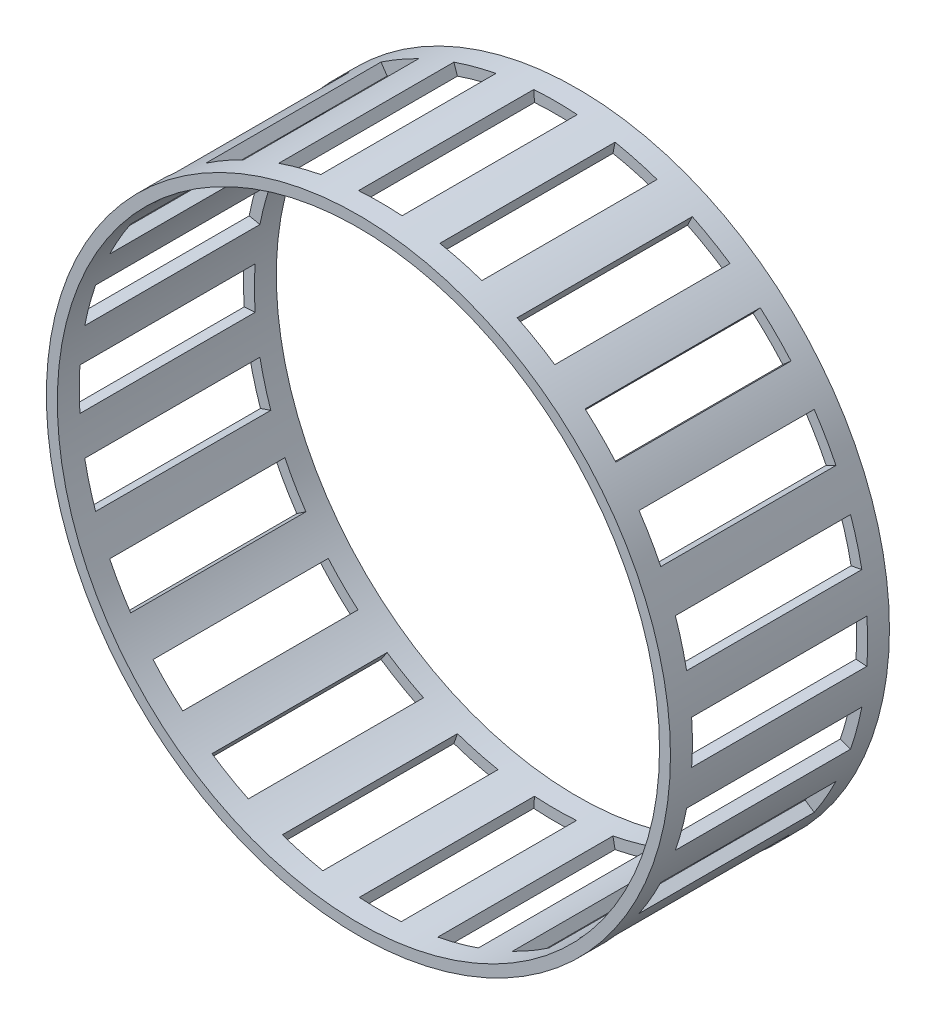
ISO-10303-21;
HEADER;
FILE_DESCRIPTION(('STEP AP214'),'2;1');
FILE_NAME('part.step','',(''),(''),'','','');
FILE_SCHEMA(('AUTOMOTIVE_DESIGN { 1 0 10303 214 1 1 1 1 }'));
ENDSEC;
DATA;
#1=APPLICATION_CONTEXT('core data for automotive mechanical design processes');
#2=APPLICATION_PROTOCOL_DEFINITION('international standard','automotive_design',2000,#1);
#3=PRODUCT_CONTEXT('',#1,'mechanical');
#4=PRODUCT('Part','Part','',(#3));
#5=PRODUCT_RELATED_PRODUCT_CATEGORY('part','',(#4));
#6=PRODUCT_DEFINITION_FORMATION('','',#4);
#7=PRODUCT_DEFINITION_CONTEXT('part definition',#1,'design');
#8=PRODUCT_DEFINITION('design','',#6,#7);
#9=PRODUCT_DEFINITION_SHAPE('','',#8);
#10=(LENGTH_UNIT() NAMED_UNIT(*) SI_UNIT(.MILLI.,.METRE.));
#11=(NAMED_UNIT(*) PLANE_ANGLE_UNIT() SI_UNIT($,.RADIAN.));
#12=(NAMED_UNIT(*) SI_UNIT($,.STERADIAN.) SOLID_ANGLE_UNIT());
#13=UNCERTAINTY_MEASURE_WITH_UNIT(LENGTH_MEASURE(1.E-05),#10,'distance_accuracy_value','');
#14=(GEOMETRIC_REPRESENTATION_CONTEXT(3) GLOBAL_UNCERTAINTY_ASSIGNED_CONTEXT((#13)) GLOBAL_UNIT_ASSIGNED_CONTEXT((#10,
#11,#12)) REPRESENTATION_CONTEXT('',''));
#15=CARTESIAN_POINT('',(0.,0.,0.));
#16=DIRECTION('',(0.,0.,1.));
#17=DIRECTION('',(1.,0.,0.));
#18=AXIS2_PLACEMENT_3D('',#15,#16,#17);
#19=CARTESIAN_POINT('',(0.,0.,5.));
#20=DIRECTION('',(0.,0.,1.));
#21=DIRECTION('',(1.,0.,0.));
#22=AXIS2_PLACEMENT_3D('',#19,#20,#21);
#23=PLANE('',#22);
#24=CARTESIAN_POINT('',(0.,0.,5.));
#25=DIRECTION('',(0.,0.,1.));
#26=DIRECTION('',(1.,0.,0.));
#27=AXIS2_PLACEMENT_3D('',#24,#25,#26);
#28=CIRCLE('',#27,14.25);
#29=CARTESIAN_POINT('',(14.25,0.,5.));
#30=VERTEX_POINT('',#29);
#31=EDGE_CURVE('E1190',#30,#30,#28,.T.);
#32=ORIENTED_EDGE('',*,*,#31,.T.);
#33=EDGE_LOOP('',(#32));
#34=FACE_BOUND('',#33,.T.);
#35=CARTESIAN_POINT('',(0.,0.,5.));
#36=DIRECTION('',(0.,0.,1.));
#37=DIRECTION('',(1.,0.,0.));
#38=AXIS2_PLACEMENT_3D('',#35,#36,#37);
#39=CIRCLE('',#38,13.75);
#40=CARTESIAN_POINT('',(13.75,0.,5.));
#41=VERTEX_POINT('',#40);
#42=EDGE_CURVE('E1196',#41,#41,#39,.T.);
#43=ORIENTED_EDGE('',*,*,#42,.F.);
#44=EDGE_LOOP('',(#43));
#45=FACE_BOUND('',#44,.T.);
#46=ADVANCED_FACE('F351',(#34,#45),#23,.T.);
#47=CARTESIAN_POINT('',(0.,0.,-5.));
#48=DIRECTION('',(0.,0.,1.));
#49=DIRECTION('',(1.,0.,0.));
#50=AXIS2_PLACEMENT_3D('',#47,#48,#49);
#51=PLANE('',#50);
#52=CARTESIAN_POINT('',(0.,0.,-5.));
#53=DIRECTION('',(0.,0.,1.));
#54=DIRECTION('',(1.,0.,0.));
#55=AXIS2_PLACEMENT_3D('',#52,#53,#54);
#56=CIRCLE('',#55,14.25);
#57=CARTESIAN_POINT('',(14.25,0.,-5.));
#58=VERTEX_POINT('',#57);
#59=EDGE_CURVE('E1193',#58,#58,#56,.T.);
#60=ORIENTED_EDGE('',*,*,#59,.F.);
#61=EDGE_LOOP('',(#60));
#62=FACE_BOUND('',#61,.T.);
#63=CARTESIAN_POINT('',(0.,0.,-5.));
#64=DIRECTION('',(0.,0.,1.));
#65=DIRECTION('',(1.,0.,0.));
#66=AXIS2_PLACEMENT_3D('',#63,#64,#65);
#67=CIRCLE('',#66,13.75);
#68=CARTESIAN_POINT('',(13.75,0.,-5.));
#69=VERTEX_POINT('',#68);
#70=EDGE_CURVE('E1199',#69,#69,#67,.T.);
#71=ORIENTED_EDGE('',*,*,#70,.T.);
#72=EDGE_LOOP('',(#71));
#73=FACE_BOUND('',#72,.T.);
#74=ADVANCED_FACE('F1761',(#62,#73),#51,.F.);
#75=CARTESIAN_POINT('',(0.,0.,5.));
#76=DIRECTION('',(0.,0.,-1.));
#77=DIRECTION('',(-1.,0.,0.));
#78=AXIS2_PLACEMENT_3D('',#75,#76,#77);
#79=CYLINDRICAL_SURFACE('',#78,14.25);
#80=CARTESIAN_POINT('',(0.,0.,-4.));
#81=DIRECTION('',(0.,0.,-1.));
#82=DIRECTION('',(-1.,0.,0.));
#83=AXIS2_PLACEMENT_3D('',#80,#81,#82);
#84=CIRCLE('',#83,14.25);
#85=CARTESIAN_POINT('',(13.9881873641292,-2.71902818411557,-4.));
#86=VERTEX_POINT('',#85);
#87=CARTESIAN_POINT('',(13.4736397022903,-4.6393462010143,-4.));
#88=VERTEX_POINT('',#87);
#89=EDGE_CURVE('E953',#86,#88,#84,.T.);
#90=ORIENTED_EDGE('',*,*,#89,.T.);
#91=DIRECTION('',(0.,0.,-1.));
#92=VECTOR('',#91,1.);
#93=CARTESIAN_POINT('',(13.4736397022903,-4.6393462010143,5.));
#94=LINE('',#93,#92);
#95=CARTESIAN_POINT('',(13.4736397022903,-4.6393462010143,4.));
#96=VERTEX_POINT('',#95);
#97=EDGE_CURVE('E1735',#88,#96,#94,.F.);
#98=ORIENTED_EDGE('',*,*,#97,.T.);
#99=CARTESIAN_POINT('',(0.,0.,4.));
#100=DIRECTION('',(0.,0.,1.));
#101=DIRECTION('',(1.,0.,0.));
#102=AXIS2_PLACEMENT_3D('',#99,#100,#101);
#103=CIRCLE('',#102,14.25);
#104=CARTESIAN_POINT('',(13.9881873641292,-2.71902818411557,4.));
#105=VERTEX_POINT('',#104);
#106=EDGE_CURVE('E1731',#96,#105,#103,.T.);
#107=ORIENTED_EDGE('',*,*,#106,.T.);
#108=DIRECTION('',(0.,0.,-1.));
#109=VECTOR('',#108,1.);
#110=CARTESIAN_POINT('',(13.9881873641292,-2.71902818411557,5.));
#111=LINE('',#110,#109);
#112=EDGE_CURVE('E1738',#86,#105,#111,.F.);
#113=ORIENTED_EDGE('',*,*,#112,.F.);
#114=EDGE_LOOP('',(#90,#98,#107,#113));
#115=FACE_BOUND('',#114,.T.);
#116=CARTESIAN_POINT('',(0.,0.,-4.));
#117=DIRECTION('',(0.,0.,-1.));
#118=DIRECTION('',(-1.,0.,0.));
#119=AXIS2_PLACEMENT_3D('',#116,#117,#118);
#120=CIRCLE('',#119,14.25);
#121=CARTESIAN_POINT('',(12.8078151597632,-6.24678884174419,-4.));
#122=VERTEX_POINT('',#121);
#123=CARTESIAN_POINT('',(11.8137854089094,-7.96849887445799,-4.));
#124=VERTEX_POINT('',#123);
#125=EDGE_CURVE('E1711',#122,#124,#120,.T.);
#126=ORIENTED_EDGE('',*,*,#125,.T.);
#127=DIRECTION('',(0.,0.,-1.));
#128=VECTOR('',#127,1.);
#129=CARTESIAN_POINT('',(11.8137854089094,-7.96849887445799,5.));
#130=LINE('',#129,#128);
#131=CARTESIAN_POINT('',(11.8137854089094,-7.96849887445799,4.));
#132=VERTEX_POINT('',#131);
#133=EDGE_CURVE('E1714',#124,#132,#130,.F.);
#134=ORIENTED_EDGE('',*,*,#133,.T.);
#135=CARTESIAN_POINT('',(0.,0.,4.));
#136=DIRECTION('',(0.,0.,1.));
#137=DIRECTION('',(1.,0.,0.));
#138=AXIS2_PLACEMENT_3D('',#135,#136,#137);
#139=CIRCLE('',#138,14.25);
#140=CARTESIAN_POINT('',(12.8078151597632,-6.24678884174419,4.));
#141=VERTEX_POINT('',#140);
#142=EDGE_CURVE('E1708',#132,#141,#139,.T.);
#143=ORIENTED_EDGE('',*,*,#142,.T.);
#144=DIRECTION('',(0.,0.,-1.));
#145=VECTOR('',#144,1.);
#146=CARTESIAN_POINT('',(12.8078151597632,-6.24678884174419,5.));
#147=LINE('',#146,#145);
#148=EDGE_CURVE('E1717',#122,#141,#147,.F.);
#149=ORIENTED_EDGE('',*,*,#148,.F.);
#150=EDGE_LOOP('',(#126,#134,#143,#149));
#151=FACE_BOUND('',#150,.T.);
#152=CARTESIAN_POINT('',(0.,0.,-4.));
#153=DIRECTION('',(0.,0.,-1.));
#154=DIRECTION('',(-1.,0.,0.));
#155=AXIS2_PLACEMENT_3D('',#152,#153,#154);
#156=CIRCLE('',#155,14.25);
#157=CARTESIAN_POINT('',(10.7546115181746,-9.34884116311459,-4.));
#158=VERTEX_POINT('',#157);
#159=CARTESIAN_POINT('',(9.34884116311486,-10.7546115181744,-4.));
#160=VERTEX_POINT('',#159);
#161=EDGE_CURVE('E1688',#158,#160,#156,.T.);
#162=ORIENTED_EDGE('',*,*,#161,.T.);
#163=DIRECTION('',(0.,0.,-1.));
#164=VECTOR('',#163,1.);
#165=CARTESIAN_POINT('',(9.34884116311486,-10.7546115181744,5.));
#166=LINE('',#165,#164);
#167=CARTESIAN_POINT('',(9.34884116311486,-10.7546115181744,4.));
#168=VERTEX_POINT('',#167);
#169=EDGE_CURVE('E1691',#160,#168,#166,.F.);
#170=ORIENTED_EDGE('',*,*,#169,.T.);
#171=CARTESIAN_POINT('',(0.,0.,4.));
#172=DIRECTION('',(0.,0.,1.));
#173=DIRECTION('',(1.,0.,0.));
#174=AXIS2_PLACEMENT_3D('',#171,#172,#173);
#175=CIRCLE('',#174,14.25);
#176=CARTESIAN_POINT('',(10.7546115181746,-9.3488411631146,4.));
#177=VERTEX_POINT('',#176);
#178=EDGE_CURVE('E1685',#168,#177,#175,.T.);
#179=ORIENTED_EDGE('',*,*,#178,.T.);
#180=DIRECTION('',(0.,0.,-1.));
#181=VECTOR('',#180,1.);
#182=CARTESIAN_POINT('',(10.7546115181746,-9.34884116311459,5.));
#183=LINE('',#182,#181);
#184=EDGE_CURVE('E1694',#158,#177,#183,.F.);
#185=ORIENTED_EDGE('',*,*,#184,.F.);
#186=EDGE_LOOP('',(#162,#170,#179,#185));
#187=FACE_BOUND('',#186,.T.);
#188=CARTESIAN_POINT('',(0.,0.,-4.));
#189=DIRECTION('',(0.,0.,-1.));
#190=DIRECTION('',(-1.,0.,0.));
#191=AXIS2_PLACEMENT_3D('',#188,#189,#190);
#192=CIRCLE('',#191,14.25);
#193=CARTESIAN_POINT('',(7.96849887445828,-11.8137854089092,-4.));
#194=VERTEX_POINT('',#193);
#195=CARTESIAN_POINT('',(6.2467888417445,-12.8078151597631,-4.));
#196=VERTEX_POINT('',#195);
#197=EDGE_CURVE('E1665',#194,#196,#192,.T.);
#198=ORIENTED_EDGE('',*,*,#197,.T.);
#199=DIRECTION('',(0.,0.,-1.));
#200=VECTOR('',#199,1.);
#201=CARTESIAN_POINT('',(6.2467888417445,-12.8078151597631,5.));
#202=LINE('',#201,#200);
#203=CARTESIAN_POINT('',(6.2467888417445,-12.8078151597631,4.));
#204=VERTEX_POINT('',#203);
#205=EDGE_CURVE('E1668',#196,#204,#202,.F.);
#206=ORIENTED_EDGE('',*,*,#205,.T.);
#207=CARTESIAN_POINT('',(0.,0.,4.));
#208=DIRECTION('',(0.,0.,1.));
#209=DIRECTION('',(1.,0.,0.));
#210=AXIS2_PLACEMENT_3D('',#207,#208,#209);
#211=CIRCLE('',#210,14.25);
#212=CARTESIAN_POINT('',(7.96849887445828,-11.8137854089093,4.));
#213=VERTEX_POINT('',#212);
#214=EDGE_CURVE('E1662',#204,#213,#211,.T.);
#215=ORIENTED_EDGE('',*,*,#214,.T.);
#216=DIRECTION('',(0.,0.,-1.));
#217=VECTOR('',#216,1.);
#218=CARTESIAN_POINT('',(7.96849887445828,-11.8137854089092,5.));
#219=LINE('',#218,#217);
#220=EDGE_CURVE('E1671',#194,#213,#219,.F.);
#221=ORIENTED_EDGE('',*,*,#220,.F.);
#222=EDGE_LOOP('',(#198,#206,#215,#221));
#223=FACE_BOUND('',#222,.T.);
#224=CARTESIAN_POINT('',(0.,0.,-4.));
#225=DIRECTION('',(0.,0.,-1.));
#226=DIRECTION('',(-1.,0.,0.));
#227=AXIS2_PLACEMENT_3D('',#224,#225,#226);
#228=CIRCLE('',#227,14.25);
#229=CARTESIAN_POINT('',(4.63934620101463,-13.4736397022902,-4.));
#230=VERTEX_POINT('',#229);
#231=CARTESIAN_POINT('',(2.71902818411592,-13.9881873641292,-4.));
#232=VERTEX_POINT('',#231);
#233=EDGE_CURVE('E1642',#230,#232,#228,.T.);
#234=ORIENTED_EDGE('',*,*,#233,.T.);
#235=DIRECTION('',(0.,0.,-1.));
#236=VECTOR('',#235,1.);
#237=CARTESIAN_POINT('',(2.71902818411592,-13.9881873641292,5.));
#238=LINE('',#237,#236);
#239=CARTESIAN_POINT('',(2.71902818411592,-13.9881873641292,4.));
#240=VERTEX_POINT('',#239);
#241=EDGE_CURVE('E1645',#232,#240,#238,.F.);
#242=ORIENTED_EDGE('',*,*,#241,.T.);
#243=CARTESIAN_POINT('',(0.,0.,4.));
#244=DIRECTION('',(0.,0.,1.));
#245=DIRECTION('',(1.,0.,0.));
#246=AXIS2_PLACEMENT_3D('',#243,#244,#245);
#247=CIRCLE('',#246,14.25);
#248=CARTESIAN_POINT('',(4.63934620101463,-13.4736397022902,4.));
#249=VERTEX_POINT('',#248);
#250=EDGE_CURVE('E1639',#240,#249,#247,.T.);
#251=ORIENTED_EDGE('',*,*,#250,.T.);
#252=DIRECTION('',(0.,0.,-1.));
#253=VECTOR('',#252,1.);
#254=CARTESIAN_POINT('',(4.63934620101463,-13.4736397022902,5.));
#255=LINE('',#254,#253);
#256=EDGE_CURVE('E1648',#230,#249,#255,.F.);
#257=ORIENTED_EDGE('',*,*,#256,.F.);
#258=EDGE_LOOP('',(#234,#242,#251,#257));
#259=FACE_BOUND('',#258,.T.);
#260=CARTESIAN_POINT('',(0.,0.,-4.));
#261=DIRECTION('',(0.,0.,-1.));
#262=DIRECTION('',(-1.,0.,0.));
#263=AXIS2_PLACEMENT_3D('',#260,#261,#262);
#264=CIRCLE('',#263,14.25);
#265=CARTESIAN_POINT('',(0.994029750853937,-14.2152877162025,-4.));
#266=VERTEX_POINT('',#265);
#267=CARTESIAN_POINT('',(-0.994029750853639,-14.2152877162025,-4.));
#268=VERTEX_POINT('',#267);
#269=EDGE_CURVE('E1619',#266,#268,#264,.T.);
#270=ORIENTED_EDGE('',*,*,#269,.T.);
#271=DIRECTION('',(0.,0.,-1.));
#272=VECTOR('',#271,1.);
#273=CARTESIAN_POINT('',(-0.994029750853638,-14.2152877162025,5.));
#274=LINE('',#273,#272);
#275=CARTESIAN_POINT('',(-0.994029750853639,-14.2152877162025,4.));
#276=VERTEX_POINT('',#275);
#277=EDGE_CURVE('E1622',#268,#276,#274,.F.);
#278=ORIENTED_EDGE('',*,*,#277,.T.);
#279=CARTESIAN_POINT('',(0.,0.,4.));
#280=DIRECTION('',(0.,0.,1.));
#281=DIRECTION('',(1.,0.,0.));
#282=AXIS2_PLACEMENT_3D('',#279,#280,#281);
#283=CIRCLE('',#282,14.25);
#284=CARTESIAN_POINT('',(0.994029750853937,-14.2152877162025,4.));
#285=VERTEX_POINT('',#284);
#286=EDGE_CURVE('E1616',#276,#285,#283,.T.);
#287=ORIENTED_EDGE('',*,*,#286,.T.);
#288=DIRECTION('',(0.,0.,-1.));
#289=VECTOR('',#288,1.);
#290=CARTESIAN_POINT('',(0.994029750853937,-14.2152877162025,5.));
#291=LINE('',#290,#289);
#292=EDGE_CURVE('E1625',#266,#285,#291,.F.);
#293=ORIENTED_EDGE('',*,*,#292,.F.);
#294=EDGE_LOOP('',(#270,#278,#287,#293));
#295=FACE_BOUND('',#294,.T.);
#296=CARTESIAN_POINT('',(0.,0.,-4.));
#297=DIRECTION('',(0.,0.,-1.));
#298=DIRECTION('',(-1.,0.,0.));
#299=AXIS2_PLACEMENT_3D('',#296,#297,#298);
#300=CIRCLE('',#299,14.25);
#301=CARTESIAN_POINT('',(-2.71902818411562,-13.9881873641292,-4.));
#302=VERTEX_POINT('',#301);
#303=CARTESIAN_POINT('',(-4.63934620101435,-13.4736397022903,-4.));
#304=VERTEX_POINT('',#303);
#305=EDGE_CURVE('E1596',#302,#304,#300,.T.);
#306=ORIENTED_EDGE('',*,*,#305,.T.);
#307=DIRECTION('',(0.,0.,-1.));
#308=VECTOR('',#307,1.);
#309=CARTESIAN_POINT('',(-4.63934620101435,-13.4736397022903,5.));
#310=LINE('',#309,#308);
#311=CARTESIAN_POINT('',(-4.63934620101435,-13.4736397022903,4.));
#312=VERTEX_POINT('',#311);
#313=EDGE_CURVE('E1599',#304,#312,#310,.F.);
#314=ORIENTED_EDGE('',*,*,#313,.T.);
#315=CARTESIAN_POINT('',(0.,0.,4.));
#316=DIRECTION('',(0.,0.,1.));
#317=DIRECTION('',(1.,0.,0.));
#318=AXIS2_PLACEMENT_3D('',#315,#316,#317);
#319=CIRCLE('',#318,14.25);
#320=CARTESIAN_POINT('',(-2.71902818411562,-13.9881873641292,4.));
#321=VERTEX_POINT('',#320);
#322=EDGE_CURVE('E1593',#312,#321,#319,.T.);
#323=ORIENTED_EDGE('',*,*,#322,.T.);
#324=DIRECTION('',(0.,0.,-1.));
#325=VECTOR('',#324,1.);
#326=CARTESIAN_POINT('',(-2.71902818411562,-13.9881873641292,5.));
#327=LINE('',#326,#325);
#328=EDGE_CURVE('E1602',#302,#321,#327,.F.);
#329=ORIENTED_EDGE('',*,*,#328,.F.);
#330=EDGE_LOOP('',(#306,#314,#323,#329));
#331=FACE_BOUND('',#330,.T.);
#332=CARTESIAN_POINT('',(0.,0.,-4.));
#333=DIRECTION('',(0.,0.,-1.));
#334=DIRECTION('',(-1.,0.,0.));
#335=AXIS2_PLACEMENT_3D('',#332,#333,#334);
#336=CIRCLE('',#335,14.25);
#337=CARTESIAN_POINT('',(-6.24678884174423,-12.8078151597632,-4.));
#338=VERTEX_POINT('',#337);
#339=CARTESIAN_POINT('',(-7.96849887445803,-11.8137854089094,-4.));
#340=VERTEX_POINT('',#339);
#341=EDGE_CURVE('E1573',#338,#340,#336,.T.);
#342=ORIENTED_EDGE('',*,*,#341,.T.);
#343=DIRECTION('',(0.,0.,-1.));
#344=VECTOR('',#343,1.);
#345=CARTESIAN_POINT('',(-7.96849887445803,-11.8137854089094,5.));
#346=LINE('',#345,#344);
#347=CARTESIAN_POINT('',(-7.96849887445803,-11.8137854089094,4.));
#348=VERTEX_POINT('',#347);
#349=EDGE_CURVE('E1576',#340,#348,#346,.F.);
#350=ORIENTED_EDGE('',*,*,#349,.T.);
#351=CARTESIAN_POINT('',(0.,0.,4.));
#352=DIRECTION('',(0.,0.,1.));
#353=DIRECTION('',(1.,0.,0.));
#354=AXIS2_PLACEMENT_3D('',#351,#352,#353);
#355=CIRCLE('',#354,14.25);
#356=CARTESIAN_POINT('',(-6.24678884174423,-12.8078151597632,4.));
#357=VERTEX_POINT('',#356);
#358=EDGE_CURVE('E1570',#348,#357,#355,.T.);
#359=ORIENTED_EDGE('',*,*,#358,.T.);
#360=DIRECTION('',(0.,0.,-1.));
#361=VECTOR('',#360,1.);
#362=CARTESIAN_POINT('',(-6.24678884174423,-12.8078151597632,5.));
#363=LINE('',#362,#361);
#364=EDGE_CURVE('E1579',#338,#357,#363,.F.);
#365=ORIENTED_EDGE('',*,*,#364,.F.);
#366=EDGE_LOOP('',(#342,#350,#359,#365));
#367=FACE_BOUND('',#366,.T.);
#368=CARTESIAN_POINT('',(0.,0.,-4.));
#369=DIRECTION('',(0.,0.,-1.));
#370=DIRECTION('',(-1.,0.,0.));
#371=AXIS2_PLACEMENT_3D('',#368,#369,#370);
#372=CIRCLE('',#371,14.25);
#373=CARTESIAN_POINT('',(-9.34884116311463,-10.7546115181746,-4.));
#374=VERTEX_POINT('',#373);
#375=CARTESIAN_POINT('',(-10.7546115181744,-9.34884116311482,-4.));
#376=VERTEX_POINT('',#375);
#377=EDGE_CURVE('E1550',#374,#376,#372,.T.);
#378=ORIENTED_EDGE('',*,*,#377,.T.);
#379=DIRECTION('',(0.,0.,-1.));
#380=VECTOR('',#379,1.);
#381=CARTESIAN_POINT('',(-10.7546115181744,-9.34884116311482,5.));
#382=LINE('',#381,#380);
#383=CARTESIAN_POINT('',(-10.7546115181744,-9.34884116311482,4.));
#384=VERTEX_POINT('',#383);
#385=EDGE_CURVE('E1553',#376,#384,#382,.F.);
#386=ORIENTED_EDGE('',*,*,#385,.T.);
#387=CARTESIAN_POINT('',(0.,0.,4.));
#388=DIRECTION('',(0.,0.,1.));
#389=DIRECTION('',(1.,0.,0.));
#390=AXIS2_PLACEMENT_3D('',#387,#388,#389);
#391=CIRCLE('',#390,14.25);
#392=CARTESIAN_POINT('',(-9.34884116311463,-10.7546115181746,4.));
#393=VERTEX_POINT('',#392);
#394=EDGE_CURVE('E1547',#384,#393,#391,.T.);
#395=ORIENTED_EDGE('',*,*,#394,.T.);
#396=DIRECTION('',(0.,0.,-1.));
#397=VECTOR('',#396,1.);
#398=CARTESIAN_POINT('',(-9.34884116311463,-10.7546115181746,5.));
#399=LINE('',#398,#397);
#400=EDGE_CURVE('E1556',#374,#393,#399,.F.);
#401=ORIENTED_EDGE('',*,*,#400,.F.);
#402=EDGE_LOOP('',(#378,#386,#395,#401));
#403=FACE_BOUND('',#402,.T.);
#404=CARTESIAN_POINT('',(0.,0.,-4.));
#405=DIRECTION('',(0.,0.,-1.));
#406=DIRECTION('',(-1.,0.,0.));
#407=AXIS2_PLACEMENT_3D('',#404,#405,#406);
#408=CIRCLE('',#407,14.25);
#409=CARTESIAN_POINT('',(-11.8137854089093,-7.96849887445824,-4.));
#410=VERTEX_POINT('',#409);
#411=CARTESIAN_POINT('',(-12.8078151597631,-6.24678884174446,-4.));
#412=VERTEX_POINT('',#411);
#413=EDGE_CURVE('E1527',#410,#412,#408,.T.);
#414=ORIENTED_EDGE('',*,*,#413,.T.);
#415=DIRECTION('',(0.,0.,-1.));
#416=VECTOR('',#415,1.);
#417=CARTESIAN_POINT('',(-12.8078151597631,-6.24678884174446,5.));
#418=LINE('',#417,#416);
#419=CARTESIAN_POINT('',(-12.8078151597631,-6.24678884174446,4.));
#420=VERTEX_POINT('',#419);
#421=EDGE_CURVE('E1530',#412,#420,#418,.F.);
#422=ORIENTED_EDGE('',*,*,#421,.T.);
#423=CARTESIAN_POINT('',(0.,0.,4.));
#424=DIRECTION('',(0.,0.,1.));
#425=DIRECTION('',(1.,0.,0.));
#426=AXIS2_PLACEMENT_3D('',#423,#424,#425);
#427=CIRCLE('',#426,14.25);
#428=CARTESIAN_POINT('',(-11.8137854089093,-7.96849887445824,4.));
#429=VERTEX_POINT('',#428);
#430=EDGE_CURVE('E1524',#420,#429,#427,.T.);
#431=ORIENTED_EDGE('',*,*,#430,.T.);
#432=DIRECTION('',(0.,0.,-1.));
#433=VECTOR('',#432,1.);
#434=CARTESIAN_POINT('',(-11.8137854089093,-7.96849887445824,5.));
#435=LINE('',#434,#433);
#436=EDGE_CURVE('E1533',#410,#429,#435,.F.);
#437=ORIENTED_EDGE('',*,*,#436,.F.);
#438=EDGE_LOOP('',(#414,#422,#431,#437));
#439=FACE_BOUND('',#438,.T.);
#440=CARTESIAN_POINT('',(0.,0.,-4.));
#441=DIRECTION('',(0.,0.,-1.));
#442=DIRECTION('',(-1.,0.,0.));
#443=AXIS2_PLACEMENT_3D('',#440,#441,#442);
#444=CIRCLE('',#443,14.25);
#445=CARTESIAN_POINT('',(-13.4736397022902,-4.63934620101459,-4.));
#446=VERTEX_POINT('',#445);
#447=CARTESIAN_POINT('',(-13.9881873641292,-2.71902818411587,-4.));
#448=VERTEX_POINT('',#447);
#449=EDGE_CURVE('E1504',#446,#448,#444,.T.);
#450=ORIENTED_EDGE('',*,*,#449,.T.);
#451=DIRECTION('',(0.,0.,-1.));
#452=VECTOR('',#451,1.);
#453=CARTESIAN_POINT('',(-13.9881873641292,-2.71902818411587,5.));
#454=LINE('',#453,#452);
#455=CARTESIAN_POINT('',(-13.9881873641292,-2.71902818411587,4.));
#456=VERTEX_POINT('',#455);
#457=EDGE_CURVE('E1507',#448,#456,#454,.F.);
#458=ORIENTED_EDGE('',*,*,#457,.T.);
#459=CARTESIAN_POINT('',(0.,0.,4.));
#460=DIRECTION('',(0.,0.,1.));
#461=DIRECTION('',(1.,0.,0.));
#462=AXIS2_PLACEMENT_3D('',#459,#460,#461);
#463=CIRCLE('',#462,14.25);
#464=CARTESIAN_POINT('',(-13.4736397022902,-4.63934620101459,4.));
#465=VERTEX_POINT('',#464);
#466=EDGE_CURVE('E1501',#456,#465,#463,.T.);
#467=ORIENTED_EDGE('',*,*,#466,.T.);
#468=DIRECTION('',(0.,0.,-1.));
#469=VECTOR('',#468,1.);
#470=CARTESIAN_POINT('',(-13.4736397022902,-4.63934620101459,5.));
#471=LINE('',#470,#469);
#472=EDGE_CURVE('E1510',#446,#465,#471,.F.);
#473=ORIENTED_EDGE('',*,*,#472,.F.);
#474=EDGE_LOOP('',(#450,#458,#467,#473));
#475=FACE_BOUND('',#474,.T.);
#476=CARTESIAN_POINT('',(0.,0.,-4.));
#477=DIRECTION('',(0.,0.,-1.));
#478=DIRECTION('',(-1.,0.,0.));
#479=AXIS2_PLACEMENT_3D('',#476,#477,#478);
#480=CIRCLE('',#479,14.25);
#481=CARTESIAN_POINT('',(-14.2152877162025,-0.994029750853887,-4.));
#482=VERTEX_POINT('',#481);
#483=CARTESIAN_POINT('',(-14.2152877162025,0.994029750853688,-4.));
#484=VERTEX_POINT('',#483);
#485=EDGE_CURVE('E1481',#482,#484,#480,.T.);
#486=ORIENTED_EDGE('',*,*,#485,.T.);
#487=DIRECTION('',(0.,0.,-1.));
#488=VECTOR('',#487,1.);
#489=CARTESIAN_POINT('',(-14.2152877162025,0.994029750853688,5.));
#490=LINE('',#489,#488);
#491=CARTESIAN_POINT('',(-14.2152877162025,0.994029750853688,4.));
#492=VERTEX_POINT('',#491);
#493=EDGE_CURVE('E1484',#484,#492,#490,.F.);
#494=ORIENTED_EDGE('',*,*,#493,.T.);
#495=CARTESIAN_POINT('',(0.,0.,4.));
#496=DIRECTION('',(0.,0.,1.));
#497=DIRECTION('',(1.,0.,0.));
#498=AXIS2_PLACEMENT_3D('',#495,#496,#497);
#499=CIRCLE('',#498,14.25);
#500=CARTESIAN_POINT('',(-14.2152877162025,-0.994029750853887,4.));
#501=VERTEX_POINT('',#500);
#502=EDGE_CURVE('E1478',#492,#501,#499,.T.);
#503=ORIENTED_EDGE('',*,*,#502,.T.);
#504=DIRECTION('',(0.,0.,-1.));
#505=VECTOR('',#504,1.);
#506=CARTESIAN_POINT('',(-14.2152877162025,-0.994029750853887,5.));
#507=LINE('',#506,#505);
#508=EDGE_CURVE('E1487',#482,#501,#507,.F.);
#509=ORIENTED_EDGE('',*,*,#508,.F.);
#510=EDGE_LOOP('',(#486,#494,#503,#509));
#511=FACE_BOUND('',#510,.T.);
#512=CARTESIAN_POINT('',(0.,0.,-4.));
#513=DIRECTION('',(0.,0.,-1.));
#514=DIRECTION('',(-1.,0.,0.));
#515=AXIS2_PLACEMENT_3D('',#512,#513,#514);
#516=CIRCLE('',#515,14.25);
#517=CARTESIAN_POINT('',(-13.9881873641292,2.71902818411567,-4.));
#518=VERTEX_POINT('',#517);
#519=CARTESIAN_POINT('',(-13.4736397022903,4.6393462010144,-4.));
#520=VERTEX_POINT('',#519);
#521=EDGE_CURVE('E1458',#518,#520,#516,.T.);
#522=ORIENTED_EDGE('',*,*,#521,.T.);
#523=DIRECTION('',(0.,0.,-1.));
#524=VECTOR('',#523,1.);
#525=CARTESIAN_POINT('',(-13.4736397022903,4.6393462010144,5.));
#526=LINE('',#525,#524);
#527=CARTESIAN_POINT('',(-13.4736397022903,4.6393462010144,4.));
#528=VERTEX_POINT('',#527);
#529=EDGE_CURVE('E1461',#520,#528,#526,.F.);
#530=ORIENTED_EDGE('',*,*,#529,.T.);
#531=CARTESIAN_POINT('',(0.,0.,4.));
#532=DIRECTION('',(0.,0.,1.));
#533=DIRECTION('',(1.,0.,0.));
#534=AXIS2_PLACEMENT_3D('',#531,#532,#533);
#535=CIRCLE('',#534,14.25);
#536=CARTESIAN_POINT('',(-13.9881873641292,2.71902818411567,4.));
#537=VERTEX_POINT('',#536);
#538=EDGE_CURVE('E1455',#528,#537,#535,.T.);
#539=ORIENTED_EDGE('',*,*,#538,.T.);
#540=DIRECTION('',(0.,0.,-1.));
#541=VECTOR('',#540,1.);
#542=CARTESIAN_POINT('',(-13.9881873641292,2.71902818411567,5.));
#543=LINE('',#542,#541);
#544=EDGE_CURVE('E1464',#518,#537,#543,.F.);
#545=ORIENTED_EDGE('',*,*,#544,.F.);
#546=EDGE_LOOP('',(#522,#530,#539,#545));
#547=FACE_BOUND('',#546,.T.);
#548=CARTESIAN_POINT('',(0.,0.,-4.));
#549=DIRECTION('',(0.,0.,-1.));
#550=DIRECTION('',(-1.,0.,0.));
#551=AXIS2_PLACEMENT_3D('',#548,#549,#550);
#552=CIRCLE('',#551,14.25);
#553=CARTESIAN_POINT('',(-12.8078151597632,6.24678884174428,-4.));
#554=VERTEX_POINT('',#553);
#555=CARTESIAN_POINT('',(-11.8137854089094,7.96849887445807,-4.));
#556=VERTEX_POINT('',#555);
#557=EDGE_CURVE('E1435',#554,#556,#552,.T.);
#558=ORIENTED_EDGE('',*,*,#557,.T.);
#559=DIRECTION('',(0.,0.,-1.));
#560=VECTOR('',#559,1.);
#561=CARTESIAN_POINT('',(-11.8137854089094,7.96849887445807,5.));
#562=LINE('',#561,#560);
#563=CARTESIAN_POINT('',(-11.8137854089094,7.96849887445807,4.));
#564=VERTEX_POINT('',#563);
#565=EDGE_CURVE('E1438',#556,#564,#562,.F.);
#566=ORIENTED_EDGE('',*,*,#565,.T.);
#567=CARTESIAN_POINT('',(0.,0.,4.));
#568=DIRECTION('',(0.,0.,1.));
#569=DIRECTION('',(1.,0.,0.));
#570=AXIS2_PLACEMENT_3D('',#567,#568,#569);
#571=CIRCLE('',#570,14.25);
#572=CARTESIAN_POINT('',(-12.8078151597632,6.24678884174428,4.));
#573=VERTEX_POINT('',#572);
#574=EDGE_CURVE('E1432',#564,#573,#571,.T.);
#575=ORIENTED_EDGE('',*,*,#574,.T.);
#576=DIRECTION('',(0.,0.,-1.));
#577=VECTOR('',#576,1.);
#578=CARTESIAN_POINT('',(-12.8078151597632,6.24678884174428,5.));
#579=LINE('',#578,#577);
#580=EDGE_CURVE('E1441',#554,#573,#579,.F.);
#581=ORIENTED_EDGE('',*,*,#580,.F.);
#582=EDGE_LOOP('',(#558,#566,#575,#581));
#583=FACE_BOUND('',#582,.T.);
#584=CARTESIAN_POINT('',(0.,0.,-4.));
#585=DIRECTION('',(0.,0.,-1.));
#586=DIRECTION('',(-1.,0.,0.));
#587=AXIS2_PLACEMENT_3D('',#584,#585,#586);
#588=CIRCLE('',#587,14.25);
#589=CARTESIAN_POINT('',(-10.7546115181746,9.34884116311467,-4.));
#590=VERTEX_POINT('',#589);
#591=CARTESIAN_POINT('',(-9.34884116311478,10.7546115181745,-4.));
#592=VERTEX_POINT('',#591);
#593=EDGE_CURVE('E1412',#590,#592,#588,.T.);
#594=ORIENTED_EDGE('',*,*,#593,.T.);
#595=DIRECTION('',(0.,0.,-1.));
#596=VECTOR('',#595,1.);
#597=CARTESIAN_POINT('',(-9.34884116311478,10.7546115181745,5.));
#598=LINE('',#597,#596);
#599=CARTESIAN_POINT('',(-9.34884116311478,10.7546115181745,4.));
#600=VERTEX_POINT('',#599);
#601=EDGE_CURVE('E1415',#592,#600,#598,.F.);
#602=ORIENTED_EDGE('',*,*,#601,.T.);
#603=CARTESIAN_POINT('',(0.,0.,4.));
#604=DIRECTION('',(0.,0.,1.));
#605=DIRECTION('',(1.,0.,0.));
#606=AXIS2_PLACEMENT_3D('',#603,#604,#605);
#607=CIRCLE('',#606,14.25);
#608=CARTESIAN_POINT('',(-10.7546115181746,9.34884116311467,4.));
#609=VERTEX_POINT('',#608);
#610=EDGE_CURVE('E1409',#600,#609,#607,.T.);
#611=ORIENTED_EDGE('',*,*,#610,.T.);
#612=DIRECTION('',(0.,0.,-1.));
#613=VECTOR('',#612,1.);
#614=CARTESIAN_POINT('',(-10.7546115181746,9.34884116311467,5.));
#615=LINE('',#614,#613);
#616=EDGE_CURVE('E1418',#590,#609,#615,.F.);
#617=ORIENTED_EDGE('',*,*,#616,.F.);
#618=EDGE_LOOP('',(#594,#602,#611,#617));
#619=FACE_BOUND('',#618,.T.);
#620=CARTESIAN_POINT('',(0.,0.,-4.));
#621=DIRECTION('',(0.,0.,-1.));
#622=DIRECTION('',(-1.,0.,0.));
#623=AXIS2_PLACEMENT_3D('',#620,#621,#622);
#624=CIRCLE('',#623,14.25);
#625=CARTESIAN_POINT('',(-7.9684988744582,11.8137854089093,-4.));
#626=VERTEX_POINT('',#625);
#627=CARTESIAN_POINT('',(-6.24678884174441,12.8078151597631,-4.));
#628=VERTEX_POINT('',#627);
#629=EDGE_CURVE('E1389',#626,#628,#624,.T.);
#630=ORIENTED_EDGE('',*,*,#629,.T.);
#631=DIRECTION('',(0.,0.,-1.));
#632=VECTOR('',#631,1.);
#633=CARTESIAN_POINT('',(-6.24678884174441,12.8078151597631,5.));
#634=LINE('',#633,#632);
#635=CARTESIAN_POINT('',(-6.24678884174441,12.8078151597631,4.));
#636=VERTEX_POINT('',#635);
#637=EDGE_CURVE('E1392',#628,#636,#634,.F.);
#638=ORIENTED_EDGE('',*,*,#637,.T.);
#639=CARTESIAN_POINT('',(0.,0.,4.));
#640=DIRECTION('',(0.,0.,1.));
#641=DIRECTION('',(1.,0.,0.));
#642=AXIS2_PLACEMENT_3D('',#639,#640,#641);
#643=CIRCLE('',#642,14.25);
#644=CARTESIAN_POINT('',(-7.9684988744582,11.8137854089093,4.));
#645=VERTEX_POINT('',#644);
#646=EDGE_CURVE('E1386',#636,#645,#643,.T.);
#647=ORIENTED_EDGE('',*,*,#646,.T.);
#648=DIRECTION('',(0.,0.,-1.));
#649=VECTOR('',#648,1.);
#650=CARTESIAN_POINT('',(-7.9684988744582,11.8137854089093,5.));
#651=LINE('',#650,#649);
#652=EDGE_CURVE('E1395',#626,#645,#651,.F.);
#653=ORIENTED_EDGE('',*,*,#652,.F.);
#654=EDGE_LOOP('',(#630,#638,#647,#653));
#655=FACE_BOUND('',#654,.T.);
#656=CARTESIAN_POINT('',(0.,0.,-4.));
#657=DIRECTION('',(0.,0.,-1.));
#658=DIRECTION('',(-1.,0.,0.));
#659=AXIS2_PLACEMENT_3D('',#656,#657,#658);
#660=CIRCLE('',#659,14.25);
#661=CARTESIAN_POINT('',(-4.63934620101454,13.4736397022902,-4.));
#662=VERTEX_POINT('',#661);
#663=CARTESIAN_POINT('',(-2.71902818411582,13.9881873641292,-4.));
#664=VERTEX_POINT('',#663);
#665=EDGE_CURVE('E1366',#662,#664,#660,.T.);
#666=ORIENTED_EDGE('',*,*,#665,.T.);
#667=DIRECTION('',(0.,0.,-1.));
#668=VECTOR('',#667,1.);
#669=CARTESIAN_POINT('',(-2.71902818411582,13.9881873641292,5.));
#670=LINE('',#669,#668);
#671=CARTESIAN_POINT('',(-2.71902818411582,13.9881873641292,4.));
#672=VERTEX_POINT('',#671);
#673=EDGE_CURVE('E1369',#664,#672,#670,.F.);
#674=ORIENTED_EDGE('',*,*,#673,.T.);
#675=CARTESIAN_POINT('',(0.,0.,4.));
#676=DIRECTION('',(0.,0.,1.));
#677=DIRECTION('',(1.,0.,0.));
#678=AXIS2_PLACEMENT_3D('',#675,#676,#677);
#679=CIRCLE('',#678,14.25);
#680=CARTESIAN_POINT('',(-4.63934620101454,13.4736397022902,4.));
#681=VERTEX_POINT('',#680);
#682=EDGE_CURVE('E1363',#672,#681,#679,.T.);
#683=ORIENTED_EDGE('',*,*,#682,.T.);
#684=DIRECTION('',(0.,0.,-1.));
#685=VECTOR('',#684,1.);
#686=CARTESIAN_POINT('',(-4.63934620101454,13.4736397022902,5.));
#687=LINE('',#686,#685);
#688=EDGE_CURVE('E1372',#662,#681,#687,.F.);
#689=ORIENTED_EDGE('',*,*,#688,.F.);
#690=EDGE_LOOP('',(#666,#674,#683,#689));
#691=FACE_BOUND('',#690,.T.);
#692=CARTESIAN_POINT('',(0.,0.,-4.));
#693=DIRECTION('',(0.,0.,-1.));
#694=DIRECTION('',(-1.,0.,0.));
#695=AXIS2_PLACEMENT_3D('',#692,#693,#694);
#696=CIRCLE('',#695,14.25);
#697=CARTESIAN_POINT('',(-0.994029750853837,14.2152877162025,-4.));
#698=VERTEX_POINT('',#697);
#699=CARTESIAN_POINT('',(0.994029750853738,14.2152877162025,-4.));
#700=VERTEX_POINT('',#699);
#701=EDGE_CURVE('E1343',#698,#700,#696,.T.);
#702=ORIENTED_EDGE('',*,*,#701,.T.);
#703=DIRECTION('',(0.,0.,-1.));
#704=VECTOR('',#703,1.);
#705=CARTESIAN_POINT('',(0.994029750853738,14.2152877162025,5.));
#706=LINE('',#705,#704);
#707=CARTESIAN_POINT('',(0.994029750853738,14.2152877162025,4.));
#708=VERTEX_POINT('',#707);
#709=EDGE_CURVE('E1346',#700,#708,#706,.F.);
#710=ORIENTED_EDGE('',*,*,#709,.T.);
#711=CARTESIAN_POINT('',(0.,0.,4.));
#712=DIRECTION('',(0.,0.,1.));
#713=DIRECTION('',(1.,0.,0.));
#714=AXIS2_PLACEMENT_3D('',#711,#712,#713);
#715=CIRCLE('',#714,14.25);
#716=CARTESIAN_POINT('',(-0.994029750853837,14.2152877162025,4.));
#717=VERTEX_POINT('',#716);
#718=EDGE_CURVE('E1340',#708,#717,#715,.T.);
#719=ORIENTED_EDGE('',*,*,#718,.T.);
#720=DIRECTION('',(0.,0.,-1.));
#721=VECTOR('',#720,1.);
#722=CARTESIAN_POINT('',(-0.994029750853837,14.2152877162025,5.));
#723=LINE('',#722,#721);
#724=EDGE_CURVE('E1349',#698,#717,#723,.F.);
#725=ORIENTED_EDGE('',*,*,#724,.F.);
#726=EDGE_LOOP('',(#702,#710,#719,#725));
#727=FACE_BOUND('',#726,.T.);
#728=CARTESIAN_POINT('',(0.,0.,-4.));
#729=DIRECTION('',(0.,0.,-1.));
#730=DIRECTION('',(-1.,0.,0.));
#731=AXIS2_PLACEMENT_3D('',#728,#729,#730);
#732=CIRCLE('',#731,14.25);
#733=CARTESIAN_POINT('',(2.71902818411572,13.9881873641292,-4.));
#734=VERTEX_POINT('',#733);
#735=CARTESIAN_POINT('',(4.63934620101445,13.4736397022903,-4.));
#736=VERTEX_POINT('',#735);
#737=EDGE_CURVE('E1320',#734,#736,#732,.T.);
#738=ORIENTED_EDGE('',*,*,#737,.T.);
#739=DIRECTION('',(0.,0.,-1.));
#740=VECTOR('',#739,1.);
#741=CARTESIAN_POINT('',(4.63934620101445,13.4736397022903,5.));
#742=LINE('',#741,#740);
#743=CARTESIAN_POINT('',(4.63934620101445,13.4736397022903,4.));
#744=VERTEX_POINT('',#743);
#745=EDGE_CURVE('E1323',#736,#744,#742,.F.);
#746=ORIENTED_EDGE('',*,*,#745,.T.);
#747=CARTESIAN_POINT('',(0.,0.,4.));
#748=DIRECTION('',(0.,0.,1.));
#749=DIRECTION('',(1.,0.,0.));
#750=AXIS2_PLACEMENT_3D('',#747,#748,#749);
#751=CIRCLE('',#750,14.25);
#752=CARTESIAN_POINT('',(2.71902818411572,13.9881873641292,4.));
#753=VERTEX_POINT('',#752);
#754=EDGE_CURVE('E1317',#744,#753,#751,.T.);
#755=ORIENTED_EDGE('',*,*,#754,.T.);
#756=DIRECTION('',(0.,0.,-1.));
#757=VECTOR('',#756,1.);
#758=CARTESIAN_POINT('',(2.71902818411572,13.9881873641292,5.));
#759=LINE('',#758,#757);
#760=EDGE_CURVE('E1326',#734,#753,#759,.F.);
#761=ORIENTED_EDGE('',*,*,#760,.F.);
#762=EDGE_LOOP('',(#738,#746,#755,#761));
#763=FACE_BOUND('',#762,.T.);
#764=CARTESIAN_POINT('',(0.,0.,-4.));
#765=DIRECTION('',(0.,0.,-1.));
#766=DIRECTION('',(-1.,0.,0.));
#767=AXIS2_PLACEMENT_3D('',#764,#765,#766);
#768=CIRCLE('',#767,14.25);
#769=CARTESIAN_POINT('',(6.24678884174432,12.8078151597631,-4.));
#770=VERTEX_POINT('',#769);
#771=CARTESIAN_POINT('',(7.96849887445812,11.8137854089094,-4.));
#772=VERTEX_POINT('',#771);
#773=EDGE_CURVE('E1297',#770,#772,#768,.T.);
#774=ORIENTED_EDGE('',*,*,#773,.T.);
#775=DIRECTION('',(0.,0.,-1.));
#776=VECTOR('',#775,1.);
#777=CARTESIAN_POINT('',(7.96849887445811,11.8137854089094,5.));
#778=LINE('',#777,#776);
#779=CARTESIAN_POINT('',(7.96849887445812,11.8137854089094,4.));
#780=VERTEX_POINT('',#779);
#781=EDGE_CURVE('E1300',#772,#780,#778,.F.);
#782=ORIENTED_EDGE('',*,*,#781,.T.);
#783=CARTESIAN_POINT('',(0.,0.,4.));
#784=DIRECTION('',(0.,0.,1.));
#785=DIRECTION('',(1.,0.,0.));
#786=AXIS2_PLACEMENT_3D('',#783,#784,#785);
#787=CIRCLE('',#786,14.25);
#788=CARTESIAN_POINT('',(6.24678884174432,12.8078151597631,4.));
#789=VERTEX_POINT('',#788);
#790=EDGE_CURVE('E1294',#780,#789,#787,.T.);
#791=ORIENTED_EDGE('',*,*,#790,.T.);
#792=DIRECTION('',(0.,0.,-1.));
#793=VECTOR('',#792,1.);
#794=CARTESIAN_POINT('',(6.24678884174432,12.8078151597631,5.));
#795=LINE('',#794,#793);
#796=EDGE_CURVE('E1303',#770,#789,#795,.F.);
#797=ORIENTED_EDGE('',*,*,#796,.F.);
#798=EDGE_LOOP('',(#774,#782,#791,#797));
#799=FACE_BOUND('',#798,.T.);
#800=CARTESIAN_POINT('',(0.,0.,-4.));
#801=DIRECTION('',(0.,0.,-1.));
#802=DIRECTION('',(-1.,0.,0.));
#803=AXIS2_PLACEMENT_3D('',#800,#801,#802);
#804=CIRCLE('',#803,14.25);
#805=CARTESIAN_POINT('',(9.34884116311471,10.7546115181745,-4.));
#806=VERTEX_POINT('',#805);
#807=CARTESIAN_POINT('',(10.7546115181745,9.34884116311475,-4.));
#808=VERTEX_POINT('',#807);
#809=EDGE_CURVE('E1274',#806,#808,#804,.T.);
#810=ORIENTED_EDGE('',*,*,#809,.T.);
#811=DIRECTION('',(0.,0.,-1.));
#812=VECTOR('',#811,1.);
#813=CARTESIAN_POINT('',(10.7546115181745,9.34884116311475,5.));
#814=LINE('',#813,#812);
#815=CARTESIAN_POINT('',(10.7546115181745,9.34884116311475,4.));
#816=VERTEX_POINT('',#815);
#817=EDGE_CURVE('E1277',#808,#816,#814,.F.);
#818=ORIENTED_EDGE('',*,*,#817,.T.);
#819=CARTESIAN_POINT('',(0.,0.,4.));
#820=DIRECTION('',(0.,0.,1.));
#821=DIRECTION('',(1.,0.,0.));
#822=AXIS2_PLACEMENT_3D('',#819,#820,#821);
#823=CIRCLE('',#822,14.25);
#824=CARTESIAN_POINT('',(9.34884116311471,10.7546115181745,4.));
#825=VERTEX_POINT('',#824);
#826=EDGE_CURVE('E1271',#816,#825,#823,.T.);
#827=ORIENTED_EDGE('',*,*,#826,.T.);
#828=DIRECTION('',(0.,0.,-1.));
#829=VECTOR('',#828,1.);
#830=CARTESIAN_POINT('',(9.34884116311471,10.7546115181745,5.));
#831=LINE('',#830,#829);
#832=EDGE_CURVE('E1280',#806,#825,#831,.F.);
#833=ORIENTED_EDGE('',*,*,#832,.F.);
#834=EDGE_LOOP('',(#810,#818,#827,#833));
#835=FACE_BOUND('',#834,.T.);
#836=CARTESIAN_POINT('',(0.,0.,-4.));
#837=DIRECTION('',(0.,0.,-1.));
#838=DIRECTION('',(-1.,0.,0.));
#839=AXIS2_PLACEMENT_3D('',#836,#837,#838);
#840=CIRCLE('',#839,14.25);
#841=CARTESIAN_POINT('',(11.8137854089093,7.96849887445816,-4.));
#842=VERTEX_POINT('',#841);
#843=CARTESIAN_POINT('',(12.8078151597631,6.24678884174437,-4.));
#844=VERTEX_POINT('',#843);
#845=EDGE_CURVE('E1251',#842,#844,#840,.T.);
#846=ORIENTED_EDGE('',*,*,#845,.T.);
#847=DIRECTION('',(0.,0.,-1.));
#848=VECTOR('',#847,1.);
#849=CARTESIAN_POINT('',(12.8078151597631,6.24678884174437,5.));
#850=LINE('',#849,#848);
#851=CARTESIAN_POINT('',(12.8078151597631,6.24678884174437,4.));
#852=VERTEX_POINT('',#851);
#853=EDGE_CURVE('E1254',#844,#852,#850,.F.);
#854=ORIENTED_EDGE('',*,*,#853,.T.);
#855=CARTESIAN_POINT('',(0.,0.,4.));
#856=DIRECTION('',(0.,0.,1.));
#857=DIRECTION('',(1.,0.,0.));
#858=AXIS2_PLACEMENT_3D('',#855,#856,#857);
#859=CIRCLE('',#858,14.25);
#860=CARTESIAN_POINT('',(11.8137854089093,7.96849887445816,4.));
#861=VERTEX_POINT('',#860);
#862=EDGE_CURVE('E1248',#852,#861,#859,.T.);
#863=ORIENTED_EDGE('',*,*,#862,.T.);
#864=DIRECTION('',(0.,0.,-1.));
#865=VECTOR('',#864,1.);
#866=CARTESIAN_POINT('',(11.8137854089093,7.96849887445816,5.));
#867=LINE('',#866,#865);
#868=EDGE_CURVE('E1257',#842,#861,#867,.F.);
#869=ORIENTED_EDGE('',*,*,#868,.F.);
#870=EDGE_LOOP('',(#846,#854,#863,#869));
#871=FACE_BOUND('',#870,.T.);
#872=CARTESIAN_POINT('',(0.,0.,-4.));
#873=DIRECTION('',(0.,0.,-1.));
#874=DIRECTION('',(-1.,0.,0.));
#875=AXIS2_PLACEMENT_3D('',#872,#873,#874);
#876=CIRCLE('',#875,14.25);
#877=CARTESIAN_POINT('',(13.4736397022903,4.63934620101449,-4.));
#878=VERTEX_POINT('',#877);
#879=CARTESIAN_POINT('',(13.9881873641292,2.71902818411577,-4.));
#880=VERTEX_POINT('',#879);
#881=EDGE_CURVE('E1228',#878,#880,#876,.T.);
#882=ORIENTED_EDGE('',*,*,#881,.T.);
#883=DIRECTION('',(0.,0.,-1.));
#884=VECTOR('',#883,1.);
#885=CARTESIAN_POINT('',(13.9881873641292,2.71902818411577,5.));
#886=LINE('',#885,#884);
#887=CARTESIAN_POINT('',(13.9881873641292,2.71902818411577,4.));
#888=VERTEX_POINT('',#887);
#889=EDGE_CURVE('E1231',#880,#888,#886,.F.);
#890=ORIENTED_EDGE('',*,*,#889,.T.);
#891=CARTESIAN_POINT('',(0.,0.,4.));
#892=DIRECTION('',(0.,0.,1.));
#893=DIRECTION('',(1.,0.,0.));
#894=AXIS2_PLACEMENT_3D('',#891,#892,#893);
#895=CIRCLE('',#894,14.25);
#896=CARTESIAN_POINT('',(13.4736397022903,4.63934620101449,4.));
#897=VERTEX_POINT('',#896);
#898=EDGE_CURVE('E1225',#888,#897,#895,.T.);
#899=ORIENTED_EDGE('',*,*,#898,.T.);
#900=DIRECTION('',(0.,0.,-1.));
#901=VECTOR('',#900,1.);
#902=CARTESIAN_POINT('',(13.4736397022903,4.63934620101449,5.));
#903=LINE('',#902,#901);
#904=EDGE_CURVE('E1234',#878,#897,#903,.F.);
#905=ORIENTED_EDGE('',*,*,#904,.F.);
#906=EDGE_LOOP('',(#882,#890,#899,#905));
#907=FACE_BOUND('',#906,.T.);
#908=CARTESIAN_POINT('',(0.,0.,-4.));
#909=DIRECTION('',(0.,0.,-1.));
#910=DIRECTION('',(-1.,0.,0.));
#911=AXIS2_PLACEMENT_3D('',#908,#909,#910);
#912=CIRCLE('',#911,14.25);
#913=CARTESIAN_POINT('',(14.2152877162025,0.994029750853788,-4.));
#914=VERTEX_POINT('',#913);
#915=CARTESIAN_POINT('',(14.2152877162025,-0.994029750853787,-4.));
#916=VERTEX_POINT('',#915);
#917=EDGE_CURVE('E1205',#914,#916,#912,.T.);
#918=ORIENTED_EDGE('',*,*,#917,.T.);
#919=DIRECTION('',(0.,0.,-1.));
#920=VECTOR('',#919,1.);
#921=CARTESIAN_POINT('',(14.2152877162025,-0.994029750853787,5.));
#922=LINE('',#921,#920);
#923=CARTESIAN_POINT('',(14.2152877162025,-0.994029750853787,4.));
#924=VERTEX_POINT('',#923);
#925=EDGE_CURVE('E1208',#916,#924,#922,.F.);
#926=ORIENTED_EDGE('',*,*,#925,.T.);
#927=CARTESIAN_POINT('',(0.,0.,4.));
#928=DIRECTION('',(0.,0.,1.));
#929=DIRECTION('',(1.,0.,0.));
#930=AXIS2_PLACEMENT_3D('',#927,#928,#929);
#931=CIRCLE('',#930,14.25);
#932=CARTESIAN_POINT('',(14.2152877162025,0.994029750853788,4.));
#933=VERTEX_POINT('',#932);
#934=EDGE_CURVE('E1202',#924,#933,#931,.T.);
#935=ORIENTED_EDGE('',*,*,#934,.T.);
#936=DIRECTION('',(0.,0.,-1.));
#937=VECTOR('',#936,1.);
#938=CARTESIAN_POINT('',(14.2152877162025,0.994029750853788,5.));
#939=LINE('',#938,#937);
#940=EDGE_CURVE('E1211',#914,#933,#939,.F.);
#941=ORIENTED_EDGE('',*,*,#940,.F.);
#942=EDGE_LOOP('',(#918,#926,#935,#941));
#943=FACE_BOUND('',#942,.T.);
#944=ORIENTED_EDGE('',*,*,#31,.F.);
#945=EDGE_LOOP('',(#944));
#946=FACE_BOUND('',#945,.T.);
#947=ORIENTED_EDGE('',*,*,#59,.T.);
#948=EDGE_LOOP('',(#947));
#949=FACE_BOUND('',#948,.T.);
#950=ADVANCED_FACE('F353',(#115,#151,#187,#223,#259,#295,#331,#367,#403,#439,#475,#511,#547,
#583,#619,#655,#691,#727,#763,#799,#835,#871,#907,#943,#946,#949),#79,.T.);
#951=CARTESIAN_POINT('',(0.,0.,5.));
#952=DIRECTION('',(0.,0.,-1.));
#953=DIRECTION('',(-1.,0.,0.));
#954=AXIS2_PLACEMENT_3D('',#951,#952,#953);
#955=CYLINDRICAL_SURFACE('',#954,13.75);
#956=DIRECTION('',(0.,0.,-1.));
#957=VECTOR('',#956,1.);
#958=CARTESIAN_POINT('',(13.0008804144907,-4.47656212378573,5.));
#959=LINE('',#958,#957);
#960=CARTESIAN_POINT('',(13.0008804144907,-4.47656212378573,-4.));
#961=VERTEX_POINT('',#960);
#962=CARTESIAN_POINT('',(13.0008804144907,-4.47656212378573,4.));
#963=VERTEX_POINT('',#962);
#964=EDGE_CURVE('E11',#961,#963,#959,.F.);
#965=ORIENTED_EDGE('',*,*,#964,.F.);
#966=CARTESIAN_POINT('',(0.,0.,-4.));
#967=DIRECTION('',(0.,0.,-1.));
#968=DIRECTION('',(-1.,0.,0.));
#969=AXIS2_PLACEMENT_3D('',#966,#967,#968);
#970=CIRCLE('',#969,13.75);
#971=CARTESIAN_POINT('',(13.4973737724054,-2.62362368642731,-4.));
#972=VERTEX_POINT('',#971);
#973=EDGE_CURVE('E945',#972,#961,#970,.T.);
#974=ORIENTED_EDGE('',*,*,#973,.F.);
#975=DIRECTION('',(0.,0.,-1.));
#976=VECTOR('',#975,1.);
#977=CARTESIAN_POINT('',(13.4973737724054,-2.62362368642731,5.));
#978=LINE('',#977,#976);
#979=CARTESIAN_POINT('',(13.4973737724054,-2.62362368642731,4.));
#980=VERTEX_POINT('',#979);
#981=EDGE_CURVE('E940',#972,#980,#978,.F.);
#982=ORIENTED_EDGE('',*,*,#981,.T.);
#983=CARTESIAN_POINT('',(0.,0.,4.));
#984=DIRECTION('',(0.,0.,1.));
#985=DIRECTION('',(1.,0.,0.));
#986=AXIS2_PLACEMENT_3D('',#983,#984,#985);
#987=CIRCLE('',#986,13.75);
#988=EDGE_CURVE('E359',#963,#980,#987,.T.);
#989=ORIENTED_EDGE('',*,*,#988,.F.);
#990=EDGE_LOOP('',(#965,#974,#982,#989));
#991=FACE_BOUND('',#990,.T.);
#992=DIRECTION('',(0.,0.,-1.));
#993=VECTOR('',#992,1.);
#994=CARTESIAN_POINT('',(11.3992666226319,-7.68890242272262,5.));
#995=LINE('',#994,#993);
#996=CARTESIAN_POINT('',(11.3992666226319,-7.68890242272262,-4.));
#997=VERTEX_POINT('',#996);
#998=CARTESIAN_POINT('',(11.3992666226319,-7.68890242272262,4.));
#999=VERTEX_POINT('',#998);
#1000=EDGE_CURVE('E946',#997,#999,#995,.F.);
#1001=ORIENTED_EDGE('',*,*,#1000,.F.);
#1002=CARTESIAN_POINT('',(0.,0.,-4.));
#1003=DIRECTION('',(0.,0.,-1.));
#1004=DIRECTION('',(-1.,0.,0.));
#1005=AXIS2_PLACEMENT_3D('',#1002,#1003,#1004);
#1006=CIRCLE('',#1005,13.75);
#1007=CARTESIAN_POINT('',(12.3584181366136,-6.02760326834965,-4.));
#1008=VERTEX_POINT('',#1007);
#1009=EDGE_CURVE('E965',#1008,#997,#1006,.T.);
#1010=ORIENTED_EDGE('',*,*,#1009,.F.);
#1011=DIRECTION('',(0.,0.,-1.));
#1012=VECTOR('',#1011,1.);
#1013=CARTESIAN_POINT('',(12.3584181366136,-6.02760326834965,5.));
#1014=LINE('',#1013,#1012);
#1015=CARTESIAN_POINT('',(12.3584181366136,-6.02760326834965,4.));
#1016=VERTEX_POINT('',#1015);
#1017=EDGE_CURVE('E967',#1008,#1016,#1014,.F.);
#1018=ORIENTED_EDGE('',*,*,#1017,.T.);
#1019=CARTESIAN_POINT('',(0.,0.,4.));
#1020=DIRECTION('',(0.,0.,1.));
#1021=DIRECTION('',(1.,0.,0.));
#1022=AXIS2_PLACEMENT_3D('',#1019,#1020,#1021);
#1023=CIRCLE('',#1022,13.75);
#1024=EDGE_CURVE('E962',#999,#1016,#1023,.T.);
#1025=ORIENTED_EDGE('',*,*,#1024,.F.);
#1026=EDGE_LOOP('',(#1001,#1010,#1018,#1025));
#1027=FACE_BOUND('',#1026,.T.);
#1028=DIRECTION('',(0.,0.,-1.));
#1029=VECTOR('',#1028,1.);
#1030=CARTESIAN_POINT('',(9.0208116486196,-10.377256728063,5.));
#1031=LINE('',#1030,#1029);
#1032=CARTESIAN_POINT('',(9.0208116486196,-10.377256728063,-4.));
#1033=VERTEX_POINT('',#1032);
#1034=CARTESIAN_POINT('',(9.0208116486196,-10.377256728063,4.));
#1035=VERTEX_POINT('',#1034);
#1036=EDGE_CURVE('E970',#1033,#1035,#1031,.F.);
#1037=ORIENTED_EDGE('',*,*,#1036,.F.);
#1038=CARTESIAN_POINT('',(0.,0.,-4.));
#1039=DIRECTION('',(0.,0.,-1.));
#1040=DIRECTION('',(-1.,0.,0.));
#1041=AXIS2_PLACEMENT_3D('',#1038,#1039,#1040);
#1042=CIRCLE('',#1041,13.75);
#1043=CARTESIAN_POINT('',(10.3772567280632,-9.02081164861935,-4.));
#1044=VERTEX_POINT('',#1043);
#1045=EDGE_CURVE('E975',#1044,#1033,#1042,.T.);
#1046=ORIENTED_EDGE('',*,*,#1045,.F.);
#1047=DIRECTION('',(0.,0.,-1.));
#1048=VECTOR('',#1047,1.);
#1049=CARTESIAN_POINT('',(10.3772567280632,-9.02081164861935,5.));
#1050=LINE('',#1049,#1048);
#1051=CARTESIAN_POINT('',(10.3772567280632,-9.02081164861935,4.));
#1052=VERTEX_POINT('',#1051);
#1053=EDGE_CURVE('E977',#1044,#1052,#1050,.F.);
#1054=ORIENTED_EDGE('',*,*,#1053,.T.);
#1055=CARTESIAN_POINT('',(0.,0.,4.));
#1056=DIRECTION('',(0.,0.,1.));
#1057=DIRECTION('',(1.,0.,0.));
#1058=AXIS2_PLACEMENT_3D('',#1055,#1056,#1057);
#1059=CIRCLE('',#1058,13.75);
#1060=EDGE_CURVE('E972',#1035,#1052,#1059,.T.);
#1061=ORIENTED_EDGE('',*,*,#1060,.F.);
#1062=EDGE_LOOP('',(#1037,#1046,#1054,#1061));
#1063=FACE_BOUND('',#1062,.T.);
#1064=DIRECTION('',(0.,0.,-1.));
#1065=VECTOR('',#1064,1.);
#1066=CARTESIAN_POINT('',(6.02760326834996,-12.3584181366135,5.));
#1067=LINE('',#1066,#1065);
#1068=CARTESIAN_POINT('',(6.02760326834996,-12.3584181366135,-4.));
#1069=VERTEX_POINT('',#1068);
#1070=CARTESIAN_POINT('',(6.02760326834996,-12.3584181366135,4.));
#1071=VERTEX_POINT('',#1070);
#1072=EDGE_CURVE('E980',#1069,#1071,#1067,.F.);
#1073=ORIENTED_EDGE('',*,*,#1072,.F.);
#1074=CARTESIAN_POINT('',(0.,0.,-4.));
#1075=DIRECTION('',(0.,0.,-1.));
#1076=DIRECTION('',(-1.,0.,0.));
#1077=AXIS2_PLACEMENT_3D('',#1074,#1075,#1076);
#1078=CIRCLE('',#1077,13.75);
#1079=CARTESIAN_POINT('',(7.6889024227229,-11.3992666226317,-4.));
#1080=VERTEX_POINT('',#1079);
#1081=EDGE_CURVE('E985',#1080,#1069,#1078,.T.);
#1082=ORIENTED_EDGE('',*,*,#1081,.F.);
#1083=DIRECTION('',(0.,0.,-1.));
#1084=VECTOR('',#1083,1.);
#1085=CARTESIAN_POINT('',(7.6889024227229,-11.3992666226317,5.));
#1086=LINE('',#1085,#1084);
#1087=CARTESIAN_POINT('',(7.6889024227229,-11.3992666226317,4.));
#1088=VERTEX_POINT('',#1087);
#1089=EDGE_CURVE('E987',#1080,#1088,#1086,.F.);
#1090=ORIENTED_EDGE('',*,*,#1089,.T.);
#1091=CARTESIAN_POINT('',(0.,0.,4.));
#1092=DIRECTION('',(0.,0.,1.));
#1093=DIRECTION('',(1.,0.,0.));
#1094=AXIS2_PLACEMENT_3D('',#1091,#1092,#1093);
#1095=CIRCLE('',#1094,13.75);
#1096=EDGE_CURVE('E982',#1071,#1088,#1095,.T.);
#1097=ORIENTED_EDGE('',*,*,#1096,.F.);
#1098=EDGE_LOOP('',(#1073,#1082,#1090,#1097));
#1099=FACE_BOUND('',#1098,.T.);
#1100=DIRECTION('',(0.,0.,-1.));
#1101=VECTOR('',#1100,1.);
#1102=CARTESIAN_POINT('',(2.62362368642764,-13.4973737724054,5.));
#1103=LINE('',#1102,#1101);
#1104=CARTESIAN_POINT('',(2.62362368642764,-13.4973737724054,-4.));
#1105=VERTEX_POINT('',#1104);
#1106=CARTESIAN_POINT('',(2.62362368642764,-13.4973737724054,4.));
#1107=VERTEX_POINT('',#1106);
#1108=EDGE_CURVE('E990',#1105,#1107,#1103,.F.);
#1109=ORIENTED_EDGE('',*,*,#1108,.F.);
#1110=CARTESIAN_POINT('',(0.,0.,-4.));
#1111=DIRECTION('',(0.,0.,-1.));
#1112=DIRECTION('',(-1.,0.,0.));
#1113=AXIS2_PLACEMENT_3D('',#1110,#1111,#1112);
#1114=CIRCLE('',#1113,13.75);
#1115=CARTESIAN_POINT('',(4.47656212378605,-13.0008804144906,-4.));
#1116=VERTEX_POINT('',#1115);
#1117=EDGE_CURVE('E995',#1116,#1105,#1114,.T.);
#1118=ORIENTED_EDGE('',*,*,#1117,.F.);
#1119=DIRECTION('',(0.,0.,-1.));
#1120=VECTOR('',#1119,1.);
#1121=CARTESIAN_POINT('',(4.47656212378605,-13.0008804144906,5.));
#1122=LINE('',#1121,#1120);
#1123=CARTESIAN_POINT('',(4.47656212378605,-13.0008804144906,4.));
#1124=VERTEX_POINT('',#1123);
#1125=EDGE_CURVE('E997',#1116,#1124,#1122,.F.);
#1126=ORIENTED_EDGE('',*,*,#1125,.T.);
#1127=CARTESIAN_POINT('',(0.,0.,4.));
#1128=DIRECTION('',(0.,0.,1.));
#1129=DIRECTION('',(1.,0.,0.));
#1130=AXIS2_PLACEMENT_3D('',#1127,#1128,#1129);
#1131=CIRCLE('',#1130,13.75);
#1132=EDGE_CURVE('E992',#1107,#1124,#1131,.T.);
#1133=ORIENTED_EDGE('',*,*,#1132,.F.);
#1134=EDGE_LOOP('',(#1109,#1118,#1126,#1133));
#1135=FACE_BOUND('',#1134,.T.);
#1136=DIRECTION('',(0.,0.,-1.));
#1137=VECTOR('',#1136,1.);
#1138=CARTESIAN_POINT('',(-0.959151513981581,-13.7165056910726,5.));
#1139=LINE('',#1138,#1137);
#1140=CARTESIAN_POINT('',(-0.959151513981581,-13.7165056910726,-4.));
#1141=VERTEX_POINT('',#1140);
#1142=CARTESIAN_POINT('',(-0.959151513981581,-13.7165056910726,4.));
#1143=VERTEX_POINT('',#1142);
#1144=EDGE_CURVE('E1000',#1141,#1143,#1139,.F.);
#1145=ORIENTED_EDGE('',*,*,#1144,.F.);
#1146=CARTESIAN_POINT('',(0.,0.,-4.));
#1147=DIRECTION('',(0.,0.,-1.));
#1148=DIRECTION('',(-1.,0.,0.));
#1149=AXIS2_PLACEMENT_3D('',#1146,#1147,#1148);
#1150=CIRCLE('',#1149,13.75);
#1151=CARTESIAN_POINT('',(0.959151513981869,-13.7165056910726,-4.));
#1152=VERTEX_POINT('',#1151);
#1153=EDGE_CURVE('E1005',#1152,#1141,#1150,.T.);
#1154=ORIENTED_EDGE('',*,*,#1153,.F.);
#1155=DIRECTION('',(0.,0.,-1.));
#1156=VECTOR('',#1155,1.);
#1157=CARTESIAN_POINT('',(0.959151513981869,-13.7165056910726,5.));
#1158=LINE('',#1157,#1156);
#1159=CARTESIAN_POINT('',(0.959151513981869,-13.7165056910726,4.));
#1160=VERTEX_POINT('',#1159);
#1161=EDGE_CURVE('E1007',#1152,#1160,#1158,.F.);
#1162=ORIENTED_EDGE('',*,*,#1161,.T.);
#1163=CARTESIAN_POINT('',(0.,0.,4.));
#1164=DIRECTION('',(0.,0.,1.));
#1165=DIRECTION('',(1.,0.,0.));
#1166=AXIS2_PLACEMENT_3D('',#1163,#1164,#1165);
#1167=CIRCLE('',#1166,13.75);
#1168=EDGE_CURVE('E1002',#1143,#1160,#1167,.T.);
#1169=ORIENTED_EDGE('',*,*,#1168,.F.);
#1170=EDGE_LOOP('',(#1145,#1154,#1162,#1169));
#1171=FACE_BOUND('',#1170,.T.);
#1172=DIRECTION('',(0.,0.,-1.));
#1173=VECTOR('',#1172,1.);
#1174=CARTESIAN_POINT('',(-4.47656212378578,-13.0008804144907,5.));
#1175=LINE('',#1174,#1173);
#1176=CARTESIAN_POINT('',(-4.47656212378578,-13.0008804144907,-4.));
#1177=VERTEX_POINT('',#1176);
#1178=CARTESIAN_POINT('',(-4.47656212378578,-13.0008804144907,4.));
#1179=VERTEX_POINT('',#1178);
#1180=EDGE_CURVE('E1010',#1177,#1179,#1175,.F.);
#1181=ORIENTED_EDGE('',*,*,#1180,.F.);
#1182=CARTESIAN_POINT('',(0.,0.,-4.));
#1183=DIRECTION('',(0.,0.,-1.));
#1184=DIRECTION('',(-1.,0.,0.));
#1185=AXIS2_PLACEMENT_3D('',#1182,#1183,#1184);
#1186=CIRCLE('',#1185,13.75);
#1187=CARTESIAN_POINT('',(-2.62362368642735,-13.4973737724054,-4.));
#1188=VERTEX_POINT('',#1187);
#1189=EDGE_CURVE('E1015',#1188,#1177,#1186,.T.);
#1190=ORIENTED_EDGE('',*,*,#1189,.F.);
#1191=DIRECTION('',(0.,0.,-1.));
#1192=VECTOR('',#1191,1.);
#1193=CARTESIAN_POINT('',(-2.62362368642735,-13.4973737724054,5.));
#1194=LINE('',#1193,#1192);
#1195=CARTESIAN_POINT('',(-2.62362368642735,-13.4973737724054,4.));
#1196=VERTEX_POINT('',#1195);
#1197=EDGE_CURVE('E1017',#1188,#1196,#1194,.F.);
#1198=ORIENTED_EDGE('',*,*,#1197,.T.);
#1199=CARTESIAN_POINT('',(0.,0.,4.));
#1200=DIRECTION('',(0.,0.,1.));
#1201=DIRECTION('',(1.,0.,0.));
#1202=AXIS2_PLACEMENT_3D('',#1199,#1200,#1201);
#1203=CIRCLE('',#1202,13.75);
#1204=EDGE_CURVE('E1012',#1179,#1196,#1203,.T.);
#1205=ORIENTED_EDGE('',*,*,#1204,.F.);
#1206=EDGE_LOOP('',(#1181,#1190,#1198,#1205));
#1207=FACE_BOUND('',#1206,.T.);
#1208=DIRECTION('',(0.,0.,-1.));
#1209=VECTOR('',#1208,1.);
#1210=CARTESIAN_POINT('',(-7.68890242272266,-11.3992666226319,5.));
#1211=LINE('',#1210,#1209);
#1212=CARTESIAN_POINT('',(-7.68890242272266,-11.3992666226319,-4.));
#1213=VERTEX_POINT('',#1212);
#1214=CARTESIAN_POINT('',(-7.68890242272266,-11.3992666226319,4.));
#1215=VERTEX_POINT('',#1214);
#1216=EDGE_CURVE('E1020',#1213,#1215,#1211,.F.);
#1217=ORIENTED_EDGE('',*,*,#1216,.F.);
#1218=CARTESIAN_POINT('',(0.,0.,-4.));
#1219=DIRECTION('',(0.,0.,-1.));
#1220=DIRECTION('',(-1.,0.,0.));
#1221=AXIS2_PLACEMENT_3D('',#1218,#1219,#1220);
#1222=CIRCLE('',#1221,13.75);
#1223=CARTESIAN_POINT('',(-6.0276032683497,-12.3584181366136,-4.));
#1224=VERTEX_POINT('',#1223);
#1225=EDGE_CURVE('E1025',#1224,#1213,#1222,.T.);
#1226=ORIENTED_EDGE('',*,*,#1225,.F.);
#1227=DIRECTION('',(0.,0.,-1.));
#1228=VECTOR('',#1227,1.);
#1229=CARTESIAN_POINT('',(-6.0276032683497,-12.3584181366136,5.));
#1230=LINE('',#1229,#1228);
#1231=CARTESIAN_POINT('',(-6.0276032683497,-12.3584181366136,4.));
#1232=VERTEX_POINT('',#1231);
#1233=EDGE_CURVE('E1027',#1224,#1232,#1230,.F.);
#1234=ORIENTED_EDGE('',*,*,#1233,.T.);
#1235=CARTESIAN_POINT('',(0.,0.,4.));
#1236=DIRECTION('',(0.,0.,1.));
#1237=DIRECTION('',(1.,0.,0.));
#1238=AXIS2_PLACEMENT_3D('',#1235,#1236,#1237);
#1239=CIRCLE('',#1238,13.75);
#1240=EDGE_CURVE('E1022',#1215,#1232,#1239,.T.);
#1241=ORIENTED_EDGE('',*,*,#1240,.F.);
#1242=EDGE_LOOP('',(#1217,#1226,#1234,#1241));
#1243=FACE_BOUND('',#1242,.T.);
#1244=DIRECTION('',(0.,0.,-1.));
#1245=VECTOR('',#1244,1.);
#1246=CARTESIAN_POINT('',(-10.377256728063,-9.02081164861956,5.));
#1247=LINE('',#1246,#1245);
#1248=CARTESIAN_POINT('',(-10.377256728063,-9.02081164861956,-4.));
#1249=VERTEX_POINT('',#1248);
#1250=CARTESIAN_POINT('',(-10.377256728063,-9.02081164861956,4.));
#1251=VERTEX_POINT('',#1250);
#1252=EDGE_CURVE('E1030',#1249,#1251,#1247,.F.);
#1253=ORIENTED_EDGE('',*,*,#1252,.F.);
#1254=CARTESIAN_POINT('',(0.,0.,-4.));
#1255=DIRECTION('',(0.,0.,-1.));
#1256=DIRECTION('',(-1.,0.,0.));
#1257=AXIS2_PLACEMENT_3D('',#1254,#1255,#1256);
#1258=CIRCLE('',#1257,13.75);
#1259=CARTESIAN_POINT('',(-9.02081164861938,-10.3772567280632,-4.));
#1260=VERTEX_POINT('',#1259);
#1261=EDGE_CURVE('E1035',#1260,#1249,#1258,.T.);
#1262=ORIENTED_EDGE('',*,*,#1261,.F.);
#1263=DIRECTION('',(0.,0.,-1.));
#1264=VECTOR('',#1263,1.);
#1265=CARTESIAN_POINT('',(-9.02081164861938,-10.3772567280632,5.));
#1266=LINE('',#1265,#1264);
#1267=CARTESIAN_POINT('',(-9.02081164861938,-10.3772567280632,4.));
#1268=VERTEX_POINT('',#1267);
#1269=EDGE_CURVE('E1037',#1260,#1268,#1266,.F.);
#1270=ORIENTED_EDGE('',*,*,#1269,.T.);
#1271=CARTESIAN_POINT('',(0.,0.,4.));
#1272=DIRECTION('',(0.,0.,1.));
#1273=DIRECTION('',(1.,0.,0.));
#1274=AXIS2_PLACEMENT_3D('',#1271,#1272,#1273);
#1275=CIRCLE('',#1274,13.75);
#1276=EDGE_CURVE('E1032',#1251,#1268,#1275,.T.);
#1277=ORIENTED_EDGE('',*,*,#1276,.F.);
#1278=EDGE_LOOP('',(#1253,#1262,#1270,#1277));
#1279=FACE_BOUND('',#1278,.T.);
#1280=DIRECTION('',(0.,0.,-1.));
#1281=VECTOR('',#1280,1.);
#1282=CARTESIAN_POINT('',(-12.3584181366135,-6.02760326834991,5.));
#1283=LINE('',#1282,#1281);
#1284=CARTESIAN_POINT('',(-12.3584181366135,-6.02760326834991,-4.));
#1285=VERTEX_POINT('',#1284);
#1286=CARTESIAN_POINT('',(-12.3584181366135,-6.02760326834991,4.));
#1287=VERTEX_POINT('',#1286);
#1288=EDGE_CURVE('E1040',#1285,#1287,#1283,.F.);
#1289=ORIENTED_EDGE('',*,*,#1288,.F.);
#1290=CARTESIAN_POINT('',(0.,0.,-4.));
#1291=DIRECTION('',(0.,0.,-1.));
#1292=DIRECTION('',(-1.,0.,0.));
#1293=AXIS2_PLACEMENT_3D('',#1290,#1291,#1292);
#1294=CIRCLE('',#1293,13.75);
#1295=CARTESIAN_POINT('',(-11.3992666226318,-7.68890242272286,-4.));
#1296=VERTEX_POINT('',#1295);
#1297=EDGE_CURVE('E1045',#1296,#1285,#1294,.T.);
#1298=ORIENTED_EDGE('',*,*,#1297,.F.);
#1299=DIRECTION('',(0.,0.,-1.));
#1300=VECTOR('',#1299,1.);
#1301=CARTESIAN_POINT('',(-11.3992666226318,-7.68890242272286,5.));
#1302=LINE('',#1301,#1300);
#1303=CARTESIAN_POINT('',(-11.3992666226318,-7.68890242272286,4.));
#1304=VERTEX_POINT('',#1303);
#1305=EDGE_CURVE('E1047',#1296,#1304,#1302,.F.);
#1306=ORIENTED_EDGE('',*,*,#1305,.T.);
#1307=CARTESIAN_POINT('',(0.,0.,4.));
#1308=DIRECTION('',(0.,0.,1.));
#1309=DIRECTION('',(1.,0.,0.));
#1310=AXIS2_PLACEMENT_3D('',#1307,#1308,#1309);
#1311=CIRCLE('',#1310,13.75);
#1312=EDGE_CURVE('E1042',#1287,#1304,#1311,.T.);
#1313=ORIENTED_EDGE('',*,*,#1312,.F.);
#1314=EDGE_LOOP('',(#1289,#1298,#1306,#1313));
#1315=FACE_BOUND('',#1314,.T.);
#1316=DIRECTION('',(0.,0.,-1.));
#1317=VECTOR('',#1316,1.);
#1318=CARTESIAN_POINT('',(-13.4973737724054,-2.62362368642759,5.));
#1319=LINE('',#1318,#1317);
#1320=CARTESIAN_POINT('',(-13.4973737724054,-2.62362368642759,-4.));
#1321=VERTEX_POINT('',#1320);
#1322=CARTESIAN_POINT('',(-13.4973737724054,-2.62362368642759,4.));
#1323=VERTEX_POINT('',#1322);
#1324=EDGE_CURVE('E1050',#1321,#1323,#1319,.F.);
#1325=ORIENTED_EDGE('',*,*,#1324,.F.);
#1326=CARTESIAN_POINT('',(0.,0.,-4.));
#1327=DIRECTION('',(0.,0.,-1.));
#1328=DIRECTION('',(-1.,0.,0.));
#1329=AXIS2_PLACEMENT_3D('',#1326,#1327,#1328);
#1330=CIRCLE('',#1329,13.75);
#1331=CARTESIAN_POINT('',(-13.0008804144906,-4.476562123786,-4.));
#1332=VERTEX_POINT('',#1331);
#1333=EDGE_CURVE('E1055',#1332,#1321,#1330,.T.);
#1334=ORIENTED_EDGE('',*,*,#1333,.F.);
#1335=DIRECTION('',(0.,0.,-1.));
#1336=VECTOR('',#1335,1.);
#1337=CARTESIAN_POINT('',(-13.0008804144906,-4.476562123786,5.));
#1338=LINE('',#1337,#1336);
#1339=CARTESIAN_POINT('',(-13.0008804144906,-4.476562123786,4.));
#1340=VERTEX_POINT('',#1339);
#1341=EDGE_CURVE('E1057',#1332,#1340,#1338,.F.);
#1342=ORIENTED_EDGE('',*,*,#1341,.T.);
#1343=CARTESIAN_POINT('',(0.,0.,4.));
#1344=DIRECTION('',(0.,0.,1.));
#1345=DIRECTION('',(1.,0.,0.));
#1346=AXIS2_PLACEMENT_3D('',#1343,#1344,#1345);
#1347=CIRCLE('',#1346,13.75);
#1348=EDGE_CURVE('E1052',#1323,#1340,#1347,.T.);
#1349=ORIENTED_EDGE('',*,*,#1348,.F.);
#1350=EDGE_LOOP('',(#1325,#1334,#1342,#1349));
#1351=FACE_BOUND('',#1350,.T.);
#1352=DIRECTION('',(0.,0.,-1.));
#1353=VECTOR('',#1352,1.);
#1354=CARTESIAN_POINT('',(-13.7165056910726,0.959151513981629,5.));
#1355=LINE('',#1354,#1353);
#1356=CARTESIAN_POINT('',(-13.7165056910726,0.959151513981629,-4.));
#1357=VERTEX_POINT('',#1356);
#1358=CARTESIAN_POINT('',(-13.7165056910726,0.959151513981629,4.));
#1359=VERTEX_POINT('',#1358);
#1360=EDGE_CURVE('E1060',#1357,#1359,#1355,.F.);
#1361=ORIENTED_EDGE('',*,*,#1360,.F.);
#1362=CARTESIAN_POINT('',(0.,0.,-4.));
#1363=DIRECTION('',(0.,0.,-1.));
#1364=DIRECTION('',(-1.,0.,0.));
#1365=AXIS2_PLACEMENT_3D('',#1362,#1363,#1364);
#1366=CIRCLE('',#1365,13.75);
#1367=CARTESIAN_POINT('',(-13.7165056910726,-0.959151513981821,-4.));
#1368=VERTEX_POINT('',#1367);
#1369=EDGE_CURVE('E1065',#1368,#1357,#1366,.T.);
#1370=ORIENTED_EDGE('',*,*,#1369,.F.);
#1371=DIRECTION('',(0.,0.,-1.));
#1372=VECTOR('',#1371,1.);
#1373=CARTESIAN_POINT('',(-13.7165056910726,-0.959151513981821,5.));
#1374=LINE('',#1373,#1372);
#1375=CARTESIAN_POINT('',(-13.7165056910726,-0.959151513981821,4.));
#1376=VERTEX_POINT('',#1375);
#1377=EDGE_CURVE('E1067',#1368,#1376,#1374,.F.);
#1378=ORIENTED_EDGE('',*,*,#1377,.T.);
#1379=CARTESIAN_POINT('',(0.,0.,4.));
#1380=DIRECTION('',(0.,0.,1.));
#1381=DIRECTION('',(1.,0.,0.));
#1382=AXIS2_PLACEMENT_3D('',#1379,#1380,#1381);
#1383=CIRCLE('',#1382,13.75);
#1384=EDGE_CURVE('E1062',#1359,#1376,#1383,.T.);
#1385=ORIENTED_EDGE('',*,*,#1384,.F.);
#1386=EDGE_LOOP('',(#1361,#1370,#1378,#1385));
#1387=FACE_BOUND('',#1386,.T.);
#1388=DIRECTION('',(0.,0.,-1.));
#1389=VECTOR('',#1388,1.);
#1390=CARTESIAN_POINT('',(-13.0008804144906,4.47656212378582,5.));
#1391=LINE('',#1390,#1389);
#1392=CARTESIAN_POINT('',(-13.0008804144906,4.47656212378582,-4.));
#1393=VERTEX_POINT('',#1392);
#1394=CARTESIAN_POINT('',(-13.0008804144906,4.47656212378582,4.));
#1395=VERTEX_POINT('',#1394);
#1396=EDGE_CURVE('E1070',#1393,#1395,#1391,.F.);
#1397=ORIENTED_EDGE('',*,*,#1396,.F.);
#1398=CARTESIAN_POINT('',(0.,0.,-4.));
#1399=DIRECTION('',(0.,0.,-1.));
#1400=DIRECTION('',(-1.,0.,0.));
#1401=AXIS2_PLACEMENT_3D('',#1398,#1399,#1400);
#1402=CIRCLE('',#1401,13.75);
#1403=CARTESIAN_POINT('',(-13.4973737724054,2.6236236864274,-4.));
#1404=VERTEX_POINT('',#1403);
#1405=EDGE_CURVE('E1075',#1404,#1393,#1402,.T.);
#1406=ORIENTED_EDGE('',*,*,#1405,.F.);
#1407=DIRECTION('',(0.,0.,-1.));
#1408=VECTOR('',#1407,1.);
#1409=CARTESIAN_POINT('',(-13.4973737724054,2.6236236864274,5.));
#1410=LINE('',#1409,#1408);
#1411=CARTESIAN_POINT('',(-13.4973737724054,2.6236236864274,4.));
#1412=VERTEX_POINT('',#1411);
#1413=EDGE_CURVE('E1077',#1404,#1412,#1410,.F.);
#1414=ORIENTED_EDGE('',*,*,#1413,.T.);
#1415=CARTESIAN_POINT('',(0.,0.,4.));
#1416=DIRECTION('',(0.,0.,1.));
#1417=DIRECTION('',(1.,0.,0.));
#1418=AXIS2_PLACEMENT_3D('',#1415,#1416,#1417);
#1419=CIRCLE('',#1418,13.75);
#1420=EDGE_CURVE('E1072',#1395,#1412,#1419,.T.);
#1421=ORIENTED_EDGE('',*,*,#1420,.F.);
#1422=EDGE_LOOP('',(#1397,#1406,#1414,#1421));
#1423=FACE_BOUND('',#1422,.T.);
#1424=DIRECTION('',(0.,0.,-1.));
#1425=VECTOR('',#1424,1.);
#1426=CARTESIAN_POINT('',(-11.3992666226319,7.6889024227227,5.));
#1427=LINE('',#1426,#1425);
#1428=CARTESIAN_POINT('',(-11.3992666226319,7.6889024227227,-4.));
#1429=VERTEX_POINT('',#1428);
#1430=CARTESIAN_POINT('',(-11.3992666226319,7.6889024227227,4.));
#1431=VERTEX_POINT('',#1430);
#1432=EDGE_CURVE('E1080',#1429,#1431,#1427,.F.);
#1433=ORIENTED_EDGE('',*,*,#1432,.F.);
#1434=CARTESIAN_POINT('',(0.,0.,-4.));
#1435=DIRECTION('',(0.,0.,-1.));
#1436=DIRECTION('',(-1.,0.,0.));
#1437=AXIS2_PLACEMENT_3D('',#1434,#1435,#1436);
#1438=CIRCLE('',#1437,13.75);
#1439=CARTESIAN_POINT('',(-12.3584181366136,6.02760326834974,-4.));
#1440=VERTEX_POINT('',#1439);
#1441=EDGE_CURVE('E1085',#1440,#1429,#1438,.T.);
#1442=ORIENTED_EDGE('',*,*,#1441,.F.);
#1443=DIRECTION('',(0.,0.,-1.));
#1444=VECTOR('',#1443,1.);
#1445=CARTESIAN_POINT('',(-12.3584181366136,6.02760326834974,5.));
#1446=LINE('',#1445,#1444);
#1447=CARTESIAN_POINT('',(-12.3584181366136,6.02760326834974,4.));
#1448=VERTEX_POINT('',#1447);
#1449=EDGE_CURVE('E1087',#1440,#1448,#1446,.F.);
#1450=ORIENTED_EDGE('',*,*,#1449,.T.);
#1451=CARTESIAN_POINT('',(0.,0.,4.));
#1452=DIRECTION('',(0.,0.,1.));
#1453=DIRECTION('',(1.,0.,0.));
#1454=AXIS2_PLACEMENT_3D('',#1451,#1452,#1453);
#1455=CIRCLE('',#1454,13.75);
#1456=EDGE_CURVE('E1082',#1431,#1448,#1455,.T.);
#1457=ORIENTED_EDGE('',*,*,#1456,.F.);
#1458=EDGE_LOOP('',(#1433,#1442,#1450,#1457));
#1459=FACE_BOUND('',#1458,.T.);
#1460=DIRECTION('',(0.,0.,-1.));
#1461=VECTOR('',#1460,1.);
#1462=CARTESIAN_POINT('',(-9.02081164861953,10.3772567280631,5.));
#1463=LINE('',#1462,#1461);
#1464=CARTESIAN_POINT('',(-9.02081164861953,10.3772567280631,-4.));
#1465=VERTEX_POINT('',#1464);
#1466=CARTESIAN_POINT('',(-9.02081164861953,10.3772567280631,4.));
#1467=VERTEX_POINT('',#1466);
#1468=EDGE_CURVE('E1090',#1465,#1467,#1463,.F.);
#1469=ORIENTED_EDGE('',*,*,#1468,.F.);
#1470=CARTESIAN_POINT('',(0.,0.,-4.));
#1471=DIRECTION('',(0.,0.,-1.));
#1472=DIRECTION('',(-1.,0.,0.));
#1473=AXIS2_PLACEMENT_3D('',#1470,#1471,#1472);
#1474=CIRCLE('',#1473,13.75);
#1475=CARTESIAN_POINT('',(-10.3772567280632,9.02081164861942,-4.));
#1476=VERTEX_POINT('',#1475);
#1477=EDGE_CURVE('E1095',#1476,#1465,#1474,.T.);
#1478=ORIENTED_EDGE('',*,*,#1477,.F.);
#1479=DIRECTION('',(0.,0.,-1.));
#1480=VECTOR('',#1479,1.);
#1481=CARTESIAN_POINT('',(-10.3772567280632,9.02081164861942,5.));
#1482=LINE('',#1481,#1480);
#1483=CARTESIAN_POINT('',(-10.3772567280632,9.02081164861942,4.));
#1484=VERTEX_POINT('',#1483);
#1485=EDGE_CURVE('E1097',#1476,#1484,#1482,.F.);
#1486=ORIENTED_EDGE('',*,*,#1485,.T.);
#1487=CARTESIAN_POINT('',(0.,0.,4.));
#1488=DIRECTION('',(0.,0.,1.));
#1489=DIRECTION('',(1.,0.,0.));
#1490=AXIS2_PLACEMENT_3D('',#1487,#1488,#1489);
#1491=CIRCLE('',#1490,13.75);
#1492=EDGE_CURVE('E1092',#1467,#1484,#1491,.T.);
#1493=ORIENTED_EDGE('',*,*,#1492,.F.);
#1494=EDGE_LOOP('',(#1469,#1478,#1486,#1493));
#1495=FACE_BOUND('',#1494,.T.);
#1496=DIRECTION('',(0.,0.,-1.));
#1497=VECTOR('',#1496,1.);
#1498=CARTESIAN_POINT('',(-6.02760326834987,12.3584181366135,5.));
#1499=LINE('',#1498,#1497);
#1500=CARTESIAN_POINT('',(-6.02760326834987,12.3584181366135,-4.));
#1501=VERTEX_POINT('',#1500);
#1502=CARTESIAN_POINT('',(-6.02760326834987,12.3584181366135,4.));
#1503=VERTEX_POINT('',#1502);
#1504=EDGE_CURVE('E1100',#1501,#1503,#1499,.F.);
#1505=ORIENTED_EDGE('',*,*,#1504,.F.);
#1506=CARTESIAN_POINT('',(0.,0.,-4.));
#1507=DIRECTION('',(0.,0.,-1.));
#1508=DIRECTION('',(-1.,0.,0.));
#1509=AXIS2_PLACEMENT_3D('',#1506,#1507,#1508);
#1510=CIRCLE('',#1509,13.75);
#1511=CARTESIAN_POINT('',(-7.68890242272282,11.3992666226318,-4.));
#1512=VERTEX_POINT('',#1511);
#1513=EDGE_CURVE('E1105',#1512,#1501,#1510,.T.);
#1514=ORIENTED_EDGE('',*,*,#1513,.F.);
#1515=DIRECTION('',(0.,0.,-1.));
#1516=VECTOR('',#1515,1.);
#1517=CARTESIAN_POINT('',(-7.68890242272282,11.3992666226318,5.));
#1518=LINE('',#1517,#1516);
#1519=CARTESIAN_POINT('',(-7.68890242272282,11.3992666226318,4.));
#1520=VERTEX_POINT('',#1519);
#1521=EDGE_CURVE('E1107',#1512,#1520,#1518,.F.);
#1522=ORIENTED_EDGE('',*,*,#1521,.T.);
#1523=CARTESIAN_POINT('',(0.,0.,4.));
#1524=DIRECTION('',(0.,0.,1.));
#1525=DIRECTION('',(1.,0.,0.));
#1526=AXIS2_PLACEMENT_3D('',#1523,#1524,#1525);
#1527=CIRCLE('',#1526,13.75);
#1528=EDGE_CURVE('E1102',#1503,#1520,#1527,.T.);
#1529=ORIENTED_EDGE('',*,*,#1528,.F.);
#1530=EDGE_LOOP('',(#1505,#1514,#1522,#1529));
#1531=FACE_BOUND('',#1530,.T.);
#1532=DIRECTION('',(0.,0.,-1.));
#1533=VECTOR('',#1532,1.);
#1534=CARTESIAN_POINT('',(-2.62362368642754,13.4973737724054,5.));
#1535=LINE('',#1534,#1533);
#1536=CARTESIAN_POINT('',(-2.62362368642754,13.4973737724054,-4.));
#1537=VERTEX_POINT('',#1536);
#1538=CARTESIAN_POINT('',(-2.62362368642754,13.4973737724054,4.));
#1539=VERTEX_POINT('',#1538);
#1540=EDGE_CURVE('E1110',#1537,#1539,#1535,.F.);
#1541=ORIENTED_EDGE('',*,*,#1540,.F.);
#1542=CARTESIAN_POINT('',(0.,0.,-4.));
#1543=DIRECTION('',(0.,0.,-1.));
#1544=DIRECTION('',(-1.,0.,0.));
#1545=AXIS2_PLACEMENT_3D('',#1542,#1543,#1544);
#1546=CIRCLE('',#1545,13.75);
#1547=CARTESIAN_POINT('',(-4.47656212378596,13.0008804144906,-4.));
#1548=VERTEX_POINT('',#1547);
#1549=EDGE_CURVE('E1115',#1548,#1537,#1546,.T.);
#1550=ORIENTED_EDGE('',*,*,#1549,.F.);
#1551=DIRECTION('',(0.,0.,-1.));
#1552=VECTOR('',#1551,1.);
#1553=CARTESIAN_POINT('',(-4.47656212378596,13.0008804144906,5.));
#1554=LINE('',#1553,#1552);
#1555=CARTESIAN_POINT('',(-4.47656212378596,13.0008804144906,4.));
#1556=VERTEX_POINT('',#1555);
#1557=EDGE_CURVE('E1117',#1548,#1556,#1554,.F.);
#1558=ORIENTED_EDGE('',*,*,#1557,.T.);
#1559=CARTESIAN_POINT('',(0.,0.,4.));
#1560=DIRECTION('',(0.,0.,1.));
#1561=DIRECTION('',(1.,0.,0.));
#1562=AXIS2_PLACEMENT_3D('',#1559,#1560,#1561);
#1563=CIRCLE('',#1562,13.75);
#1564=EDGE_CURVE('E1112',#1539,#1556,#1563,.T.);
#1565=ORIENTED_EDGE('',*,*,#1564,.F.);
#1566=EDGE_LOOP('',(#1541,#1550,#1558,#1565));
#1567=FACE_BOUND('',#1566,.T.);
#1568=DIRECTION('',(0.,0.,-1.));
#1569=VECTOR('',#1568,1.);
#1570=CARTESIAN_POINT('',(0.959151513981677,13.7165056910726,5.));
#1571=LINE('',#1570,#1569);
#1572=CARTESIAN_POINT('',(0.959151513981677,13.7165056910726,-4.));
#1573=VERTEX_POINT('',#1572);
#1574=CARTESIAN_POINT('',(0.959151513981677,13.7165056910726,4.));
#1575=VERTEX_POINT('',#1574);
#1576=EDGE_CURVE('E1120',#1573,#1575,#1571,.F.);
#1577=ORIENTED_EDGE('',*,*,#1576,.F.);
#1578=CARTESIAN_POINT('',(0.,0.,-4.));
#1579=DIRECTION('',(0.,0.,-1.));
#1580=DIRECTION('',(-1.,0.,0.));
#1581=AXIS2_PLACEMENT_3D('',#1578,#1579,#1580);
#1582=CIRCLE('',#1581,13.75);
#1583=CARTESIAN_POINT('',(-0.959151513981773,13.7165056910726,-4.));
#1584=VERTEX_POINT('',#1583);
#1585=EDGE_CURVE('E1125',#1584,#1573,#1582,.T.);
#1586=ORIENTED_EDGE('',*,*,#1585,.F.);
#1587=DIRECTION('',(0.,0.,-1.));
#1588=VECTOR('',#1587,1.);
#1589=CARTESIAN_POINT('',(-0.959151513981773,13.7165056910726,5.));
#1590=LINE('',#1589,#1588);
#1591=CARTESIAN_POINT('',(-0.959151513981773,13.7165056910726,4.));
#1592=VERTEX_POINT('',#1591);
#1593=EDGE_CURVE('E1127',#1584,#1592,#1590,.F.);
#1594=ORIENTED_EDGE('',*,*,#1593,.T.);
#1595=CARTESIAN_POINT('',(0.,0.,4.));
#1596=DIRECTION('',(0.,0.,1.));
#1597=DIRECTION('',(1.,0.,0.));
#1598=AXIS2_PLACEMENT_3D('',#1595,#1596,#1597);
#1599=CIRCLE('',#1598,13.75);
#1600=EDGE_CURVE('E1122',#1575,#1592,#1599,.T.);
#1601=ORIENTED_EDGE('',*,*,#1600,.F.);
#1602=EDGE_LOOP('',(#1577,#1586,#1594,#1601));
#1603=FACE_BOUND('',#1602,.T.);
#1604=DIRECTION('',(0.,0.,-1.));
#1605=VECTOR('',#1604,1.);
#1606=CARTESIAN_POINT('',(4.47656212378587,13.0008804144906,5.));
#1607=LINE('',#1606,#1605);
#1608=CARTESIAN_POINT('',(4.47656212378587,13.0008804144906,-4.));
#1609=VERTEX_POINT('',#1608);
#1610=CARTESIAN_POINT('',(4.47656212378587,13.0008804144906,4.));
#1611=VERTEX_POINT('',#1610);
#1612=EDGE_CURVE('E1130',#1609,#1611,#1607,.F.);
#1613=ORIENTED_EDGE('',*,*,#1612,.F.);
#1614=CARTESIAN_POINT('',(0.,0.,-4.));
#1615=DIRECTION('',(0.,0.,-1.));
#1616=DIRECTION('',(-1.,0.,0.));
#1617=AXIS2_PLACEMENT_3D('',#1614,#1615,#1616);
#1618=CIRCLE('',#1617,13.75);
#1619=CARTESIAN_POINT('',(2.62362368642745,13.4973737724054,-4.));
#1620=VERTEX_POINT('',#1619);
#1621=EDGE_CURVE('E1135',#1620,#1609,#1618,.T.);
#1622=ORIENTED_EDGE('',*,*,#1621,.F.);
#1623=DIRECTION('',(0.,0.,-1.));
#1624=VECTOR('',#1623,1.);
#1625=CARTESIAN_POINT('',(2.62362368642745,13.4973737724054,5.));
#1626=LINE('',#1625,#1624);
#1627=CARTESIAN_POINT('',(2.62362368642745,13.4973737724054,4.));
#1628=VERTEX_POINT('',#1627);
#1629=EDGE_CURVE('E1137',#1620,#1628,#1626,.F.);
#1630=ORIENTED_EDGE('',*,*,#1629,.T.);
#1631=CARTESIAN_POINT('',(0.,0.,4.));
#1632=DIRECTION('',(0.,0.,1.));
#1633=DIRECTION('',(1.,0.,0.));
#1634=AXIS2_PLACEMENT_3D('',#1631,#1632,#1633);
#1635=CIRCLE('',#1634,13.75);
#1636=EDGE_CURVE('E1132',#1611,#1628,#1635,.T.);
#1637=ORIENTED_EDGE('',*,*,#1636,.F.);
#1638=EDGE_LOOP('',(#1613,#1622,#1630,#1637));
#1639=FACE_BOUND('',#1638,.T.);
#1640=DIRECTION('',(0.,0.,-1.));
#1641=VECTOR('',#1640,1.);
#1642=CARTESIAN_POINT('',(7.68890242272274,11.3992666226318,5.));
#1643=LINE('',#1642,#1641);
#1644=CARTESIAN_POINT('',(7.68890242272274,11.3992666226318,-4.));
#1645=VERTEX_POINT('',#1644);
#1646=CARTESIAN_POINT('',(7.68890242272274,11.3992666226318,4.));
#1647=VERTEX_POINT('',#1646);
#1648=EDGE_CURVE('E1140',#1645,#1647,#1643,.F.);
#1649=ORIENTED_EDGE('',*,*,#1648,.F.);
#1650=CARTESIAN_POINT('',(0.,0.,-4.));
#1651=DIRECTION('',(0.,0.,-1.));
#1652=DIRECTION('',(-1.,0.,0.));
#1653=AXIS2_PLACEMENT_3D('',#1650,#1651,#1652);
#1654=CIRCLE('',#1653,13.75);
#1655=CARTESIAN_POINT('',(6.02760326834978,12.3584181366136,-4.));
#1656=VERTEX_POINT('',#1655);
#1657=EDGE_CURVE('E1145',#1656,#1645,#1654,.T.);
#1658=ORIENTED_EDGE('',*,*,#1657,.F.);
#1659=DIRECTION('',(0.,0.,-1.));
#1660=VECTOR('',#1659,1.);
#1661=CARTESIAN_POINT('',(6.02760326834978,12.3584181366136,5.));
#1662=LINE('',#1661,#1660);
#1663=CARTESIAN_POINT('',(6.02760326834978,12.3584181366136,4.));
#1664=VERTEX_POINT('',#1663);
#1665=EDGE_CURVE('E1147',#1656,#1664,#1662,.F.);
#1666=ORIENTED_EDGE('',*,*,#1665,.T.);
#1667=CARTESIAN_POINT('',(0.,0.,4.));
#1668=DIRECTION('',(0.,0.,1.));
#1669=DIRECTION('',(1.,0.,0.));
#1670=AXIS2_PLACEMENT_3D('',#1667,#1668,#1669);
#1671=CIRCLE('',#1670,13.75);
#1672=EDGE_CURVE('E1142',#1647,#1664,#1671,.T.);
#1673=ORIENTED_EDGE('',*,*,#1672,.F.);
#1674=EDGE_LOOP('',(#1649,#1658,#1666,#1673));
#1675=FACE_BOUND('',#1674,.T.);
#1676=DIRECTION('',(0.,0.,-1.));
#1677=VECTOR('',#1676,1.);
#1678=CARTESIAN_POINT('',(10.3772567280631,9.02081164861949,5.));
#1679=LINE('',#1678,#1677);
#1680=CARTESIAN_POINT('',(10.3772567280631,9.02081164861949,-4.));
#1681=VERTEX_POINT('',#1680);
#1682=CARTESIAN_POINT('',(10.3772567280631,9.02081164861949,4.));
#1683=VERTEX_POINT('',#1682);
#1684=EDGE_CURVE('E1150',#1681,#1683,#1679,.F.);
#1685=ORIENTED_EDGE('',*,*,#1684,.F.);
#1686=CARTESIAN_POINT('',(0.,0.,-4.));
#1687=DIRECTION('',(0.,0.,-1.));
#1688=DIRECTION('',(-1.,0.,0.));
#1689=AXIS2_PLACEMENT_3D('',#1686,#1687,#1688);
#1690=CIRCLE('',#1689,13.75);
#1691=CARTESIAN_POINT('',(9.02081164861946,10.3772567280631,-4.));
#1692=VERTEX_POINT('',#1691);
#1693=EDGE_CURVE('E1155',#1692,#1681,#1690,.T.);
#1694=ORIENTED_EDGE('',*,*,#1693,.F.);
#1695=DIRECTION('',(0.,0.,-1.));
#1696=VECTOR('',#1695,1.);
#1697=CARTESIAN_POINT('',(9.02081164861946,10.3772567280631,5.));
#1698=LINE('',#1697,#1696);
#1699=CARTESIAN_POINT('',(9.02081164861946,10.3772567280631,4.));
#1700=VERTEX_POINT('',#1699);
#1701=EDGE_CURVE('E1157',#1692,#1700,#1698,.F.);
#1702=ORIENTED_EDGE('',*,*,#1701,.T.);
#1703=CARTESIAN_POINT('',(0.,0.,4.));
#1704=DIRECTION('',(0.,0.,1.));
#1705=DIRECTION('',(1.,0.,0.));
#1706=AXIS2_PLACEMENT_3D('',#1703,#1704,#1705);
#1707=CIRCLE('',#1706,13.75);
#1708=EDGE_CURVE('E1152',#1683,#1700,#1707,.T.);
#1709=ORIENTED_EDGE('',*,*,#1708,.F.);
#1710=EDGE_LOOP('',(#1685,#1694,#1702,#1709));
#1711=FACE_BOUND('',#1710,.T.);
#1712=DIRECTION('',(0.,0.,-1.));
#1713=VECTOR('',#1712,1.);
#1714=CARTESIAN_POINT('',(12.3584181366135,6.02760326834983,5.));
#1715=LINE('',#1714,#1713);
#1716=CARTESIAN_POINT('',(12.3584181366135,6.02760326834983,-4.));
#1717=VERTEX_POINT('',#1716);
#1718=CARTESIAN_POINT('',(12.3584181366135,6.02760326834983,4.));
#1719=VERTEX_POINT('',#1718);
#1720=EDGE_CURVE('E1160',#1717,#1719,#1715,.F.);
#1721=ORIENTED_EDGE('',*,*,#1720,.F.);
#1722=CARTESIAN_POINT('',(0.,0.,-4.));
#1723=DIRECTION('',(0.,0.,-1.));
#1724=DIRECTION('',(-1.,0.,0.));
#1725=AXIS2_PLACEMENT_3D('',#1722,#1723,#1724);
#1726=CIRCLE('',#1725,13.75);
#1727=CARTESIAN_POINT('',(11.3992666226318,7.68890242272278,-4.));
#1728=VERTEX_POINT('',#1727);
#1729=EDGE_CURVE('E1165',#1728,#1717,#1726,.T.);
#1730=ORIENTED_EDGE('',*,*,#1729,.F.);
#1731=DIRECTION('',(0.,0.,-1.));
#1732=VECTOR('',#1731,1.);
#1733=CARTESIAN_POINT('',(11.3992666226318,7.68890242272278,5.));
#1734=LINE('',#1733,#1732);
#1735=CARTESIAN_POINT('',(11.3992666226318,7.68890242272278,4.));
#1736=VERTEX_POINT('',#1735);
#1737=EDGE_CURVE('E1167',#1728,#1736,#1734,.F.);
#1738=ORIENTED_EDGE('',*,*,#1737,.T.);
#1739=CARTESIAN_POINT('',(0.,0.,4.));
#1740=DIRECTION('',(0.,0.,1.));
#1741=DIRECTION('',(1.,0.,0.));
#1742=AXIS2_PLACEMENT_3D('',#1739,#1740,#1741);
#1743=CIRCLE('',#1742,13.75);
#1744=EDGE_CURVE('E1162',#1719,#1736,#1743,.T.);
#1745=ORIENTED_EDGE('',*,*,#1744,.F.);
#1746=EDGE_LOOP('',(#1721,#1730,#1738,#1745));
#1747=FACE_BOUND('',#1746,.T.);
#1748=DIRECTION('',(0.,0.,-1.));
#1749=VECTOR('',#1748,1.);
#1750=CARTESIAN_POINT('',(13.4973737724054,2.6236236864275,5.));
#1751=LINE('',#1750,#1749);
#1752=CARTESIAN_POINT('',(13.4973737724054,2.6236236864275,-4.));
#1753=VERTEX_POINT('',#1752);
#1754=CARTESIAN_POINT('',(13.4973737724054,2.6236236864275,4.));
#1755=VERTEX_POINT('',#1754);
#1756=EDGE_CURVE('E1170',#1753,#1755,#1751,.F.);
#1757=ORIENTED_EDGE('',*,*,#1756,.F.);
#1758=CARTESIAN_POINT('',(0.,0.,-4.));
#1759=DIRECTION('',(0.,0.,-1.));
#1760=DIRECTION('',(-1.,0.,0.));
#1761=AXIS2_PLACEMENT_3D('',#1758,#1759,#1760);
#1762=CIRCLE('',#1761,13.75);
#1763=CARTESIAN_POINT('',(13.0008804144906,4.47656212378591,-4.));
#1764=VERTEX_POINT('',#1763);
#1765=EDGE_CURVE('E1175',#1764,#1753,#1762,.T.);
#1766=ORIENTED_EDGE('',*,*,#1765,.F.);
#1767=DIRECTION('',(0.,0.,-1.));
#1768=VECTOR('',#1767,1.);
#1769=CARTESIAN_POINT('',(13.0008804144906,4.47656212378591,5.));
#1770=LINE('',#1769,#1768);
#1771=CARTESIAN_POINT('',(13.0008804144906,4.47656212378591,4.));
#1772=VERTEX_POINT('',#1771);
#1773=EDGE_CURVE('E1177',#1764,#1772,#1770,.F.);
#1774=ORIENTED_EDGE('',*,*,#1773,.T.);
#1775=CARTESIAN_POINT('',(0.,0.,4.));
#1776=DIRECTION('',(0.,0.,1.));
#1777=DIRECTION('',(1.,0.,0.));
#1778=AXIS2_PLACEMENT_3D('',#1775,#1776,#1777);
#1779=CIRCLE('',#1778,13.75);
#1780=EDGE_CURVE('E1172',#1755,#1772,#1779,.T.);
#1781=ORIENTED_EDGE('',*,*,#1780,.F.);
#1782=EDGE_LOOP('',(#1757,#1766,#1774,#1781));
#1783=FACE_BOUND('',#1782,.T.);
#1784=DIRECTION('',(0.,0.,-1.));
#1785=VECTOR('',#1784,1.);
#1786=CARTESIAN_POINT('',(13.7165056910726,-0.959151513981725,5.));
#1787=LINE('',#1786,#1785);
#1788=CARTESIAN_POINT('',(13.7165056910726,-0.959151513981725,-4.));
#1789=VERTEX_POINT('',#1788);
#1790=CARTESIAN_POINT('',(13.7165056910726,-0.959151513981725,4.));
#1791=VERTEX_POINT('',#1790);
#1792=EDGE_CURVE('E1180',#1789,#1791,#1787,.F.);
#1793=ORIENTED_EDGE('',*,*,#1792,.F.);
#1794=CARTESIAN_POINT('',(0.,0.,-4.));
#1795=DIRECTION('',(0.,0.,-1.));
#1796=DIRECTION('',(-1.,0.,0.));
#1797=AXIS2_PLACEMENT_3D('',#1794,#1795,#1796);
#1798=CIRCLE('',#1797,13.75);
#1799=CARTESIAN_POINT('',(13.7165056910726,0.959151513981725,-4.));
#1800=VERTEX_POINT('',#1799);
#1801=EDGE_CURVE('E1185',#1800,#1789,#1798,.T.);
#1802=ORIENTED_EDGE('',*,*,#1801,.F.);
#1803=DIRECTION('',(0.,0.,-1.));
#1804=VECTOR('',#1803,1.);
#1805=CARTESIAN_POINT('',(13.7165056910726,0.959151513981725,5.));
#1806=LINE('',#1805,#1804);
#1807=CARTESIAN_POINT('',(13.7165056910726,0.959151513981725,4.));
#1808=VERTEX_POINT('',#1807);
#1809=EDGE_CURVE('E1187',#1800,#1808,#1806,.F.);
#1810=ORIENTED_EDGE('',*,*,#1809,.T.);
#1811=CARTESIAN_POINT('',(0.,0.,4.));
#1812=DIRECTION('',(0.,0.,1.));
#1813=DIRECTION('',(1.,0.,0.));
#1814=AXIS2_PLACEMENT_3D('',#1811,#1812,#1813);
#1815=CIRCLE('',#1814,13.75);
#1816=EDGE_CURVE('E1182',#1791,#1808,#1815,.T.);
#1817=ORIENTED_EDGE('',*,*,#1816,.F.);
#1818=EDGE_LOOP('',(#1793,#1802,#1810,#1817));
#1819=FACE_BOUND('',#1818,.T.);
#1820=ORIENTED_EDGE('',*,*,#42,.T.);
#1821=EDGE_LOOP('',(#1820));
#1822=FACE_BOUND('',#1821,.T.);
#1823=ORIENTED_EDGE('',*,*,#70,.F.);
#1824=EDGE_LOOP('',(#1823));
#1825=FACE_BOUND('',#1824,.T.);
#1826=ADVANCED_FACE('F957',(#991,#1027,#1063,#1099,#1135,#1171,#1207,#1243,#1279,#1315,#1351,
#1387,#1423,#1459,#1495,#1531,#1567,#1603,#1639,#1675,#1711,#1747,#1783,#1819,#1822,#1825),#955,.F.);
#1827=CARTESIAN_POINT('',(15.9610248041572,-1.11610357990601,4.));
#1828=DIRECTION('',(0.,0.,1.));
#1829=DIRECTION('',(1.,0.,0.));
#1830=AXIS2_PLACEMENT_3D('',#1827,#1828,#1829);
#1831=PLANE('',#1830);
#1832=DIRECTION('',(0.997564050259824,-0.0697564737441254,0.));
#1833=VECTOR('',#1832,1.);
#1834=CARTESIAN_POINT('',(15.9610248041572,-1.11610357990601,4.));
#1835=LINE('',#1834,#1833);
#1836=EDGE_CURVE('E1213',#1791,#924,#1835,.T.);
#1837=ORIENTED_EDGE('',*,*,#1836,.F.);
#1838=ORIENTED_EDGE('',*,*,#1816,.T.);
#1839=DIRECTION('',(0.997564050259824,0.0697564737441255,0.));
#1840=VECTOR('',#1839,1.);
#1841=CARTESIAN_POINT('',(15.9610248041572,1.11610357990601,4.));
#1842=LINE('',#1841,#1840);
#1843=EDGE_CURVE('E1219',#1808,#933,#1842,.T.);
#1844=ORIENTED_EDGE('',*,*,#1843,.T.);
#1845=ORIENTED_EDGE('',*,*,#934,.F.);
#1846=EDGE_LOOP('',(#1837,#1838,#1844,#1845));
#1847=FACE_BOUND('',#1846,.T.);
#1848=ADVANCED_FACE('F1772',(#1847),#1831,.F.);
#1849=CARTESIAN_POINT('',(15.9610248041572,-1.11610357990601,-4.));
#1850=DIRECTION('',(0.,0.,-1.));
#1851=DIRECTION('',(-1.,0.,0.));
#1852=AXIS2_PLACEMENT_3D('',#1849,#1850,#1851);
#1853=PLANE('',#1852);
#1854=DIRECTION('',(-0.997564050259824,-0.0697564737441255,0.));
#1855=VECTOR('',#1854,1.);
#1856=CARTESIAN_POINT('',(15.9610248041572,1.11610357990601,-4.));
#1857=LINE('',#1856,#1855);
#1858=EDGE_CURVE('E1222',#914,#1800,#1857,.T.);
#1859=ORIENTED_EDGE('',*,*,#1858,.T.);
#1860=ORIENTED_EDGE('',*,*,#1801,.T.);
#1861=DIRECTION('',(-0.997564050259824,0.0697564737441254,0.));
#1862=VECTOR('',#1861,1.);
#1863=CARTESIAN_POINT('',(15.9610248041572,-1.11610357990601,-4.));
#1864=LINE('',#1863,#1862);
#1865=EDGE_CURVE('E1216',#916,#1789,#1864,.T.);
#1866=ORIENTED_EDGE('',*,*,#1865,.F.);
#1867=ORIENTED_EDGE('',*,*,#917,.F.);
#1868=EDGE_LOOP('',(#1859,#1860,#1866,#1867));
#1869=FACE_BOUND('',#1868,.T.);
#1870=ADVANCED_FACE('F1775',(#1869),#1853,.F.);
#1871=CARTESIAN_POINT('',(15.9610248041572,-1.11610357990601,4.));
#1872=DIRECTION('',(-0.0697564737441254,-0.997564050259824,0.));
#1873=DIRECTION('',(0.,0.,-1.));
#1874=AXIS2_PLACEMENT_3D('',#1871,#1872,#1873);
#1875=PLANE('',#1874);
#1876=ORIENTED_EDGE('',*,*,#1865,.T.);
#1877=ORIENTED_EDGE('',*,*,#1792,.T.);
#1878=ORIENTED_EDGE('',*,*,#1836,.T.);
#1879=ORIENTED_EDGE('',*,*,#925,.F.);
#1880=EDGE_LOOP('',(#1876,#1877,#1878,#1879));
#1881=FACE_BOUND('',#1880,.T.);
#1882=ADVANCED_FACE('F1779',(#1881),#1875,.F.);
#1883=CARTESIAN_POINT('',(15.9610248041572,1.11610357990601,4.));
#1884=DIRECTION('',(0.0697564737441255,-0.997564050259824,0.));
#1885=DIRECTION('',(0.,0.,-1.));
#1886=AXIS2_PLACEMENT_3D('',#1883,#1884,#1885);
#1887=PLANE('',#1886);
#1888=ORIENTED_EDGE('',*,*,#940,.T.);
#1889=ORIENTED_EDGE('',*,*,#1843,.F.);
#1890=ORIENTED_EDGE('',*,*,#1809,.F.);
#1891=ORIENTED_EDGE('',*,*,#1858,.F.);
#1892=EDGE_LOOP('',(#1888,#1889,#1890,#1891));
#1893=FACE_BOUND('',#1892,.T.);
#1894=ADVANCED_FACE('F1783',(#1893),#1887,.T.);
#1895=CARTESIAN_POINT('',(15.7060349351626,3.05294392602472,4.));
#1896=DIRECTION('',(0.,0.,1.));
#1897=DIRECTION('',(0.965925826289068,0.258819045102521,0.));
#1898=AXIS2_PLACEMENT_3D('',#1895,#1896,#1897);
#1899=PLANE('',#1898);
#1900=DIRECTION('',(0.981627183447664,0.190808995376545,0.));
#1901=VECTOR('',#1900,1.);
#1902=CARTESIAN_POINT('',(15.7060349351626,3.05294392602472,4.));
#1903=LINE('',#1902,#1901);
#1904=EDGE_CURVE('E1236',#1755,#888,#1903,.T.);
#1905=ORIENTED_EDGE('',*,*,#1904,.F.);
#1906=ORIENTED_EDGE('',*,*,#1780,.T.);
#1907=DIRECTION('',(0.945518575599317,0.325568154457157,0.));
#1908=VECTOR('',#1907,1.);
#1909=CARTESIAN_POINT('',(15.1282972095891,5.20909047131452,4.));
#1910=LINE('',#1909,#1908);
#1911=EDGE_CURVE('E1242',#1772,#897,#1910,.T.);
#1912=ORIENTED_EDGE('',*,*,#1911,.T.);
#1913=ORIENTED_EDGE('',*,*,#898,.F.);
#1914=EDGE_LOOP('',(#1905,#1906,#1912,#1913));
#1915=FACE_BOUND('',#1914,.T.);
#1916=ADVANCED_FACE('F1787',(#1915),#1899,.F.);
#1917=CARTESIAN_POINT('',(15.7060349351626,3.05294392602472,-4.));
#1918=DIRECTION('',(0.,0.,-1.));
#1919=DIRECTION('',(-0.965925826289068,-0.258819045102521,0.));
#1920=AXIS2_PLACEMENT_3D('',#1917,#1918,#1919);
#1921=PLANE('',#1920);
#1922=DIRECTION('',(-0.945518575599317,-0.325568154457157,0.));
#1923=VECTOR('',#1922,1.);
#1924=CARTESIAN_POINT('',(15.1282972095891,5.20909047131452,-4.));
#1925=LINE('',#1924,#1923);
#1926=EDGE_CURVE('E1245',#878,#1764,#1925,.T.);
#1927=ORIENTED_EDGE('',*,*,#1926,.T.);
#1928=ORIENTED_EDGE('',*,*,#1765,.T.);
#1929=DIRECTION('',(-0.981627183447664,-0.190808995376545,0.));
#1930=VECTOR('',#1929,1.);
#1931=CARTESIAN_POINT('',(15.7060349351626,3.05294392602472,-4.));
#1932=LINE('',#1931,#1930);
#1933=EDGE_CURVE('E1239',#880,#1753,#1932,.T.);
#1934=ORIENTED_EDGE('',*,*,#1933,.F.);
#1935=ORIENTED_EDGE('',*,*,#881,.F.);
#1936=EDGE_LOOP('',(#1927,#1928,#1934,#1935));
#1937=FACE_BOUND('',#1936,.T.);
#1938=ADVANCED_FACE('F1791',(#1937),#1921,.F.);
#1939=CARTESIAN_POINT('',(15.7060349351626,3.05294392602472,4.));
#1940=DIRECTION('',(0.190808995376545,-0.981627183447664,0.));
#1941=DIRECTION('',(0.,0.,-1.));
#1942=AXIS2_PLACEMENT_3D('',#1939,#1940,#1941);
#1943=PLANE('',#1942);
#1944=ORIENTED_EDGE('',*,*,#1933,.T.);
#1945=ORIENTED_EDGE('',*,*,#1756,.T.);
#1946=ORIENTED_EDGE('',*,*,#1904,.T.);
#1947=ORIENTED_EDGE('',*,*,#889,.F.);
#1948=EDGE_LOOP('',(#1944,#1945,#1946,#1947));
#1949=FACE_BOUND('',#1948,.T.);
#1950=ADVANCED_FACE('F1795',(#1949),#1943,.F.);
#1951=CARTESIAN_POINT('',(15.1282972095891,5.20909047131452,4.));
#1952=DIRECTION('',(0.325568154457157,-0.945518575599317,0.));
#1953=DIRECTION('',(0.,0.,-1.));
#1954=AXIS2_PLACEMENT_3D('',#1951,#1952,#1953);
#1955=PLANE('',#1954);
#1956=ORIENTED_EDGE('',*,*,#904,.T.);
#1957=ORIENTED_EDGE('',*,*,#1911,.F.);
#1958=ORIENTED_EDGE('',*,*,#1773,.F.);
#1959=ORIENTED_EDGE('',*,*,#1926,.F.);
#1960=EDGE_LOOP('',(#1956,#1957,#1958,#1959));
#1961=FACE_BOUND('',#1960,.T.);
#1962=ADVANCED_FACE('F1799',(#1961),#1955,.T.);
#1963=CARTESIAN_POINT('',(14.3807047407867,7.01393834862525,4.));
#1964=DIRECTION('',(0.,0.,1.));
#1965=DIRECTION('',(0.866025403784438,0.500000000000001,0.));
#1966=AXIS2_PLACEMENT_3D('',#1963,#1964,#1965);
#1967=PLANE('',#1966);
#1968=DIRECTION('',(0.898794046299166,0.438371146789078,0.));
#1969=VECTOR('',#1968,1.);
#1970=CARTESIAN_POINT('',(14.3807047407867,7.01393834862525,4.));
#1971=LINE('',#1970,#1969);
#1972=EDGE_CURVE('E1259',#1719,#852,#1971,.T.);
#1973=ORIENTED_EDGE('',*,*,#1972,.F.);
#1974=ORIENTED_EDGE('',*,*,#1744,.T.);
#1975=DIRECTION('',(0.829037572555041,0.559192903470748,0.));
#1976=VECTOR('',#1975,1.);
#1977=CARTESIAN_POINT('',(13.2646011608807,8.94708645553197,4.));
#1978=LINE('',#1977,#1976);
#1979=EDGE_CURVE('E1265',#1736,#861,#1978,.T.);
#1980=ORIENTED_EDGE('',*,*,#1979,.T.);
#1981=ORIENTED_EDGE('',*,*,#862,.F.);
#1982=EDGE_LOOP('',(#1973,#1974,#1980,#1981));
#1983=FACE_BOUND('',#1982,.T.);
#1984=ADVANCED_FACE('F1803',(#1983),#1967,.F.);
#1985=CARTESIAN_POINT('',(14.3807047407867,7.01393834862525,-4.));
#1986=DIRECTION('',(0.,0.,-1.));
#1987=DIRECTION('',(-0.866025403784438,-0.500000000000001,0.));
#1988=AXIS2_PLACEMENT_3D('',#1985,#1986,#1987);
#1989=PLANE('',#1988);
#1990=DIRECTION('',(-0.829037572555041,-0.559192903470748,0.));
#1991=VECTOR('',#1990,1.);
#1992=CARTESIAN_POINT('',(13.2646011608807,8.94708645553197,-4.));
#1993=LINE('',#1992,#1991);
#1994=EDGE_CURVE('E1268',#842,#1728,#1993,.T.);
#1995=ORIENTED_EDGE('',*,*,#1994,.T.);
#1996=ORIENTED_EDGE('',*,*,#1729,.T.);
#1997=DIRECTION('',(-0.898794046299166,-0.438371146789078,0.));
#1998=VECTOR('',#1997,1.);
#1999=CARTESIAN_POINT('',(14.3807047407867,7.01393834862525,-4.));
#2000=LINE('',#1999,#1998);
#2001=EDGE_CURVE('E1262',#844,#1717,#2000,.T.);
#2002=ORIENTED_EDGE('',*,*,#2001,.F.);
#2003=ORIENTED_EDGE('',*,*,#845,.F.);
#2004=EDGE_LOOP('',(#1995,#1996,#2002,#2003));
#2005=FACE_BOUND('',#2004,.T.);
#2006=ADVANCED_FACE('F1807',(#2005),#1989,.F.);
#2007=CARTESIAN_POINT('',(14.3807047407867,7.01393834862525,4.));
#2008=DIRECTION('',(0.438371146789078,-0.898794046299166,0.));
#2009=DIRECTION('',(0.,0.,-1.));
#2010=AXIS2_PLACEMENT_3D('',#2007,#2008,#2009);
#2011=PLANE('',#2010);
#2012=ORIENTED_EDGE('',*,*,#2001,.T.);
#2013=ORIENTED_EDGE('',*,*,#1720,.T.);
#2014=ORIENTED_EDGE('',*,*,#1972,.T.);
#2015=ORIENTED_EDGE('',*,*,#853,.F.);
#2016=EDGE_LOOP('',(#2012,#2013,#2014,#2015));
#2017=FACE_BOUND('',#2016,.T.);
#2018=ADVANCED_FACE('F1811',(#2017),#2011,.F.);
#2019=CARTESIAN_POINT('',(13.2646011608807,8.94708645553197,4.));
#2020=DIRECTION('',(0.559192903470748,-0.829037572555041,0.));
#2021=DIRECTION('',(0.,0.,-1.));
#2022=AXIS2_PLACEMENT_3D('',#2019,#2020,#2021);
#2023=PLANE('',#2022);
#2024=ORIENTED_EDGE('',*,*,#868,.T.);
#2025=ORIENTED_EDGE('',*,*,#1979,.F.);
#2026=ORIENTED_EDGE('',*,*,#1737,.F.);
#2027=ORIENTED_EDGE('',*,*,#1994,.F.);
#2028=EDGE_LOOP('',(#2024,#2025,#2026,#2027));
#2029=FACE_BOUND('',#2028,.T.);
#2030=ADVANCED_FACE('F1815',(#2029),#2023,.T.);
#2031=CARTESIAN_POINT('',(12.0753532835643,10.4969444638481,4.));
#2032=DIRECTION('',(0.,0.,1.));
#2033=DIRECTION('',(0.707106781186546,0.707106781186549,0.));
#2034=AXIS2_PLACEMENT_3D('',#2031,#2032,#2033);
#2035=PLANE('',#2034);
#2036=DIRECTION('',(0.754709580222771,0.656059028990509,0.));
#2037=VECTOR('',#2036,1.);
#2038=CARTESIAN_POINT('',(12.0753532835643,10.4969444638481,4.));
#2039=LINE('',#2038,#2037);
#2040=EDGE_CURVE('E1282',#1683,#816,#2039,.T.);
#2041=ORIENTED_EDGE('',*,*,#2040,.F.);
#2042=ORIENTED_EDGE('',*,*,#1708,.T.);
#2043=DIRECTION('',(0.656059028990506,0.754709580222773,0.));
#2044=VECTOR('',#2043,1.);
#2045=CARTESIAN_POINT('',(10.4969444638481,12.0753532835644,4.));
#2046=LINE('',#2045,#2044);
#2047=EDGE_CURVE('E1288',#1700,#825,#2046,.T.);
#2048=ORIENTED_EDGE('',*,*,#2047,.T.);
#2049=ORIENTED_EDGE('',*,*,#826,.F.);
#2050=EDGE_LOOP('',(#2041,#2042,#2048,#2049));
#2051=FACE_BOUND('',#2050,.T.);
#2052=ADVANCED_FACE('F1819',(#2051),#2035,.F.);
#2053=CARTESIAN_POINT('',(12.0753532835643,10.4969444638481,-4.));
#2054=DIRECTION('',(0.,0.,-1.));
#2055=DIRECTION('',(-0.707106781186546,-0.707106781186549,0.));
#2056=AXIS2_PLACEMENT_3D('',#2053,#2054,#2055);
#2057=PLANE('',#2056);
#2058=DIRECTION('',(-0.656059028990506,-0.754709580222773,0.));
#2059=VECTOR('',#2058,1.);
#2060=CARTESIAN_POINT('',(10.4969444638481,12.0753532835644,-4.));
#2061=LINE('',#2060,#2059);
#2062=EDGE_CURVE('E1291',#806,#1692,#2061,.T.);
#2063=ORIENTED_EDGE('',*,*,#2062,.T.);
#2064=ORIENTED_EDGE('',*,*,#1693,.T.);
#2065=DIRECTION('',(-0.754709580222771,-0.656059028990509,0.));
#2066=VECTOR('',#2065,1.);
#2067=CARTESIAN_POINT('',(12.0753532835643,10.4969444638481,-4.));
#2068=LINE('',#2067,#2066);
#2069=EDGE_CURVE('E1285',#808,#1681,#2068,.T.);
#2070=ORIENTED_EDGE('',*,*,#2069,.F.);
#2071=ORIENTED_EDGE('',*,*,#809,.F.);
#2072=EDGE_LOOP('',(#2063,#2064,#2070,#2071));
#2073=FACE_BOUND('',#2072,.T.);
#2074=ADVANCED_FACE('F1823',(#2073),#2057,.F.);
#2075=CARTESIAN_POINT('',(12.0753532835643,10.4969444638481,4.));
#2076=DIRECTION('',(0.656059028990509,-0.754709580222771,0.));
#2077=DIRECTION('',(0.,0.,-1.));
#2078=AXIS2_PLACEMENT_3D('',#2075,#2076,#2077);
#2079=PLANE('',#2078);
#2080=ORIENTED_EDGE('',*,*,#2069,.T.);
#2081=ORIENTED_EDGE('',*,*,#1684,.T.);
#2082=ORIENTED_EDGE('',*,*,#2040,.T.);
#2083=ORIENTED_EDGE('',*,*,#817,.F.);
#2084=EDGE_LOOP('',(#2080,#2081,#2082,#2083));
#2085=FACE_BOUND('',#2084,.T.);
#2086=ADVANCED_FACE('F1827',(#2085),#2079,.F.);
#2087=CARTESIAN_POINT('',(10.4969444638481,12.0753532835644,4.));
#2088=DIRECTION('',(0.754709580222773,-0.656059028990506,0.));
#2089=DIRECTION('',(0.,0.,-1.));
#2090=AXIS2_PLACEMENT_3D('',#2087,#2088,#2089);
#2091=PLANE('',#2090);
#2092=ORIENTED_EDGE('',*,*,#832,.T.);
#2093=ORIENTED_EDGE('',*,*,#2047,.F.);
#2094=ORIENTED_EDGE('',*,*,#1701,.F.);
#2095=ORIENTED_EDGE('',*,*,#2062,.F.);
#2096=EDGE_LOOP('',(#2092,#2093,#2094,#2095));
#2097=FACE_BOUND('',#2096,.T.);
#2098=ADVANCED_FACE('F1831',(#2097),#2091,.T.);
#2099=CARTESIAN_POINT('',(8.94708645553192,13.2646011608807,4.));
#2100=DIRECTION('',(0.,0.,1.));
#2101=DIRECTION('',(0.499999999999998,0.86602540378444,0.));
#2102=AXIS2_PLACEMENT_3D('',#2099,#2100,#2101);
#2103=PLANE('',#2102);
#2104=DIRECTION('',(0.559192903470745,0.829037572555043,0.));
#2105=VECTOR('',#2104,1.);
#2106=CARTESIAN_POINT('',(8.94708645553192,13.2646011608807,4.));
#2107=LINE('',#2106,#2105);
#2108=EDGE_CURVE('E1305',#1647,#780,#2107,.T.);
#2109=ORIENTED_EDGE('',*,*,#2108,.F.);
#2110=ORIENTED_EDGE('',*,*,#1672,.T.);
#2111=DIRECTION('',(0.438371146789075,0.898794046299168,0.));
#2112=VECTOR('',#2111,1.);
#2113=CARTESIAN_POINT('',(7.0139383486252,14.3807047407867,4.));
#2114=LINE('',#2113,#2112);
#2115=EDGE_CURVE('E1311',#1664,#789,#2114,.T.);
#2116=ORIENTED_EDGE('',*,*,#2115,.T.);
#2117=ORIENTED_EDGE('',*,*,#790,.F.);
#2118=EDGE_LOOP('',(#2109,#2110,#2116,#2117));
#2119=FACE_BOUND('',#2118,.T.);
#2120=ADVANCED_FACE('F1835',(#2119),#2103,.F.);
#2121=CARTESIAN_POINT('',(8.94708645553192,13.2646011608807,-4.));
#2122=DIRECTION('',(0.,0.,-1.));
#2123=DIRECTION('',(-0.499999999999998,-0.86602540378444,0.));
#2124=AXIS2_PLACEMENT_3D('',#2121,#2122,#2123);
#2125=PLANE('',#2124);
#2126=DIRECTION('',(-0.438371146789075,-0.898794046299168,0.));
#2127=VECTOR('',#2126,1.);
#2128=CARTESIAN_POINT('',(7.0139383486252,14.3807047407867,-4.));
#2129=LINE('',#2128,#2127);
#2130=EDGE_CURVE('E1314',#770,#1656,#2129,.T.);
#2131=ORIENTED_EDGE('',*,*,#2130,.T.);
#2132=ORIENTED_EDGE('',*,*,#1657,.T.);
#2133=DIRECTION('',(-0.559192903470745,-0.829037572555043,0.));
#2134=VECTOR('',#2133,1.);
#2135=CARTESIAN_POINT('',(8.94708645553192,13.2646011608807,-4.));
#2136=LINE('',#2135,#2134);
#2137=EDGE_CURVE('E1308',#772,#1645,#2136,.T.);
#2138=ORIENTED_EDGE('',*,*,#2137,.F.);
#2139=ORIENTED_EDGE('',*,*,#773,.F.);
#2140=EDGE_LOOP('',(#2131,#2132,#2138,#2139));
#2141=FACE_BOUND('',#2140,.T.);
#2142=ADVANCED_FACE('F1839',(#2141),#2125,.F.);
#2143=CARTESIAN_POINT('',(8.94708645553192,13.2646011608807,4.));
#2144=DIRECTION('',(0.829037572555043,-0.559192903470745,0.));
#2145=DIRECTION('',(0.,0.,-1.));
#2146=AXIS2_PLACEMENT_3D('',#2143,#2144,#2145);
#2147=PLANE('',#2146);
#2148=ORIENTED_EDGE('',*,*,#2137,.T.);
#2149=ORIENTED_EDGE('',*,*,#1648,.T.);
#2150=ORIENTED_EDGE('',*,*,#2108,.T.);
#2151=ORIENTED_EDGE('',*,*,#781,.F.);
#2152=EDGE_LOOP('',(#2148,#2149,#2150,#2151));
#2153=FACE_BOUND('',#2152,.T.);
#2154=ADVANCED_FACE('F1843',(#2153),#2147,.F.);
#2155=CARTESIAN_POINT('',(7.0139383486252,14.3807047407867,4.));
#2156=DIRECTION('',(0.898794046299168,-0.438371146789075,0.));
#2157=DIRECTION('',(0.,0.,-1.));
#2158=AXIS2_PLACEMENT_3D('',#2155,#2156,#2157);
#2159=PLANE('',#2158);
#2160=ORIENTED_EDGE('',*,*,#796,.T.);
#2161=ORIENTED_EDGE('',*,*,#2115,.F.);
#2162=ORIENTED_EDGE('',*,*,#1665,.F.);
#2163=ORIENTED_EDGE('',*,*,#2130,.F.);
#2164=EDGE_LOOP('',(#2160,#2161,#2162,#2163));
#2165=FACE_BOUND('',#2164,.T.);
#2166=ADVANCED_FACE('F1847',(#2165),#2159,.T.);
#2167=CARTESIAN_POINT('',(5.20909047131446,15.1282972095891,4.));
#2168=DIRECTION('',(0.,0.,1.));
#2169=DIRECTION('',(0.258819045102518,0.965925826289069,0.));
#2170=AXIS2_PLACEMENT_3D('',#2167,#2168,#2169);
#2171=PLANE('',#2170);
#2172=DIRECTION('',(0.325568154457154,0.945518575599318,0.));
#2173=VECTOR('',#2172,1.);
#2174=CARTESIAN_POINT('',(5.20909047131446,15.1282972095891,4.));
#2175=LINE('',#2174,#2173);
#2176=EDGE_CURVE('E1328',#1611,#744,#2175,.T.);
#2177=ORIENTED_EDGE('',*,*,#2176,.F.);
#2178=ORIENTED_EDGE('',*,*,#1636,.T.);
#2179=DIRECTION('',(0.190808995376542,0.981627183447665,0.));
#2180=VECTOR('',#2179,1.);
#2181=CARTESIAN_POINT('',(3.05294392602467,15.7060349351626,4.));
#2182=LINE('',#2181,#2180);
#2183=EDGE_CURVE('E1334',#1628,#753,#2182,.T.);
#2184=ORIENTED_EDGE('',*,*,#2183,.T.);
#2185=ORIENTED_EDGE('',*,*,#754,.F.);
#2186=EDGE_LOOP('',(#2177,#2178,#2184,#2185));
#2187=FACE_BOUND('',#2186,.T.);
#2188=ADVANCED_FACE('F1851',(#2187),#2171,.F.);
#2189=CARTESIAN_POINT('',(5.20909047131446,15.1282972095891,-4.));
#2190=DIRECTION('',(0.,0.,-1.));
#2191=DIRECTION('',(-0.258819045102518,-0.965925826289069,0.));
#2192=AXIS2_PLACEMENT_3D('',#2189,#2190,#2191);
#2193=PLANE('',#2192);
#2194=DIRECTION('',(-0.190808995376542,-0.981627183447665,0.));
#2195=VECTOR('',#2194,1.);
#2196=CARTESIAN_POINT('',(3.05294392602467,15.7060349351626,-4.));
#2197=LINE('',#2196,#2195);
#2198=EDGE_CURVE('E1337',#734,#1620,#2197,.T.);
#2199=ORIENTED_EDGE('',*,*,#2198,.T.);
#2200=ORIENTED_EDGE('',*,*,#1621,.T.);
#2201=DIRECTION('',(-0.325568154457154,-0.945518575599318,0.));
#2202=VECTOR('',#2201,1.);
#2203=CARTESIAN_POINT('',(5.20909047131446,15.1282972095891,-4.));
#2204=LINE('',#2203,#2202);
#2205=EDGE_CURVE('E1331',#736,#1609,#2204,.T.);
#2206=ORIENTED_EDGE('',*,*,#2205,.F.);
#2207=ORIENTED_EDGE('',*,*,#737,.F.);
#2208=EDGE_LOOP('',(#2199,#2200,#2206,#2207));
#2209=FACE_BOUND('',#2208,.T.);
#2210=ADVANCED_FACE('F1855',(#2209),#2193,.F.);
#2211=CARTESIAN_POINT('',(5.20909047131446,15.1282972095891,4.));
#2212=DIRECTION('',(0.945518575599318,-0.325568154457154,0.));
#2213=DIRECTION('',(0.,0.,-1.));
#2214=AXIS2_PLACEMENT_3D('',#2211,#2212,#2213);
#2215=PLANE('',#2214);
#2216=ORIENTED_EDGE('',*,*,#2205,.T.);
#2217=ORIENTED_EDGE('',*,*,#1612,.T.);
#2218=ORIENTED_EDGE('',*,*,#2176,.T.);
#2219=ORIENTED_EDGE('',*,*,#745,.F.);
#2220=EDGE_LOOP('',(#2216,#2217,#2218,#2219));
#2221=FACE_BOUND('',#2220,.T.);
#2222=ADVANCED_FACE('F1859',(#2221),#2215,.F.);
#2223=CARTESIAN_POINT('',(3.05294392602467,15.7060349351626,4.));
#2224=DIRECTION('',(0.981627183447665,-0.190808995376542,0.));
#2225=DIRECTION('',(0.,0.,-1.));
#2226=AXIS2_PLACEMENT_3D('',#2223,#2224,#2225);
#2227=PLANE('',#2226);
#2228=ORIENTED_EDGE('',*,*,#760,.T.);
#2229=ORIENTED_EDGE('',*,*,#2183,.F.);
#2230=ORIENTED_EDGE('',*,*,#1629,.F.);
#2231=ORIENTED_EDGE('',*,*,#2198,.F.);
#2232=EDGE_LOOP('',(#2228,#2229,#2230,#2231));
#2233=FACE_BOUND('',#2232,.T.);
#2234=ADVANCED_FACE('F1863',(#2233),#2227,.T.);
#2235=CARTESIAN_POINT('',(1.11610357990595,15.9610248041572,4.));
#2236=DIRECTION('',(0.,0.,1.));
#2237=DIRECTION('',(0.,1.,0.));
#2238=AXIS2_PLACEMENT_3D('',#2235,#2236,#2237);
#2239=PLANE('',#2238);
#2240=DIRECTION('',(0.0697564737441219,0.997564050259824,0.));
#2241=VECTOR('',#2240,1.);
#2242=CARTESIAN_POINT('',(1.11610357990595,15.9610248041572,4.));
#2243=LINE('',#2242,#2241);
#2244=EDGE_CURVE('E1351',#1575,#708,#2243,.T.);
#2245=ORIENTED_EDGE('',*,*,#2244,.F.);
#2246=ORIENTED_EDGE('',*,*,#1600,.T.);
#2247=DIRECTION('',(-0.0697564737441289,0.997564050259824,0.));
#2248=VECTOR('',#2247,1.);
#2249=CARTESIAN_POINT('',(-1.11610357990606,15.9610248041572,4.));
#2250=LINE('',#2249,#2248);
#2251=EDGE_CURVE('E1357',#1592,#717,#2250,.T.);
#2252=ORIENTED_EDGE('',*,*,#2251,.T.);
#2253=ORIENTED_EDGE('',*,*,#718,.F.);
#2254=EDGE_LOOP('',(#2245,#2246,#2252,#2253));
#2255=FACE_BOUND('',#2254,.T.);
#2256=ADVANCED_FACE('F1867',(#2255),#2239,.F.);
#2257=CARTESIAN_POINT('',(1.11610357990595,15.9610248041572,-4.));
#2258=DIRECTION('',(0.,0.,-1.));
#2259=DIRECTION('',(0.,-1.,0.));
#2260=AXIS2_PLACEMENT_3D('',#2257,#2258,#2259);
#2261=PLANE('',#2260);
#2262=DIRECTION('',(0.0697564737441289,-0.997564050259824,0.));
#2263=VECTOR('',#2262,1.);
#2264=CARTESIAN_POINT('',(-1.11610357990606,15.9610248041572,-4.));
#2265=LINE('',#2264,#2263);
#2266=EDGE_CURVE('E1360',#698,#1584,#2265,.T.);
#2267=ORIENTED_EDGE('',*,*,#2266,.T.);
#2268=ORIENTED_EDGE('',*,*,#1585,.T.);
#2269=DIRECTION('',(-0.0697564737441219,-0.997564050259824,0.));
#2270=VECTOR('',#2269,1.);
#2271=CARTESIAN_POINT('',(1.11610357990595,15.9610248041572,-4.));
#2272=LINE('',#2271,#2270);
#2273=EDGE_CURVE('E1354',#700,#1573,#2272,.T.);
#2274=ORIENTED_EDGE('',*,*,#2273,.F.);
#2275=ORIENTED_EDGE('',*,*,#701,.F.);
#2276=EDGE_LOOP('',(#2267,#2268,#2274,#2275));
#2277=FACE_BOUND('',#2276,.T.);
#2278=ADVANCED_FACE('F1871',(#2277),#2261,.F.);
#2279=CARTESIAN_POINT('',(1.11610357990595,15.9610248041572,4.));
#2280=DIRECTION('',(0.997564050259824,-0.0697564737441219,0.));
#2281=DIRECTION('',(0.,0.,-1.));
#2282=AXIS2_PLACEMENT_3D('',#2279,#2280,#2281);
#2283=PLANE('',#2282);
#2284=ORIENTED_EDGE('',*,*,#2273,.T.);
#2285=ORIENTED_EDGE('',*,*,#1576,.T.);
#2286=ORIENTED_EDGE('',*,*,#2244,.T.);
#2287=ORIENTED_EDGE('',*,*,#709,.F.);
#2288=EDGE_LOOP('',(#2284,#2285,#2286,#2287));
#2289=FACE_BOUND('',#2288,.T.);
#2290=ADVANCED_FACE('F1875',(#2289),#2283,.F.);
#2291=CARTESIAN_POINT('',(-1.11610357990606,15.9610248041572,4.));
#2292=DIRECTION('',(0.997564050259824,0.0697564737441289,0.));
#2293=DIRECTION('',(0.,0.,-1.));
#2294=AXIS2_PLACEMENT_3D('',#2291,#2292,#2293);
#2295=PLANE('',#2294);
#2296=ORIENTED_EDGE('',*,*,#724,.T.);
#2297=ORIENTED_EDGE('',*,*,#2251,.F.);
#2298=ORIENTED_EDGE('',*,*,#1593,.F.);
#2299=ORIENTED_EDGE('',*,*,#2266,.F.);
#2300=EDGE_LOOP('',(#2296,#2297,#2298,#2299));
#2301=FACE_BOUND('',#2300,.T.);
#2302=ADVANCED_FACE('F1879',(#2301),#2295,.T.);
#2303=CARTESIAN_POINT('',(-3.05294392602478,15.7060349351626,4.));
#2304=DIRECTION('',(0.,0.,1.));
#2305=DIRECTION('',(-0.258819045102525,0.965925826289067,0.));
#2306=AXIS2_PLACEMENT_3D('',#2303,#2304,#2305);
#2307=PLANE('',#2306);
#2308=DIRECTION('',(-0.190808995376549,0.981627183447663,0.));
#2309=VECTOR('',#2308,1.);
#2310=CARTESIAN_POINT('',(-3.05294392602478,15.7060349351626,4.));
#2311=LINE('',#2310,#2309);
#2312=EDGE_CURVE('E1374',#1539,#672,#2311,.T.);
#2313=ORIENTED_EDGE('',*,*,#2312,.F.);
#2314=ORIENTED_EDGE('',*,*,#1564,.T.);
#2315=DIRECTION('',(-0.325568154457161,0.945518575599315,0.));
#2316=VECTOR('',#2315,1.);
#2317=CARTESIAN_POINT('',(-5.20909047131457,15.128297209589,4.));
#2318=LINE('',#2317,#2316);
#2319=EDGE_CURVE('E1380',#1556,#681,#2318,.T.);
#2320=ORIENTED_EDGE('',*,*,#2319,.T.);
#2321=ORIENTED_EDGE('',*,*,#682,.F.);
#2322=EDGE_LOOP('',(#2313,#2314,#2320,#2321));
#2323=FACE_BOUND('',#2322,.T.);
#2324=ADVANCED_FACE('F1883',(#2323),#2307,.F.);
#2325=CARTESIAN_POINT('',(-3.05294392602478,15.7060349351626,-4.));
#2326=DIRECTION('',(0.,0.,-1.));
#2327=DIRECTION('',(0.258819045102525,-0.965925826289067,0.));
#2328=AXIS2_PLACEMENT_3D('',#2325,#2326,#2327);
#2329=PLANE('',#2328);
#2330=DIRECTION('',(0.325568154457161,-0.945518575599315,0.));
#2331=VECTOR('',#2330,1.);
#2332=CARTESIAN_POINT('',(-5.20909047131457,15.128297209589,-4.));
#2333=LINE('',#2332,#2331);
#2334=EDGE_CURVE('E1383',#662,#1548,#2333,.T.);
#2335=ORIENTED_EDGE('',*,*,#2334,.T.);
#2336=ORIENTED_EDGE('',*,*,#1549,.T.);
#2337=DIRECTION('',(0.190808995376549,-0.981627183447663,0.));
#2338=VECTOR('',#2337,1.);
#2339=CARTESIAN_POINT('',(-3.05294392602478,15.7060349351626,-4.));
#2340=LINE('',#2339,#2338);
#2341=EDGE_CURVE('E1377',#664,#1537,#2340,.T.);
#2342=ORIENTED_EDGE('',*,*,#2341,.F.);
#2343=ORIENTED_EDGE('',*,*,#665,.F.);
#2344=EDGE_LOOP('',(#2335,#2336,#2342,#2343));
#2345=FACE_BOUND('',#2344,.T.);
#2346=ADVANCED_FACE('F1887',(#2345),#2329,.F.);
#2347=CARTESIAN_POINT('',(-3.05294392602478,15.7060349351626,4.));
#2348=DIRECTION('',(0.981627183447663,0.190808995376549,0.));
#2349=DIRECTION('',(0.,0.,-1.));
#2350=AXIS2_PLACEMENT_3D('',#2347,#2348,#2349);
#2351=PLANE('',#2350);
#2352=ORIENTED_EDGE('',*,*,#2341,.T.);
#2353=ORIENTED_EDGE('',*,*,#1540,.T.);
#2354=ORIENTED_EDGE('',*,*,#2312,.T.);
#2355=ORIENTED_EDGE('',*,*,#673,.F.);
#2356=EDGE_LOOP('',(#2352,#2353,#2354,#2355));
#2357=FACE_BOUND('',#2356,.T.);
#2358=ADVANCED_FACE('F1891',(#2357),#2351,.F.);
#2359=CARTESIAN_POINT('',(-5.20909047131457,15.128297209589,4.));
#2360=DIRECTION('',(0.945518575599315,0.325568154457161,0.));
#2361=DIRECTION('',(0.,0.,-1.));
#2362=AXIS2_PLACEMENT_3D('',#2359,#2360,#2361);
#2363=PLANE('',#2362);
#2364=ORIENTED_EDGE('',*,*,#688,.T.);
#2365=ORIENTED_EDGE('',*,*,#2319,.F.);
#2366=ORIENTED_EDGE('',*,*,#1557,.F.);
#2367=ORIENTED_EDGE('',*,*,#2334,.F.);
#2368=EDGE_LOOP('',(#2364,#2365,#2366,#2367));
#2369=FACE_BOUND('',#2368,.T.);
#2370=ADVANCED_FACE('F1895',(#2369),#2363,.T.);
#2371=CARTESIAN_POINT('',(-7.0139383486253,14.3807047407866,4.));
#2372=DIRECTION('',(0.,0.,1.));
#2373=DIRECTION('',(-0.500000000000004,0.866025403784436,0.));
#2374=AXIS2_PLACEMENT_3D('',#2371,#2372,#2373);
#2375=PLANE('',#2374);
#2376=DIRECTION('',(-0.438371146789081,0.898794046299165,0.));
#2377=VECTOR('',#2376,1.);
#2378=CARTESIAN_POINT('',(-7.0139383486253,14.3807047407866,4.));
#2379=LINE('',#2378,#2377);
#2380=EDGE_CURVE('E1397',#1503,#636,#2379,.T.);
#2381=ORIENTED_EDGE('',*,*,#2380,.F.);
#2382=ORIENTED_EDGE('',*,*,#1528,.T.);
#2383=DIRECTION('',(-0.559192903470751,0.829037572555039,0.));
#2384=VECTOR('',#2383,1.);
#2385=CARTESIAN_POINT('',(-8.94708645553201,13.2646011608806,4.));
#2386=LINE('',#2385,#2384);
#2387=EDGE_CURVE('E1403',#1520,#645,#2386,.T.);
#2388=ORIENTED_EDGE('',*,*,#2387,.T.);
#2389=ORIENTED_EDGE('',*,*,#646,.F.);
#2390=EDGE_LOOP('',(#2381,#2382,#2388,#2389));
#2391=FACE_BOUND('',#2390,.T.);
#2392=ADVANCED_FACE('F1899',(#2391),#2375,.F.);
#2393=CARTESIAN_POINT('',(-7.0139383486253,14.3807047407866,-4.));
#2394=DIRECTION('',(0.,0.,-1.));
#2395=DIRECTION('',(0.500000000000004,-0.866025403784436,0.));
#2396=AXIS2_PLACEMENT_3D('',#2393,#2394,#2395);
#2397=PLANE('',#2396);
#2398=DIRECTION('',(0.559192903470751,-0.829037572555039,0.));
#2399=VECTOR('',#2398,1.);
#2400=CARTESIAN_POINT('',(-8.94708645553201,13.2646011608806,-4.));
#2401=LINE('',#2400,#2399);
#2402=EDGE_CURVE('E1406',#626,#1512,#2401,.T.);
#2403=ORIENTED_EDGE('',*,*,#2402,.T.);
#2404=ORIENTED_EDGE('',*,*,#1513,.T.);
#2405=DIRECTION('',(0.438371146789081,-0.898794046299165,0.));
#2406=VECTOR('',#2405,1.);
#2407=CARTESIAN_POINT('',(-7.0139383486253,14.3807047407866,-4.));
#2408=LINE('',#2407,#2406);
#2409=EDGE_CURVE('E1400',#628,#1501,#2408,.T.);
#2410=ORIENTED_EDGE('',*,*,#2409,.F.);
#2411=ORIENTED_EDGE('',*,*,#629,.F.);
#2412=EDGE_LOOP('',(#2403,#2404,#2410,#2411));
#2413=FACE_BOUND('',#2412,.T.);
#2414=ADVANCED_FACE('F1903',(#2413),#2397,.F.);
#2415=CARTESIAN_POINT('',(-7.0139383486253,14.3807047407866,4.));
#2416=DIRECTION('',(0.898794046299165,0.438371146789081,0.));
#2417=DIRECTION('',(0.,0.,-1.));
#2418=AXIS2_PLACEMENT_3D('',#2415,#2416,#2417);
#2419=PLANE('',#2418);
#2420=ORIENTED_EDGE('',*,*,#2409,.T.);
#2421=ORIENTED_EDGE('',*,*,#1504,.T.);
#2422=ORIENTED_EDGE('',*,*,#2380,.T.);
#2423=ORIENTED_EDGE('',*,*,#637,.F.);
#2424=EDGE_LOOP('',(#2420,#2421,#2422,#2423));
#2425=FACE_BOUND('',#2424,.T.);
#2426=ADVANCED_FACE('F1907',(#2425),#2419,.F.);
#2427=CARTESIAN_POINT('',(-8.94708645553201,13.2646011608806,4.));
#2428=DIRECTION('',(0.829037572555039,0.559192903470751,0.));
#2429=DIRECTION('',(0.,0.,-1.));
#2430=AXIS2_PLACEMENT_3D('',#2427,#2428,#2429);
#2431=PLANE('',#2430);
#2432=ORIENTED_EDGE('',*,*,#652,.T.);
#2433=ORIENTED_EDGE('',*,*,#2387,.F.);
#2434=ORIENTED_EDGE('',*,*,#1521,.F.);
#2435=ORIENTED_EDGE('',*,*,#2402,.F.);
#2436=EDGE_LOOP('',(#2432,#2433,#2434,#2435));
#2437=FACE_BOUND('',#2436,.T.);
#2438=ADVANCED_FACE('F1911',(#2437),#2431,.T.);
#2439=CARTESIAN_POINT('',(-10.4969444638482,12.0753532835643,4.));
#2440=DIRECTION('',(0.,0.,1.));
#2441=DIRECTION('',(-0.707106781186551,0.707106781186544,0.));
#2442=AXIS2_PLACEMENT_3D('',#2439,#2440,#2441);
#2443=PLANE('',#2442);
#2444=DIRECTION('',(-0.656059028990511,0.754709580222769,0.));
#2445=VECTOR('',#2444,1.);
#2446=CARTESIAN_POINT('',(-10.4969444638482,12.0753532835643,4.));
#2447=LINE('',#2446,#2445);
#2448=EDGE_CURVE('E1420',#1467,#600,#2447,.T.);
#2449=ORIENTED_EDGE('',*,*,#2448,.F.);
#2450=ORIENTED_EDGE('',*,*,#1492,.T.);
#2451=DIRECTION('',(-0.754709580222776,0.656059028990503,0.));
#2452=VECTOR('',#2451,1.);
#2453=CARTESIAN_POINT('',(-12.0753532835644,10.496944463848,4.));
#2454=LINE('',#2453,#2452);
#2455=EDGE_CURVE('E1426',#1484,#609,#2454,.T.);
#2456=ORIENTED_EDGE('',*,*,#2455,.T.);
#2457=ORIENTED_EDGE('',*,*,#610,.F.);
#2458=EDGE_LOOP('',(#2449,#2450,#2456,#2457));
#2459=FACE_BOUND('',#2458,.T.);
#2460=ADVANCED_FACE('F1915',(#2459),#2443,.F.);
#2461=CARTESIAN_POINT('',(-10.4969444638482,12.0753532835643,-4.));
#2462=DIRECTION('',(0.,0.,-1.));
#2463=DIRECTION('',(0.707106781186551,-0.707106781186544,0.));
#2464=AXIS2_PLACEMENT_3D('',#2461,#2462,#2463);
#2465=PLANE('',#2464);
#2466=DIRECTION('',(0.754709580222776,-0.656059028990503,0.));
#2467=VECTOR('',#2466,1.);
#2468=CARTESIAN_POINT('',(-12.0753532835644,10.496944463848,-4.));
#2469=LINE('',#2468,#2467);
#2470=EDGE_CURVE('E1429',#590,#1476,#2469,.T.);
#2471=ORIENTED_EDGE('',*,*,#2470,.T.);
#2472=ORIENTED_EDGE('',*,*,#1477,.T.);
#2473=DIRECTION('',(0.656059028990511,-0.754709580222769,0.));
#2474=VECTOR('',#2473,1.);
#2475=CARTESIAN_POINT('',(-10.4969444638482,12.0753532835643,-4.));
#2476=LINE('',#2475,#2474);
#2477=EDGE_CURVE('E1423',#592,#1465,#2476,.T.);
#2478=ORIENTED_EDGE('',*,*,#2477,.F.);
#2479=ORIENTED_EDGE('',*,*,#593,.F.);
#2480=EDGE_LOOP('',(#2471,#2472,#2478,#2479));
#2481=FACE_BOUND('',#2480,.T.);
#2482=ADVANCED_FACE('F1919',(#2481),#2465,.F.);
#2483=CARTESIAN_POINT('',(-10.4969444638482,12.0753532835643,4.));
#2484=DIRECTION('',(0.754709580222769,0.656059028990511,0.));
#2485=DIRECTION('',(0.,0.,-1.));
#2486=AXIS2_PLACEMENT_3D('',#2483,#2484,#2485);
#2487=PLANE('',#2486);
#2488=ORIENTED_EDGE('',*,*,#2477,.T.);
#2489=ORIENTED_EDGE('',*,*,#1468,.T.);
#2490=ORIENTED_EDGE('',*,*,#2448,.T.);
#2491=ORIENTED_EDGE('',*,*,#601,.F.);
#2492=EDGE_LOOP('',(#2488,#2489,#2490,#2491));
#2493=FACE_BOUND('',#2492,.T.);
#2494=ADVANCED_FACE('F1923',(#2493),#2487,.F.);
#2495=CARTESIAN_POINT('',(-12.0753532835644,10.496944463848,4.));
#2496=DIRECTION('',(0.656059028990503,0.754709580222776,0.));
#2497=DIRECTION('',(0.,0.,-1.));
#2498=AXIS2_PLACEMENT_3D('',#2495,#2496,#2497);
#2499=PLANE('',#2498);
#2500=ORIENTED_EDGE('',*,*,#616,.T.);
#2501=ORIENTED_EDGE('',*,*,#2455,.F.);
#2502=ORIENTED_EDGE('',*,*,#1485,.F.);
#2503=ORIENTED_EDGE('',*,*,#2470,.F.);
#2504=EDGE_LOOP('',(#2500,#2501,#2502,#2503));
#2505=FACE_BOUND('',#2504,.T.);
#2506=ADVANCED_FACE('F1927',(#2505),#2499,.T.);
#2507=CARTESIAN_POINT('',(-13.2646011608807,8.94708645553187,4.));
#2508=DIRECTION('',(0.,0.,1.));
#2509=DIRECTION('',(-0.866025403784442,0.499999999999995,0.));
#2510=AXIS2_PLACEMENT_3D('',#2507,#2508,#2509);
#2511=PLANE('',#2510);
#2512=DIRECTION('',(-0.829037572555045,0.559192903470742,0.));
#2513=VECTOR('',#2512,1.);
#2514=CARTESIAN_POINT('',(-13.2646011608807,8.94708645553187,4.));
#2515=LINE('',#2514,#2513);
#2516=EDGE_CURVE('E1443',#1431,#564,#2515,.T.);
#2517=ORIENTED_EDGE('',*,*,#2516,.F.);
#2518=ORIENTED_EDGE('',*,*,#1456,.T.);
#2519=DIRECTION('',(-0.89879404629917,0.438371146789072,0.));
#2520=VECTOR('',#2519,1.);
#2521=CARTESIAN_POINT('',(-14.3807047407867,7.01393834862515,4.));
#2522=LINE('',#2521,#2520);
#2523=EDGE_CURVE('E1449',#1448,#573,#2522,.T.);
#2524=ORIENTED_EDGE('',*,*,#2523,.T.);
#2525=ORIENTED_EDGE('',*,*,#574,.F.);
#2526=EDGE_LOOP('',(#2517,#2518,#2524,#2525));
#2527=FACE_BOUND('',#2526,.T.);
#2528=ADVANCED_FACE('F1931',(#2527),#2511,.F.);
#2529=CARTESIAN_POINT('',(-13.2646011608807,8.94708645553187,-4.));
#2530=DIRECTION('',(0.,0.,-1.));
#2531=DIRECTION('',(0.866025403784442,-0.499999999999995,0.));
#2532=AXIS2_PLACEMENT_3D('',#2529,#2530,#2531);
#2533=PLANE('',#2532);
#2534=DIRECTION('',(0.89879404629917,-0.438371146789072,0.));
#2535=VECTOR('',#2534,1.);
#2536=CARTESIAN_POINT('',(-14.3807047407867,7.01393834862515,-4.));
#2537=LINE('',#2536,#2535);
#2538=EDGE_CURVE('E1452',#554,#1440,#2537,.T.);
#2539=ORIENTED_EDGE('',*,*,#2538,.T.);
#2540=ORIENTED_EDGE('',*,*,#1441,.T.);
#2541=DIRECTION('',(0.829037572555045,-0.559192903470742,0.));
#2542=VECTOR('',#2541,1.);
#2543=CARTESIAN_POINT('',(-13.2646011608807,8.94708645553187,-4.));
#2544=LINE('',#2543,#2542);
#2545=EDGE_CURVE('E1446',#556,#1429,#2544,.T.);
#2546=ORIENTED_EDGE('',*,*,#2545,.F.);
#2547=ORIENTED_EDGE('',*,*,#557,.F.);
#2548=EDGE_LOOP('',(#2539,#2540,#2546,#2547));
#2549=FACE_BOUND('',#2548,.T.);
#2550=ADVANCED_FACE('F1935',(#2549),#2533,.F.);
#2551=CARTESIAN_POINT('',(-13.2646011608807,8.94708645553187,4.));
#2552=DIRECTION('',(0.559192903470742,0.829037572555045,0.));
#2553=DIRECTION('',(0.,0.,-1.));
#2554=AXIS2_PLACEMENT_3D('',#2551,#2552,#2553);
#2555=PLANE('',#2554);
#2556=ORIENTED_EDGE('',*,*,#2545,.T.);
#2557=ORIENTED_EDGE('',*,*,#1432,.T.);
#2558=ORIENTED_EDGE('',*,*,#2516,.T.);
#2559=ORIENTED_EDGE('',*,*,#565,.F.);
#2560=EDGE_LOOP('',(#2556,#2557,#2558,#2559));
#2561=FACE_BOUND('',#2560,.T.);
#2562=ADVANCED_FACE('F1939',(#2561),#2555,.F.);
#2563=CARTESIAN_POINT('',(-14.3807047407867,7.01393834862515,4.));
#2564=DIRECTION('',(0.438371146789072,0.89879404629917,0.));
#2565=DIRECTION('',(0.,0.,-1.));
#2566=AXIS2_PLACEMENT_3D('',#2563,#2564,#2565);
#2567=PLANE('',#2566);
#2568=ORIENTED_EDGE('',*,*,#580,.T.);
#2569=ORIENTED_EDGE('',*,*,#2523,.F.);
#2570=ORIENTED_EDGE('',*,*,#1449,.F.);
#2571=ORIENTED_EDGE('',*,*,#2538,.F.);
#2572=EDGE_LOOP('',(#2568,#2569,#2570,#2571));
#2573=FACE_BOUND('',#2572,.T.);
#2574=ADVANCED_FACE('F1943',(#2573),#2567,.T.);
#2575=CARTESIAN_POINT('',(-15.1282972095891,5.20909047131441,4.));
#2576=DIRECTION('',(0.,0.,1.));
#2577=DIRECTION('',(-0.96592582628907,0.258819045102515,0.));
#2578=AXIS2_PLACEMENT_3D('',#2575,#2576,#2577);
#2579=PLANE('',#2578);
#2580=DIRECTION('',(-0.945518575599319,0.325568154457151,0.));
#2581=VECTOR('',#2580,1.);
#2582=CARTESIAN_POINT('',(-15.1282972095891,5.20909047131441,4.));
#2583=LINE('',#2582,#2581);
#2584=EDGE_CURVE('E1466',#1395,#528,#2583,.T.);
#2585=ORIENTED_EDGE('',*,*,#2584,.F.);
#2586=ORIENTED_EDGE('',*,*,#1420,.T.);
#2587=DIRECTION('',(-0.981627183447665,0.190808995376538,0.));
#2588=VECTOR('',#2587,1.);
#2589=CARTESIAN_POINT('',(-15.7060349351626,3.05294392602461,4.));
#2590=LINE('',#2589,#2588);
#2591=EDGE_CURVE('E1472',#1412,#537,#2590,.T.);
#2592=ORIENTED_EDGE('',*,*,#2591,.T.);
#2593=ORIENTED_EDGE('',*,*,#538,.F.);
#2594=EDGE_LOOP('',(#2585,#2586,#2592,#2593));
#2595=FACE_BOUND('',#2594,.T.);
#2596=ADVANCED_FACE('F1947',(#2595),#2579,.F.);
#2597=CARTESIAN_POINT('',(-15.1282972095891,5.20909047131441,-4.));
#2598=DIRECTION('',(0.,0.,-1.));
#2599=DIRECTION('',(0.96592582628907,-0.258819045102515,0.));
#2600=AXIS2_PLACEMENT_3D('',#2597,#2598,#2599);
#2601=PLANE('',#2600);
#2602=DIRECTION('',(0.981627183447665,-0.190808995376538,0.));
#2603=VECTOR('',#2602,1.);
#2604=CARTESIAN_POINT('',(-15.7060349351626,3.05294392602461,-4.));
#2605=LINE('',#2604,#2603);
#2606=EDGE_CURVE('E1475',#518,#1404,#2605,.T.);
#2607=ORIENTED_EDGE('',*,*,#2606,.T.);
#2608=ORIENTED_EDGE('',*,*,#1405,.T.);
#2609=DIRECTION('',(0.945518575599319,-0.325568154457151,0.));
#2610=VECTOR('',#2609,1.);
#2611=CARTESIAN_POINT('',(-15.1282972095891,5.20909047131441,-4.));
#2612=LINE('',#2611,#2610);
#2613=EDGE_CURVE('E1469',#520,#1393,#2612,.T.);
#2614=ORIENTED_EDGE('',*,*,#2613,.F.);
#2615=ORIENTED_EDGE('',*,*,#521,.F.);
#2616=EDGE_LOOP('',(#2607,#2608,#2614,#2615));
#2617=FACE_BOUND('',#2616,.T.);
#2618=ADVANCED_FACE('F1951',(#2617),#2601,.F.);
#2619=CARTESIAN_POINT('',(-15.1282972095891,5.20909047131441,4.));
#2620=DIRECTION('',(0.325568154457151,0.945518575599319,0.));
#2621=DIRECTION('',(0.,0.,-1.));
#2622=AXIS2_PLACEMENT_3D('',#2619,#2620,#2621);
#2623=PLANE('',#2622);
#2624=ORIENTED_EDGE('',*,*,#2613,.T.);
#2625=ORIENTED_EDGE('',*,*,#1396,.T.);
#2626=ORIENTED_EDGE('',*,*,#2584,.T.);
#2627=ORIENTED_EDGE('',*,*,#529,.F.);
#2628=EDGE_LOOP('',(#2624,#2625,#2626,#2627));
#2629=FACE_BOUND('',#2628,.T.);
#2630=ADVANCED_FACE('F1955',(#2629),#2623,.F.);
#2631=CARTESIAN_POINT('',(-15.7060349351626,3.05294392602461,4.));
#2632=DIRECTION('',(0.190808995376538,0.981627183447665,0.));
#2633=DIRECTION('',(0.,0.,-1.));
#2634=AXIS2_PLACEMENT_3D('',#2631,#2632,#2633);
#2635=PLANE('',#2634);
#2636=ORIENTED_EDGE('',*,*,#544,.T.);
#2637=ORIENTED_EDGE('',*,*,#2591,.F.);
#2638=ORIENTED_EDGE('',*,*,#1413,.F.);
#2639=ORIENTED_EDGE('',*,*,#2606,.F.);
#2640=EDGE_LOOP('',(#2636,#2637,#2638,#2639));
#2641=FACE_BOUND('',#2640,.T.);
#2642=ADVANCED_FACE('F1959',(#2641),#2635,.T.);
#2643=CARTESIAN_POINT('',(-15.9610248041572,1.1161035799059,4.));
#2644=DIRECTION('',(0.,0.,1.));
#2645=DIRECTION('',(-1.,0.,0.));
#2646=AXIS2_PLACEMENT_3D('',#2643,#2644,#2645);
#2647=PLANE('',#2646);
#2648=DIRECTION('',(-0.997564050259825,0.0697564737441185,0.));
#2649=VECTOR('',#2648,1.);
#2650=CARTESIAN_POINT('',(-15.9610248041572,1.1161035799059,4.));
#2651=LINE('',#2650,#2649);
#2652=EDGE_CURVE('E1489',#1359,#492,#2651,.T.);
#2653=ORIENTED_EDGE('',*,*,#2652,.F.);
#2654=ORIENTED_EDGE('',*,*,#1384,.T.);
#2655=DIRECTION('',(-0.997564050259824,-0.0697564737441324,0.));
#2656=VECTOR('',#2655,1.);
#2657=CARTESIAN_POINT('',(-15.9610248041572,-1.11610357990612,4.));
#2658=LINE('',#2657,#2656);
#2659=EDGE_CURVE('E1495',#1376,#501,#2658,.T.);
#2660=ORIENTED_EDGE('',*,*,#2659,.T.);
#2661=ORIENTED_EDGE('',*,*,#502,.F.);
#2662=EDGE_LOOP('',(#2653,#2654,#2660,#2661));
#2663=FACE_BOUND('',#2662,.T.);
#2664=ADVANCED_FACE('F1963',(#2663),#2647,.F.);
#2665=CARTESIAN_POINT('',(-15.9610248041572,1.1161035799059,-4.));
#2666=DIRECTION('',(0.,0.,-1.));
#2667=DIRECTION('',(1.,0.,0.));
#2668=AXIS2_PLACEMENT_3D('',#2665,#2666,#2667);
#2669=PLANE('',#2668);
#2670=DIRECTION('',(0.997564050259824,0.0697564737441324,0.));
#2671=VECTOR('',#2670,1.);
#2672=CARTESIAN_POINT('',(-15.9610248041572,-1.11610357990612,-4.));
#2673=LINE('',#2672,#2671);
#2674=EDGE_CURVE('E1498',#482,#1368,#2673,.T.);
#2675=ORIENTED_EDGE('',*,*,#2674,.T.);
#2676=ORIENTED_EDGE('',*,*,#1369,.T.);
#2677=DIRECTION('',(0.997564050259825,-0.0697564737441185,0.));
#2678=VECTOR('',#2677,1.);
#2679=CARTESIAN_POINT('',(-15.9610248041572,1.1161035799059,-4.));
#2680=LINE('',#2679,#2678);
#2681=EDGE_CURVE('E1492',#484,#1357,#2680,.T.);
#2682=ORIENTED_EDGE('',*,*,#2681,.F.);
#2683=ORIENTED_EDGE('',*,*,#485,.F.);
#2684=EDGE_LOOP('',(#2675,#2676,#2682,#2683));
#2685=FACE_BOUND('',#2684,.T.);
#2686=ADVANCED_FACE('F1967',(#2685),#2669,.F.);
#2687=CARTESIAN_POINT('',(-15.9610248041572,1.1161035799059,4.));
#2688=DIRECTION('',(0.0697564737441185,0.997564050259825,0.));
#2689=DIRECTION('',(0.,0.,-1.));
#2690=AXIS2_PLACEMENT_3D('',#2687,#2688,#2689);
#2691=PLANE('',#2690);
#2692=ORIENTED_EDGE('',*,*,#2681,.T.);
#2693=ORIENTED_EDGE('',*,*,#1360,.T.);
#2694=ORIENTED_EDGE('',*,*,#2652,.T.);
#2695=ORIENTED_EDGE('',*,*,#493,.F.);
#2696=EDGE_LOOP('',(#2692,#2693,#2694,#2695));
#2697=FACE_BOUND('',#2696,.T.);
#2698=ADVANCED_FACE('F1971',(#2697),#2691,.F.);
#2699=CARTESIAN_POINT('',(-15.9610248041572,-1.11610357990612,4.));
#2700=DIRECTION('',(-0.0697564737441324,0.997564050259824,0.));
#2701=DIRECTION('',(0.,0.,-1.));
#2702=AXIS2_PLACEMENT_3D('',#2699,#2700,#2701);
#2703=PLANE('',#2702);
#2704=ORIENTED_EDGE('',*,*,#508,.T.);
#2705=ORIENTED_EDGE('',*,*,#2659,.F.);
#2706=ORIENTED_EDGE('',*,*,#1377,.F.);
#2707=ORIENTED_EDGE('',*,*,#2674,.F.);
#2708=EDGE_LOOP('',(#2704,#2705,#2706,#2707));
#2709=FACE_BOUND('',#2708,.T.);
#2710=ADVANCED_FACE('F1975',(#2709),#2703,.T.);
#2711=CARTESIAN_POINT('',(-15.7060349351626,-3.05294392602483,4.));
#2712=DIRECTION('',(0.,0.,1.));
#2713=DIRECTION('',(-0.965925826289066,-0.258819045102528,0.));
#2714=AXIS2_PLACEMENT_3D('',#2711,#2712,#2713);
#2715=PLANE('',#2714);
#2716=DIRECTION('',(-0.981627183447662,-0.190808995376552,0.));
#2717=VECTOR('',#2716,1.);
#2718=CARTESIAN_POINT('',(-15.7060349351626,-3.05294392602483,4.));
#2719=LINE('',#2718,#2717);
#2720=EDGE_CURVE('E1512',#1323,#456,#2719,.T.);
#2721=ORIENTED_EDGE('',*,*,#2720,.F.);
#2722=ORIENTED_EDGE('',*,*,#1348,.T.);
#2723=DIRECTION('',(-0.945518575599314,-0.325568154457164,0.));
#2724=VECTOR('',#2723,1.);
#2725=CARTESIAN_POINT('',(-15.128297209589,-5.20909047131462,4.));
#2726=LINE('',#2725,#2724);
#2727=EDGE_CURVE('E1518',#1340,#465,#2726,.T.);
#2728=ORIENTED_EDGE('',*,*,#2727,.T.);
#2729=ORIENTED_EDGE('',*,*,#466,.F.);
#2730=EDGE_LOOP('',(#2721,#2722,#2728,#2729));
#2731=FACE_BOUND('',#2730,.T.);
#2732=ADVANCED_FACE('F1979',(#2731),#2715,.F.);
#2733=CARTESIAN_POINT('',(-15.7060349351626,-3.05294392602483,-4.));
#2734=DIRECTION('',(0.,0.,-1.));
#2735=DIRECTION('',(0.965925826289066,0.258819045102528,0.));
#2736=AXIS2_PLACEMENT_3D('',#2733,#2734,#2735);
#2737=PLANE('',#2736);
#2738=DIRECTION('',(0.945518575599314,0.325568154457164,0.));
#2739=VECTOR('',#2738,1.);
#2740=CARTESIAN_POINT('',(-15.128297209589,-5.20909047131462,-4.));
#2741=LINE('',#2740,#2739);
#2742=EDGE_CURVE('E1521',#446,#1332,#2741,.T.);
#2743=ORIENTED_EDGE('',*,*,#2742,.T.);
#2744=ORIENTED_EDGE('',*,*,#1333,.T.);
#2745=DIRECTION('',(0.981627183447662,0.190808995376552,0.));
#2746=VECTOR('',#2745,1.);
#2747=CARTESIAN_POINT('',(-15.7060349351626,-3.05294392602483,-4.));
#2748=LINE('',#2747,#2746);
#2749=EDGE_CURVE('E1515',#448,#1321,#2748,.T.);
#2750=ORIENTED_EDGE('',*,*,#2749,.F.);
#2751=ORIENTED_EDGE('',*,*,#449,.F.);
#2752=EDGE_LOOP('',(#2743,#2744,#2750,#2751));
#2753=FACE_BOUND('',#2752,.T.);
#2754=ADVANCED_FACE('F1983',(#2753),#2737,.F.);
#2755=CARTESIAN_POINT('',(-15.7060349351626,-3.05294392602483,4.));
#2756=DIRECTION('',(-0.190808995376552,0.981627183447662,0.));
#2757=DIRECTION('',(0.,0.,-1.));
#2758=AXIS2_PLACEMENT_3D('',#2755,#2756,#2757);
#2759=PLANE('',#2758);
#2760=ORIENTED_EDGE('',*,*,#2749,.T.);
#2761=ORIENTED_EDGE('',*,*,#1324,.T.);
#2762=ORIENTED_EDGE('',*,*,#2720,.T.);
#2763=ORIENTED_EDGE('',*,*,#457,.F.);
#2764=EDGE_LOOP('',(#2760,#2761,#2762,#2763));
#2765=FACE_BOUND('',#2764,.T.);
#2766=ADVANCED_FACE('F1987',(#2765),#2759,.F.);
#2767=CARTESIAN_POINT('',(-15.128297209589,-5.20909047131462,4.));
#2768=DIRECTION('',(-0.325568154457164,0.945518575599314,0.));
#2769=DIRECTION('',(0.,0.,-1.));
#2770=AXIS2_PLACEMENT_3D('',#2767,#2768,#2769);
#2771=PLANE('',#2770);
#2772=ORIENTED_EDGE('',*,*,#472,.T.);
#2773=ORIENTED_EDGE('',*,*,#2727,.F.);
#2774=ORIENTED_EDGE('',*,*,#1341,.F.);
#2775=ORIENTED_EDGE('',*,*,#2742,.F.);
#2776=EDGE_LOOP('',(#2772,#2773,#2774,#2775));
#2777=FACE_BOUND('',#2776,.T.);
#2778=ADVANCED_FACE('F1991',(#2777),#2771,.T.);
#2779=CARTESIAN_POINT('',(-14.3807047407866,-7.01393834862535,4.));
#2780=DIRECTION('',(0.,0.,1.));
#2781=DIRECTION('',(-0.866025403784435,-0.500000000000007,0.));
#2782=AXIS2_PLACEMENT_3D('',#2779,#2780,#2781);
#2783=PLANE('',#2782);
#2784=DIRECTION('',(-0.898794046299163,-0.438371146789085,0.));
#2785=VECTOR('',#2784,1.);
#2786=CARTESIAN_POINT('',(-14.3807047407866,-7.01393834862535,4.));
#2787=LINE('',#2786,#2785);
#2788=EDGE_CURVE('E1535',#1287,#420,#2787,.T.);
#2789=ORIENTED_EDGE('',*,*,#2788,.F.);
#2790=ORIENTED_EDGE('',*,*,#1312,.T.);
#2791=DIRECTION('',(-0.829037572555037,-0.559192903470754,0.));
#2792=VECTOR('',#2791,1.);
#2793=CARTESIAN_POINT('',(-13.2646011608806,-8.94708645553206,4.));
#2794=LINE('',#2793,#2792);
#2795=EDGE_CURVE('E1541',#1304,#429,#2794,.T.);
#2796=ORIENTED_EDGE('',*,*,#2795,.T.);
#2797=ORIENTED_EDGE('',*,*,#430,.F.);
#2798=EDGE_LOOP('',(#2789,#2790,#2796,#2797));
#2799=FACE_BOUND('',#2798,.T.);
#2800=ADVANCED_FACE('F1995',(#2799),#2783,.F.);
#2801=CARTESIAN_POINT('',(-14.3807047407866,-7.01393834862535,-4.));
#2802=DIRECTION('',(0.,0.,-1.));
#2803=DIRECTION('',(0.866025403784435,0.500000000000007,0.));
#2804=AXIS2_PLACEMENT_3D('',#2801,#2802,#2803);
#2805=PLANE('',#2804);
#2806=DIRECTION('',(0.829037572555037,0.559192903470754,0.));
#2807=VECTOR('',#2806,1.);
#2808=CARTESIAN_POINT('',(-13.2646011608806,-8.94708645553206,-4.));
#2809=LINE('',#2808,#2807);
#2810=EDGE_CURVE('E1544',#410,#1296,#2809,.T.);
#2811=ORIENTED_EDGE('',*,*,#2810,.T.);
#2812=ORIENTED_EDGE('',*,*,#1297,.T.);
#2813=DIRECTION('',(0.898794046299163,0.438371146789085,0.));
#2814=VECTOR('',#2813,1.);
#2815=CARTESIAN_POINT('',(-14.3807047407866,-7.01393834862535,-4.));
#2816=LINE('',#2815,#2814);
#2817=EDGE_CURVE('E1538',#412,#1285,#2816,.T.);
#2818=ORIENTED_EDGE('',*,*,#2817,.F.);
#2819=ORIENTED_EDGE('',*,*,#413,.F.);
#2820=EDGE_LOOP('',(#2811,#2812,#2818,#2819));
#2821=FACE_BOUND('',#2820,.T.);
#2822=ADVANCED_FACE('F1999',(#2821),#2805,.F.);
#2823=CARTESIAN_POINT('',(-14.3807047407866,-7.01393834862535,4.));
#2824=DIRECTION('',(-0.438371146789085,0.898794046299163,0.));
#2825=DIRECTION('',(0.,0.,-1.));
#2826=AXIS2_PLACEMENT_3D('',#2823,#2824,#2825);
#2827=PLANE('',#2826);
#2828=ORIENTED_EDGE('',*,*,#2817,.T.);
#2829=ORIENTED_EDGE('',*,*,#1288,.T.);
#2830=ORIENTED_EDGE('',*,*,#2788,.T.);
#2831=ORIENTED_EDGE('',*,*,#421,.F.);
#2832=EDGE_LOOP('',(#2828,#2829,#2830,#2831));
#2833=FACE_BOUND('',#2832,.T.);
#2834=ADVANCED_FACE('F2003',(#2833),#2827,.F.);
#2835=CARTESIAN_POINT('',(-13.2646011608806,-8.94708645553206,4.));
#2836=DIRECTION('',(-0.559192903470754,0.829037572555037,0.));
#2837=DIRECTION('',(0.,0.,-1.));
#2838=AXIS2_PLACEMENT_3D('',#2835,#2836,#2837);
#2839=PLANE('',#2838);
#2840=ORIENTED_EDGE('',*,*,#436,.T.);
#2841=ORIENTED_EDGE('',*,*,#2795,.F.);
#2842=ORIENTED_EDGE('',*,*,#1305,.F.);
#2843=ORIENTED_EDGE('',*,*,#2810,.F.);
#2844=EDGE_LOOP('',(#2840,#2841,#2842,#2843));
#2845=FACE_BOUND('',#2844,.T.);
#2846=ADVANCED_FACE('F2007',(#2845),#2839,.T.);
#2847=CARTESIAN_POINT('',(-12.0753532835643,-10.4969444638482,4.));
#2848=DIRECTION('',(0.,0.,1.));
#2849=DIRECTION('',(-0.707106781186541,-0.707106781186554,0.));
#2850=AXIS2_PLACEMENT_3D('',#2847,#2848,#2849);
#2851=PLANE('',#2850);
#2852=DIRECTION('',(-0.754709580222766,-0.656059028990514,0.));
#2853=VECTOR('',#2852,1.);
#2854=CARTESIAN_POINT('',(-12.0753532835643,-10.4969444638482,4.));
#2855=LINE('',#2854,#2853);
#2856=EDGE_CURVE('E1558',#1251,#384,#2855,.T.);
#2857=ORIENTED_EDGE('',*,*,#2856,.F.);
#2858=ORIENTED_EDGE('',*,*,#1276,.T.);
#2859=DIRECTION('',(-0.656059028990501,-0.754709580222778,0.));
#2860=VECTOR('',#2859,1.);
#2861=CARTESIAN_POINT('',(-10.496944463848,-12.0753532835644,4.));
#2862=LINE('',#2861,#2860);
#2863=EDGE_CURVE('E1564',#1268,#393,#2862,.T.);
#2864=ORIENTED_EDGE('',*,*,#2863,.T.);
#2865=ORIENTED_EDGE('',*,*,#394,.F.);
#2866=EDGE_LOOP('',(#2857,#2858,#2864,#2865));
#2867=FACE_BOUND('',#2866,.T.);
#2868=ADVANCED_FACE('F2011',(#2867),#2851,.F.);
#2869=CARTESIAN_POINT('',(-12.0753532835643,-10.4969444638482,-4.));
#2870=DIRECTION('',(0.,0.,-1.));
#2871=DIRECTION('',(0.707106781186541,0.707106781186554,0.));
#2872=AXIS2_PLACEMENT_3D('',#2869,#2870,#2871);
#2873=PLANE('',#2872);
#2874=DIRECTION('',(0.656059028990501,0.754709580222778,0.));
#2875=VECTOR('',#2874,1.);
#2876=CARTESIAN_POINT('',(-10.496944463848,-12.0753532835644,-4.));
#2877=LINE('',#2876,#2875);
#2878=EDGE_CURVE('E1567',#374,#1260,#2877,.T.);
#2879=ORIENTED_EDGE('',*,*,#2878,.T.);
#2880=ORIENTED_EDGE('',*,*,#1261,.T.);
#2881=DIRECTION('',(0.754709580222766,0.656059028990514,0.));
#2882=VECTOR('',#2881,1.);
#2883=CARTESIAN_POINT('',(-12.0753532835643,-10.4969444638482,-4.));
#2884=LINE('',#2883,#2882);
#2885=EDGE_CURVE('E1561',#376,#1249,#2884,.T.);
#2886=ORIENTED_EDGE('',*,*,#2885,.F.);
#2887=ORIENTED_EDGE('',*,*,#377,.F.);
#2888=EDGE_LOOP('',(#2879,#2880,#2886,#2887));
#2889=FACE_BOUND('',#2888,.T.);
#2890=ADVANCED_FACE('F2015',(#2889),#2873,.F.);
#2891=CARTESIAN_POINT('',(-12.0753532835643,-10.4969444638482,4.));
#2892=DIRECTION('',(-0.656059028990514,0.754709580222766,0.));
#2893=DIRECTION('',(0.,0.,-1.));
#2894=AXIS2_PLACEMENT_3D('',#2891,#2892,#2893);
#2895=PLANE('',#2894);
#2896=ORIENTED_EDGE('',*,*,#2885,.T.);
#2897=ORIENTED_EDGE('',*,*,#1252,.T.);
#2898=ORIENTED_EDGE('',*,*,#2856,.T.);
#2899=ORIENTED_EDGE('',*,*,#385,.F.);
#2900=EDGE_LOOP('',(#2896,#2897,#2898,#2899));
#2901=FACE_BOUND('',#2900,.T.);
#2902=ADVANCED_FACE('F2019',(#2901),#2895,.F.);
#2903=CARTESIAN_POINT('',(-10.496944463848,-12.0753532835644,4.));
#2904=DIRECTION('',(-0.754709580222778,0.656059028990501,0.));
#2905=DIRECTION('',(0.,0.,-1.));
#2906=AXIS2_PLACEMENT_3D('',#2903,#2904,#2905);
#2907=PLANE('',#2906);
#2908=ORIENTED_EDGE('',*,*,#400,.T.);
#2909=ORIENTED_EDGE('',*,*,#2863,.F.);
#2910=ORIENTED_EDGE('',*,*,#1269,.F.);
#2911=ORIENTED_EDGE('',*,*,#2878,.F.);
#2912=EDGE_LOOP('',(#2908,#2909,#2910,#2911));
#2913=FACE_BOUND('',#2912,.T.);
#2914=ADVANCED_FACE('F2023',(#2913),#2907,.T.);
#2915=CARTESIAN_POINT('',(-8.94708645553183,-13.2646011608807,4.));
#2916=DIRECTION('',(0.,0.,1.));
#2917=DIRECTION('',(-0.499999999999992,-0.866025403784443,0.));
#2918=AXIS2_PLACEMENT_3D('',#2915,#2916,#2917);
#2919=PLANE('',#2918);
#2920=DIRECTION('',(-0.559192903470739,-0.829037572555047,0.));
#2921=VECTOR('',#2920,1.);
#2922=CARTESIAN_POINT('',(-8.94708645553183,-13.2646011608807,4.));
#2923=LINE('',#2922,#2921);
#2924=EDGE_CURVE('E1581',#1215,#348,#2923,.T.);
#2925=ORIENTED_EDGE('',*,*,#2924,.F.);
#2926=ORIENTED_EDGE('',*,*,#1240,.T.);
#2927=DIRECTION('',(-0.438371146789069,-0.898794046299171,0.));
#2928=VECTOR('',#2927,1.);
#2929=CARTESIAN_POINT('',(-7.0139383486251,-14.3807047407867,4.));
#2930=LINE('',#2929,#2928);
#2931=EDGE_CURVE('E1587',#1232,#357,#2930,.T.);
#2932=ORIENTED_EDGE('',*,*,#2931,.T.);
#2933=ORIENTED_EDGE('',*,*,#358,.F.);
#2934=EDGE_LOOP('',(#2925,#2926,#2932,#2933));
#2935=FACE_BOUND('',#2934,.T.);
#2936=ADVANCED_FACE('F2027',(#2935),#2919,.F.);
#2937=CARTESIAN_POINT('',(-8.94708645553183,-13.2646011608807,-4.));
#2938=DIRECTION('',(0.,0.,-1.));
#2939=DIRECTION('',(0.499999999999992,0.866025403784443,0.));
#2940=AXIS2_PLACEMENT_3D('',#2937,#2938,#2939);
#2941=PLANE('',#2940);
#2942=DIRECTION('',(0.438371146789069,0.898794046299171,0.));
#2943=VECTOR('',#2942,1.);
#2944=CARTESIAN_POINT('',(-7.0139383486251,-14.3807047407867,-4.));
#2945=LINE('',#2944,#2943);
#2946=EDGE_CURVE('E1590',#338,#1224,#2945,.T.);
#2947=ORIENTED_EDGE('',*,*,#2946,.T.);
#2948=ORIENTED_EDGE('',*,*,#1225,.T.);
#2949=DIRECTION('',(0.559192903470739,0.829037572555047,0.));
#2950=VECTOR('',#2949,1.);
#2951=CARTESIAN_POINT('',(-8.94708645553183,-13.2646011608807,-4.));
#2952=LINE('',#2951,#2950);
#2953=EDGE_CURVE('E1584',#340,#1213,#2952,.T.);
#2954=ORIENTED_EDGE('',*,*,#2953,.F.);
#2955=ORIENTED_EDGE('',*,*,#341,.F.);
#2956=EDGE_LOOP('',(#2947,#2948,#2954,#2955));
#2957=FACE_BOUND('',#2956,.T.);
#2958=ADVANCED_FACE('F2031',(#2957),#2941,.F.);
#2959=CARTESIAN_POINT('',(-8.94708645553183,-13.2646011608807,4.));
#2960=DIRECTION('',(-0.829037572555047,0.559192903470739,0.));
#2961=DIRECTION('',(0.,0.,-1.));
#2962=AXIS2_PLACEMENT_3D('',#2959,#2960,#2961);
#2963=PLANE('',#2962);
#2964=ORIENTED_EDGE('',*,*,#2953,.T.);
#2965=ORIENTED_EDGE('',*,*,#1216,.T.);
#2966=ORIENTED_EDGE('',*,*,#2924,.T.);
#2967=ORIENTED_EDGE('',*,*,#349,.F.);
#2968=EDGE_LOOP('',(#2964,#2965,#2966,#2967));
#2969=FACE_BOUND('',#2968,.T.);
#2970=ADVANCED_FACE('F2035',(#2969),#2963,.F.);
#2971=CARTESIAN_POINT('',(-7.0139383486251,-14.3807047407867,4.));
#2972=DIRECTION('',(-0.898794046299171,0.438371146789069,0.));
#2973=DIRECTION('',(0.,0.,-1.));
#2974=AXIS2_PLACEMENT_3D('',#2971,#2972,#2973);
#2975=PLANE('',#2974);
#2976=ORIENTED_EDGE('',*,*,#364,.T.);
#2977=ORIENTED_EDGE('',*,*,#2931,.F.);
#2978=ORIENTED_EDGE('',*,*,#1233,.F.);
#2979=ORIENTED_EDGE('',*,*,#2946,.F.);
#2980=EDGE_LOOP('',(#2976,#2977,#2978,#2979));
#2981=FACE_BOUND('',#2980,.T.);
#2982=ADVANCED_FACE('F2039',(#2981),#2975,.T.);
#2983=CARTESIAN_POINT('',(-5.20909047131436,-15.1282972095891,4.));
#2984=DIRECTION('',(0.,0.,1.));
#2985=DIRECTION('',(-0.258819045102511,-0.965925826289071,0.));
#2986=AXIS2_PLACEMENT_3D('',#2983,#2984,#2985);
#2987=PLANE('',#2986);
#2988=DIRECTION('',(-0.325568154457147,-0.94551857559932,0.));
#2989=VECTOR('',#2988,1.);
#2990=CARTESIAN_POINT('',(-5.20909047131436,-15.1282972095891,4.));
#2991=LINE('',#2990,#2989);
#2992=EDGE_CURVE('E1604',#1179,#312,#2991,.T.);
#2993=ORIENTED_EDGE('',*,*,#2992,.F.);
#2994=ORIENTED_EDGE('',*,*,#1204,.T.);
#2995=DIRECTION('',(-0.190808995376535,-0.981627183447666,0.));
#2996=VECTOR('',#2995,1.);
#2997=CARTESIAN_POINT('',(-3.05294392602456,-15.7060349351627,4.));
#2998=LINE('',#2997,#2996);
#2999=EDGE_CURVE('E1610',#1196,#321,#2998,.T.);
#3000=ORIENTED_EDGE('',*,*,#2999,.T.);
#3001=ORIENTED_EDGE('',*,*,#322,.F.);
#3002=EDGE_LOOP('',(#2993,#2994,#3000,#3001));
#3003=FACE_BOUND('',#3002,.T.);
#3004=ADVANCED_FACE('F2043',(#3003),#2987,.F.);
#3005=CARTESIAN_POINT('',(-5.20909047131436,-15.1282972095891,-4.));
#3006=DIRECTION('',(0.,0.,-1.));
#3007=DIRECTION('',(0.258819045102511,0.965925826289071,0.));
#3008=AXIS2_PLACEMENT_3D('',#3005,#3006,#3007);
#3009=PLANE('',#3008);
#3010=DIRECTION('',(0.190808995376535,0.981627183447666,0.));
#3011=VECTOR('',#3010,1.);
#3012=CARTESIAN_POINT('',(-3.05294392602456,-15.7060349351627,-4.));
#3013=LINE('',#3012,#3011);
#3014=EDGE_CURVE('E1613',#302,#1188,#3013,.T.);
#3015=ORIENTED_EDGE('',*,*,#3014,.T.);
#3016=ORIENTED_EDGE('',*,*,#1189,.T.);
#3017=DIRECTION('',(0.325568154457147,0.94551857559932,0.));
#3018=VECTOR('',#3017,1.);
#3019=CARTESIAN_POINT('',(-5.20909047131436,-15.1282972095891,-4.));
#3020=LINE('',#3019,#3018);
#3021=EDGE_CURVE('E1607',#304,#1177,#3020,.T.);
#3022=ORIENTED_EDGE('',*,*,#3021,.F.);
#3023=ORIENTED_EDGE('',*,*,#305,.F.);
#3024=EDGE_LOOP('',(#3015,#3016,#3022,#3023));
#3025=FACE_BOUND('',#3024,.T.);
#3026=ADVANCED_FACE('F2047',(#3025),#3009,.F.);
#3027=CARTESIAN_POINT('',(-5.20909047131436,-15.1282972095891,4.));
#3028=DIRECTION('',(-0.94551857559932,0.325568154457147,0.));
#3029=DIRECTION('',(0.,0.,-1.));
#3030=AXIS2_PLACEMENT_3D('',#3027,#3028,#3029);
#3031=PLANE('',#3030);
#3032=ORIENTED_EDGE('',*,*,#3021,.T.);
#3033=ORIENTED_EDGE('',*,*,#1180,.T.);
#3034=ORIENTED_EDGE('',*,*,#2992,.T.);
#3035=ORIENTED_EDGE('',*,*,#313,.F.);
#3036=EDGE_LOOP('',(#3032,#3033,#3034,#3035));
#3037=FACE_BOUND('',#3036,.T.);
#3038=ADVANCED_FACE('F2051',(#3037),#3031,.F.);
#3039=CARTESIAN_POINT('',(-3.05294392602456,-15.7060349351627,4.));
#3040=DIRECTION('',(-0.981627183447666,0.190808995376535,0.));
#3041=DIRECTION('',(0.,0.,-1.));
#3042=AXIS2_PLACEMENT_3D('',#3039,#3040,#3041);
#3043=PLANE('',#3042);
#3044=ORIENTED_EDGE('',*,*,#328,.T.);
#3045=ORIENTED_EDGE('',*,*,#2999,.F.);
#3046=ORIENTED_EDGE('',*,*,#1197,.F.);
#3047=ORIENTED_EDGE('',*,*,#3014,.F.);
#3048=EDGE_LOOP('',(#3044,#3045,#3046,#3047));
#3049=FACE_BOUND('',#3048,.T.);
#3050=ADVANCED_FACE('F2055',(#3049),#3043,.T.);
#3051=CARTESIAN_POINT('',(-1.11610357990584,-15.9610248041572,4.));
#3052=DIRECTION('',(0.,0.,1.));
#3053=DIRECTION('',(0.,-1.,0.));
#3054=AXIS2_PLACEMENT_3D('',#3051,#3052,#3053);
#3055=PLANE('',#3054);
#3056=DIRECTION('',(-0.069756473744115,-0.997564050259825,0.));
#3057=VECTOR('',#3056,1.);
#3058=CARTESIAN_POINT('',(-1.11610357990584,-15.9610248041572,4.));
#3059=LINE('',#3058,#3057);
#3060=EDGE_CURVE('E1627',#1143,#276,#3059,.T.);
#3061=ORIENTED_EDGE('',*,*,#3060,.F.);
#3062=ORIENTED_EDGE('',*,*,#1168,.T.);
#3063=DIRECTION('',(0.0697564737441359,-0.997564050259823,0.));
#3064=VECTOR('',#3063,1.);
#3065=CARTESIAN_POINT('',(1.11610357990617,-15.9610248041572,4.));
#3066=LINE('',#3065,#3064);
#3067=EDGE_CURVE('E1633',#1160,#285,#3066,.T.);
#3068=ORIENTED_EDGE('',*,*,#3067,.T.);
#3069=ORIENTED_EDGE('',*,*,#286,.F.);
#3070=EDGE_LOOP('',(#3061,#3062,#3068,#3069));
#3071=FACE_BOUND('',#3070,.T.);
#3072=ADVANCED_FACE('F2059',(#3071),#3055,.F.);
#3073=CARTESIAN_POINT('',(-1.11610357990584,-15.9610248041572,-4.));
#3074=DIRECTION('',(0.,0.,-1.));
#3075=DIRECTION('',(0.,1.,0.));
#3076=AXIS2_PLACEMENT_3D('',#3073,#3074,#3075);
#3077=PLANE('',#3076);
#3078=DIRECTION('',(-0.0697564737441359,0.997564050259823,0.));
#3079=VECTOR('',#3078,1.);
#3080=CARTESIAN_POINT('',(1.11610357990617,-15.9610248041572,-4.));
#3081=LINE('',#3080,#3079);
#3082=EDGE_CURVE('E1636',#266,#1152,#3081,.T.);
#3083=ORIENTED_EDGE('',*,*,#3082,.T.);
#3084=ORIENTED_EDGE('',*,*,#1153,.T.);
#3085=DIRECTION('',(0.069756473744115,0.997564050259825,0.));
#3086=VECTOR('',#3085,1.);
#3087=CARTESIAN_POINT('',(-1.11610357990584,-15.9610248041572,-4.));
#3088=LINE('',#3087,#3086);
#3089=EDGE_CURVE('E1630',#268,#1141,#3088,.T.);
#3090=ORIENTED_EDGE('',*,*,#3089,.F.);
#3091=ORIENTED_EDGE('',*,*,#269,.F.);
#3092=EDGE_LOOP('',(#3083,#3084,#3090,#3091));
#3093=FACE_BOUND('',#3092,.T.);
#3094=ADVANCED_FACE('F2063',(#3093),#3077,.F.);
#3095=CARTESIAN_POINT('',(-1.11610357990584,-15.9610248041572,4.));
#3096=DIRECTION('',(-0.997564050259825,0.069756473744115,0.));
#3097=DIRECTION('',(0.,0.,-1.));
#3098=AXIS2_PLACEMENT_3D('',#3095,#3096,#3097);
#3099=PLANE('',#3098);
#3100=ORIENTED_EDGE('',*,*,#3089,.T.);
#3101=ORIENTED_EDGE('',*,*,#1144,.T.);
#3102=ORIENTED_EDGE('',*,*,#3060,.T.);
#3103=ORIENTED_EDGE('',*,*,#277,.F.);
#3104=EDGE_LOOP('',(#3100,#3101,#3102,#3103));
#3105=FACE_BOUND('',#3104,.T.);
#3106=ADVANCED_FACE('F2067',(#3105),#3099,.F.);
#3107=CARTESIAN_POINT('',(1.11610357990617,-15.9610248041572,4.));
#3108=DIRECTION('',(-0.997564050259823,-0.0697564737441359,0.));
#3109=DIRECTION('',(0.,0.,-1.));
#3110=AXIS2_PLACEMENT_3D('',#3107,#3108,#3109);
#3111=PLANE('',#3110);
#3112=ORIENTED_EDGE('',*,*,#292,.T.);
#3113=ORIENTED_EDGE('',*,*,#3067,.F.);
#3114=ORIENTED_EDGE('',*,*,#1161,.F.);
#3115=ORIENTED_EDGE('',*,*,#3082,.F.);
#3116=EDGE_LOOP('',(#3112,#3113,#3114,#3115));
#3117=FACE_BOUND('',#3116,.T.);
#3118=ADVANCED_FACE('F2071',(#3117),#3111,.T.);
#3119=CARTESIAN_POINT('',(3.05294392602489,-15.7060349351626,4.));
#3120=DIRECTION('',(0.,0.,1.));
#3121=DIRECTION('',(0.258819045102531,-0.965925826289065,0.));
#3122=AXIS2_PLACEMENT_3D('',#3119,#3120,#3121);
#3123=PLANE('',#3122);
#3124=DIRECTION('',(0.190808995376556,-0.981627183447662,0.));
#3125=VECTOR('',#3124,1.);
#3126=CARTESIAN_POINT('',(3.05294392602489,-15.7060349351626,4.));
#3127=LINE('',#3126,#3125);
#3128=EDGE_CURVE('E1650',#1107,#240,#3127,.T.);
#3129=ORIENTED_EDGE('',*,*,#3128,.F.);
#3130=ORIENTED_EDGE('',*,*,#1132,.T.);
#3131=DIRECTION('',(0.325568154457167,-0.945518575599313,0.));
#3132=VECTOR('',#3131,1.);
#3133=CARTESIAN_POINT('',(5.20909047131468,-15.128297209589,4.));
#3134=LINE('',#3133,#3132);
#3135=EDGE_CURVE('E1656',#1124,#249,#3134,.T.);
#3136=ORIENTED_EDGE('',*,*,#3135,.T.);
#3137=ORIENTED_EDGE('',*,*,#250,.F.);
#3138=EDGE_LOOP('',(#3129,#3130,#3136,#3137));
#3139=FACE_BOUND('',#3138,.T.);
#3140=ADVANCED_FACE('F2075',(#3139),#3123,.F.);
#3141=CARTESIAN_POINT('',(3.05294392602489,-15.7060349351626,-4.));
#3142=DIRECTION('',(0.,0.,-1.));
#3143=DIRECTION('',(-0.258819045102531,0.965925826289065,0.));
#3144=AXIS2_PLACEMENT_3D('',#3141,#3142,#3143);
#3145=PLANE('',#3144);
#3146=DIRECTION('',(-0.325568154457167,0.945518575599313,0.));
#3147=VECTOR('',#3146,1.);
#3148=CARTESIAN_POINT('',(5.20909047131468,-15.128297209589,-4.));
#3149=LINE('',#3148,#3147);
#3150=EDGE_CURVE('E1659',#230,#1116,#3149,.T.);
#3151=ORIENTED_EDGE('',*,*,#3150,.T.);
#3152=ORIENTED_EDGE('',*,*,#1117,.T.);
#3153=DIRECTION('',(-0.190808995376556,0.981627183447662,0.));
#3154=VECTOR('',#3153,1.);
#3155=CARTESIAN_POINT('',(3.05294392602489,-15.7060349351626,-4.));
#3156=LINE('',#3155,#3154);
#3157=EDGE_CURVE('E1653',#232,#1105,#3156,.T.);
#3158=ORIENTED_EDGE('',*,*,#3157,.F.);
#3159=ORIENTED_EDGE('',*,*,#233,.F.);
#3160=EDGE_LOOP('',(#3151,#3152,#3158,#3159));
#3161=FACE_BOUND('',#3160,.T.);
#3162=ADVANCED_FACE('F2079',(#3161),#3145,.F.);
#3163=CARTESIAN_POINT('',(3.05294392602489,-15.7060349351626,4.));
#3164=DIRECTION('',(-0.981627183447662,-0.190808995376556,0.));
#3165=DIRECTION('',(0.,0.,-1.));
#3166=AXIS2_PLACEMENT_3D('',#3163,#3164,#3165);
#3167=PLANE('',#3166);
#3168=ORIENTED_EDGE('',*,*,#3157,.T.);
#3169=ORIENTED_EDGE('',*,*,#1108,.T.);
#3170=ORIENTED_EDGE('',*,*,#3128,.T.);
#3171=ORIENTED_EDGE('',*,*,#241,.F.);
#3172=EDGE_LOOP('',(#3168,#3169,#3170,#3171));
#3173=FACE_BOUND('',#3172,.T.);
#3174=ADVANCED_FACE('F2083',(#3173),#3167,.F.);
#3175=CARTESIAN_POINT('',(5.20909047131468,-15.128297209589,4.));
#3176=DIRECTION('',(-0.945518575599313,-0.325568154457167,0.));
#3177=DIRECTION('',(0.,0.,-1.));
#3178=AXIS2_PLACEMENT_3D('',#3175,#3176,#3177);
#3179=PLANE('',#3178);
#3180=ORIENTED_EDGE('',*,*,#256,.T.);
#3181=ORIENTED_EDGE('',*,*,#3135,.F.);
#3182=ORIENTED_EDGE('',*,*,#1125,.F.);
#3183=ORIENTED_EDGE('',*,*,#3150,.F.);
#3184=EDGE_LOOP('',(#3180,#3181,#3182,#3183));
#3185=FACE_BOUND('',#3184,.T.);
#3186=ADVANCED_FACE('F2087',(#3185),#3179,.T.);
#3187=CARTESIAN_POINT('',(7.0139383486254,-14.3807047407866,4.));
#3188=DIRECTION('',(0.,0.,1.));
#3189=DIRECTION('',(0.50000000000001,-0.866025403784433,0.));
#3190=AXIS2_PLACEMENT_3D('',#3187,#3188,#3189);
#3191=PLANE('',#3190);
#3192=DIRECTION('',(0.438371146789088,-0.898794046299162,0.));
#3193=VECTOR('',#3192,1.);
#3194=CARTESIAN_POINT('',(7.0139383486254,-14.3807047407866,4.));
#3195=LINE('',#3194,#3193);
#3196=EDGE_CURVE('E1673',#1071,#204,#3195,.T.);
#3197=ORIENTED_EDGE('',*,*,#3196,.F.);
#3198=ORIENTED_EDGE('',*,*,#1096,.T.);
#3199=DIRECTION('',(0.559192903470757,-0.829037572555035,0.));
#3200=VECTOR('',#3199,1.);
#3201=CARTESIAN_POINT('',(8.94708645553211,-13.2646011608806,4.));
#3202=LINE('',#3201,#3200);
#3203=EDGE_CURVE('E1679',#1088,#213,#3202,.T.);
#3204=ORIENTED_EDGE('',*,*,#3203,.T.);
#3205=ORIENTED_EDGE('',*,*,#214,.F.);
#3206=EDGE_LOOP('',(#3197,#3198,#3204,#3205));
#3207=FACE_BOUND('',#3206,.T.);
#3208=ADVANCED_FACE('F2091',(#3207),#3191,.F.);
#3209=CARTESIAN_POINT('',(7.0139383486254,-14.3807047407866,-4.));
#3210=DIRECTION('',(0.,0.,-1.));
#3211=DIRECTION('',(-0.50000000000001,0.866025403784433,0.));
#3212=AXIS2_PLACEMENT_3D('',#3209,#3210,#3211);
#3213=PLANE('',#3212);
#3214=DIRECTION('',(-0.559192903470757,0.829037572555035,0.));
#3215=VECTOR('',#3214,1.);
#3216=CARTESIAN_POINT('',(8.94708645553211,-13.2646011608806,-4.));
#3217=LINE('',#3216,#3215);
#3218=EDGE_CURVE('E1682',#194,#1080,#3217,.T.);
#3219=ORIENTED_EDGE('',*,*,#3218,.T.);
#3220=ORIENTED_EDGE('',*,*,#1081,.T.);
#3221=DIRECTION('',(-0.438371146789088,0.898794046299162,0.));
#3222=VECTOR('',#3221,1.);
#3223=CARTESIAN_POINT('',(7.0139383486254,-14.3807047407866,-4.));
#3224=LINE('',#3223,#3222);
#3225=EDGE_CURVE('E1676',#196,#1069,#3224,.T.);
#3226=ORIENTED_EDGE('',*,*,#3225,.F.);
#3227=ORIENTED_EDGE('',*,*,#197,.F.);
#3228=EDGE_LOOP('',(#3219,#3220,#3226,#3227));
#3229=FACE_BOUND('',#3228,.T.);
#3230=ADVANCED_FACE('F2095',(#3229),#3213,.F.);
#3231=CARTESIAN_POINT('',(7.0139383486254,-14.3807047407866,4.));
#3232=DIRECTION('',(-0.898794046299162,-0.438371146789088,0.));
#3233=DIRECTION('',(0.,0.,-1.));
#3234=AXIS2_PLACEMENT_3D('',#3231,#3232,#3233);
#3235=PLANE('',#3234);
#3236=ORIENTED_EDGE('',*,*,#3225,.T.);
#3237=ORIENTED_EDGE('',*,*,#1072,.T.);
#3238=ORIENTED_EDGE('',*,*,#3196,.T.);
#3239=ORIENTED_EDGE('',*,*,#205,.F.);
#3240=EDGE_LOOP('',(#3236,#3237,#3238,#3239));
#3241=FACE_BOUND('',#3240,.T.);
#3242=ADVANCED_FACE('F2099',(#3241),#3235,.F.);
#3243=CARTESIAN_POINT('',(8.94708645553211,-13.2646011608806,4.));
#3244=DIRECTION('',(-0.829037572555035,-0.559192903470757,0.));
#3245=DIRECTION('',(0.,0.,-1.));
#3246=AXIS2_PLACEMENT_3D('',#3243,#3244,#3245);
#3247=PLANE('',#3246);
#3248=ORIENTED_EDGE('',*,*,#220,.T.);
#3249=ORIENTED_EDGE('',*,*,#3203,.F.);
#3250=ORIENTED_EDGE('',*,*,#1089,.F.);
#3251=ORIENTED_EDGE('',*,*,#3218,.F.);
#3252=EDGE_LOOP('',(#3248,#3249,#3250,#3251));
#3253=FACE_BOUND('',#3252,.T.);
#3254=ADVANCED_FACE('F2103',(#3253),#3247,.T.);
#3255=CARTESIAN_POINT('',(10.4969444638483,-12.0753532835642,4.));
#3256=DIRECTION('',(0.,0.,1.));
#3257=DIRECTION('',(0.707106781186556,-0.707106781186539,0.));
#3258=AXIS2_PLACEMENT_3D('',#3255,#3256,#3257);
#3259=PLANE('',#3258);
#3260=DIRECTION('',(0.656059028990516,-0.754709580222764,0.));
#3261=VECTOR('',#3260,1.);
#3262=CARTESIAN_POINT('',(10.4969444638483,-12.0753532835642,4.));
#3263=LINE('',#3262,#3261);
#3264=EDGE_CURVE('E1696',#1035,#168,#3263,.T.);
#3265=ORIENTED_EDGE('',*,*,#3264,.F.);
#3266=ORIENTED_EDGE('',*,*,#1060,.T.);
#3267=DIRECTION('',(0.75470958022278,-0.656059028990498,0.));
#3268=VECTOR('',#3267,1.);
#3269=CARTESIAN_POINT('',(12.0753532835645,-10.496944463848,4.));
#3270=LINE('',#3269,#3268);
#3271=EDGE_CURVE('E1702',#1052,#177,#3270,.T.);
#3272=ORIENTED_EDGE('',*,*,#3271,.T.);
#3273=ORIENTED_EDGE('',*,*,#178,.F.);
#3274=EDGE_LOOP('',(#3265,#3266,#3272,#3273));
#3275=FACE_BOUND('',#3274,.T.);
#3276=ADVANCED_FACE('F2107',(#3275),#3259,.F.);
#3277=CARTESIAN_POINT('',(10.4969444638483,-12.0753532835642,-4.));
#3278=DIRECTION('',(0.,0.,-1.));
#3279=DIRECTION('',(-0.707106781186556,0.707106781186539,0.));
#3280=AXIS2_PLACEMENT_3D('',#3277,#3278,#3279);
#3281=PLANE('',#3280);
#3282=DIRECTION('',(-0.75470958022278,0.656059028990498,0.));
#3283=VECTOR('',#3282,1.);
#3284=CARTESIAN_POINT('',(12.0753532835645,-10.496944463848,-4.));
#3285=LINE('',#3284,#3283);
#3286=EDGE_CURVE('E1705',#158,#1044,#3285,.T.);
#3287=ORIENTED_EDGE('',*,*,#3286,.T.);
#3288=ORIENTED_EDGE('',*,*,#1045,.T.);
#3289=DIRECTION('',(-0.656059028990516,0.754709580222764,0.));
#3290=VECTOR('',#3289,1.);
#3291=CARTESIAN_POINT('',(10.4969444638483,-12.0753532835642,-4.));
#3292=LINE('',#3291,#3290);
#3293=EDGE_CURVE('E1699',#160,#1033,#3292,.T.);
#3294=ORIENTED_EDGE('',*,*,#3293,.F.);
#3295=ORIENTED_EDGE('',*,*,#161,.F.);
#3296=EDGE_LOOP('',(#3287,#3288,#3294,#3295));
#3297=FACE_BOUND('',#3296,.T.);
#3298=ADVANCED_FACE('F2111',(#3297),#3281,.F.);
#3299=CARTESIAN_POINT('',(10.4969444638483,-12.0753532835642,4.));
#3300=DIRECTION('',(-0.754709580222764,-0.656059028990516,0.));
#3301=DIRECTION('',(0.,0.,-1.));
#3302=AXIS2_PLACEMENT_3D('',#3299,#3300,#3301);
#3303=PLANE('',#3302);
#3304=ORIENTED_EDGE('',*,*,#3293,.T.);
#3305=ORIENTED_EDGE('',*,*,#1036,.T.);
#3306=ORIENTED_EDGE('',*,*,#3264,.T.);
#3307=ORIENTED_EDGE('',*,*,#169,.F.);
#3308=EDGE_LOOP('',(#3304,#3305,#3306,#3307));
#3309=FACE_BOUND('',#3308,.T.);
#3310=ADVANCED_FACE('F2115',(#3309),#3303,.F.);
#3311=CARTESIAN_POINT('',(12.0753532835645,-10.496944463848,4.));
#3312=DIRECTION('',(-0.656059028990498,-0.75470958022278,0.));
#3313=DIRECTION('',(0.,0.,-1.));
#3314=AXIS2_PLACEMENT_3D('',#3311,#3312,#3313);
#3315=PLANE('',#3314);
#3316=ORIENTED_EDGE('',*,*,#184,.T.);
#3317=ORIENTED_EDGE('',*,*,#3271,.F.);
#3318=ORIENTED_EDGE('',*,*,#1053,.F.);
#3319=ORIENTED_EDGE('',*,*,#3286,.F.);
#3320=EDGE_LOOP('',(#3316,#3317,#3318,#3319));
#3321=FACE_BOUND('',#3320,.T.);
#3322=ADVANCED_FACE('F2119',(#3321),#3315,.T.);
#3323=CARTESIAN_POINT('',(13.2646011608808,-8.94708645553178,4.));
#3324=DIRECTION('',(0.,0.,1.));
#3325=DIRECTION('',(0.866025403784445,-0.499999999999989,0.));
#3326=AXIS2_PLACEMENT_3D('',#3323,#3324,#3325);
#3327=PLANE('',#3326);
#3328=DIRECTION('',(0.829037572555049,-0.559192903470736,0.));
#3329=VECTOR('',#3328,1.);
#3330=CARTESIAN_POINT('',(13.2646011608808,-8.94708645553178,4.));
#3331=LINE('',#3330,#3329);
#3332=EDGE_CURVE('E1719',#999,#132,#3331,.T.);
#3333=ORIENTED_EDGE('',*,*,#3332,.F.);
#3334=ORIENTED_EDGE('',*,*,#1024,.T.);
#3335=DIRECTION('',(0.898794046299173,-0.438371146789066,0.));
#3336=VECTOR('',#3335,1.);
#3337=CARTESIAN_POINT('',(14.3807047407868,-7.01393834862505,4.));
#3338=LINE('',#3337,#3336);
#3339=EDGE_CURVE('E1725',#1016,#141,#3338,.T.);
#3340=ORIENTED_EDGE('',*,*,#3339,.T.);
#3341=ORIENTED_EDGE('',*,*,#142,.F.);
#3342=EDGE_LOOP('',(#3333,#3334,#3340,#3341));
#3343=FACE_BOUND('',#3342,.T.);
#3344=ADVANCED_FACE('F2123',(#3343),#3327,.F.);
#3345=CARTESIAN_POINT('',(13.2646011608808,-8.94708645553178,-4.));
#3346=DIRECTION('',(0.,0.,-1.));
#3347=DIRECTION('',(-0.866025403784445,0.499999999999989,0.));
#3348=AXIS2_PLACEMENT_3D('',#3345,#3346,#3347);
#3349=PLANE('',#3348);
#3350=DIRECTION('',(-0.898794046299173,0.438371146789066,0.));
#3351=VECTOR('',#3350,1.);
#3352=CARTESIAN_POINT('',(14.3807047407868,-7.01393834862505,-4.));
#3353=LINE('',#3352,#3351);
#3354=EDGE_CURVE('E1728',#122,#1008,#3353,.T.);
#3355=ORIENTED_EDGE('',*,*,#3354,.T.);
#3356=ORIENTED_EDGE('',*,*,#1009,.T.);
#3357=DIRECTION('',(-0.829037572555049,0.559192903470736,0.));
#3358=VECTOR('',#3357,1.);
#3359=CARTESIAN_POINT('',(13.2646011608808,-8.94708645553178,-4.));
#3360=LINE('',#3359,#3358);
#3361=EDGE_CURVE('E1722',#124,#997,#3360,.T.);
#3362=ORIENTED_EDGE('',*,*,#3361,.F.);
#3363=ORIENTED_EDGE('',*,*,#125,.F.);
#3364=EDGE_LOOP('',(#3355,#3356,#3362,#3363));
#3365=FACE_BOUND('',#3364,.T.);
#3366=ADVANCED_FACE('F2127',(#3365),#3349,.F.);
#3367=CARTESIAN_POINT('',(13.2646011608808,-8.94708645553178,4.));
#3368=DIRECTION('',(-0.559192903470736,-0.829037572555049,0.));
#3369=DIRECTION('',(0.,0.,-1.));
#3370=AXIS2_PLACEMENT_3D('',#3367,#3368,#3369);
#3371=PLANE('',#3370);
#3372=ORIENTED_EDGE('',*,*,#3361,.T.);
#3373=ORIENTED_EDGE('',*,*,#1000,.T.);
#3374=ORIENTED_EDGE('',*,*,#3332,.T.);
#3375=ORIENTED_EDGE('',*,*,#133,.F.);
#3376=EDGE_LOOP('',(#3372,#3373,#3374,#3375));
#3377=FACE_BOUND('',#3376,.T.);
#3378=ADVANCED_FACE('F2131',(#3377),#3371,.F.);
#3379=CARTESIAN_POINT('',(14.3807047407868,-7.01393834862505,4.));
#3380=DIRECTION('',(-0.438371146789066,-0.898794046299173,0.));
#3381=DIRECTION('',(0.,0.,-1.));
#3382=AXIS2_PLACEMENT_3D('',#3379,#3380,#3381);
#3383=PLANE('',#3382);
#3384=ORIENTED_EDGE('',*,*,#148,.T.);
#3385=ORIENTED_EDGE('',*,*,#3339,.F.);
#3386=ORIENTED_EDGE('',*,*,#1017,.F.);
#3387=ORIENTED_EDGE('',*,*,#3354,.F.);
#3388=EDGE_LOOP('',(#3384,#3385,#3386,#3387));
#3389=FACE_BOUND('',#3388,.T.);
#3390=ADVANCED_FACE('F2135',(#3389),#3383,.T.);
#3391=CARTESIAN_POINT('',(15.1282972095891,-5.20909047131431,4.));
#3392=DIRECTION('',(0.,0.,1.));
#3393=DIRECTION('',(0.965925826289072,-0.258819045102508,0.));
#3394=AXIS2_PLACEMENT_3D('',#3391,#3392,#3393);
#3395=PLANE('',#3394);
#3396=DIRECTION('',(0.945518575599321,-0.325568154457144,0.));
#3397=VECTOR('',#3396,1.);
#3398=CARTESIAN_POINT('',(15.1282972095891,-5.20909047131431,4.));
#3399=LINE('',#3398,#3397);
#3400=EDGE_CURVE('E1740',#963,#96,#3399,.T.);
#3401=ORIENTED_EDGE('',*,*,#3400,.F.);
#3402=ORIENTED_EDGE('',*,*,#988,.T.);
#3403=DIRECTION('',(0.981627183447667,-0.190808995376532,0.));
#3404=VECTOR('',#3403,1.);
#3405=CARTESIAN_POINT('',(15.7060349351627,-3.0529439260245,4.));
#3406=LINE('',#3405,#3404);
#3407=EDGE_CURVE('E371',#980,#105,#3406,.T.);
#3408=ORIENTED_EDGE('',*,*,#3407,.T.);
#3409=ORIENTED_EDGE('',*,*,#106,.F.);
#3410=EDGE_LOOP('',(#3401,#3402,#3408,#3409));
#3411=FACE_BOUND('',#3410,.T.);
#3412=ADVANCED_FACE('F1747',(#3411),#3395,.F.);
#3413=CARTESIAN_POINT('',(15.1282972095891,-5.20909047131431,-4.));
#3414=DIRECTION('',(0.,0.,-1.));
#3415=DIRECTION('',(-0.965925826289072,0.258819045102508,0.));
#3416=AXIS2_PLACEMENT_3D('',#3413,#3414,#3415);
#3417=PLANE('',#3416);
#3418=DIRECTION('',(-0.981627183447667,0.190808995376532,0.));
#3419=VECTOR('',#3418,1.);
#3420=CARTESIAN_POINT('',(15.7060349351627,-3.0529439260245,-4.));
#3421=LINE('',#3420,#3419);
#3422=EDGE_CURVE('E366',#86,#972,#3421,.T.);
#3423=ORIENTED_EDGE('',*,*,#3422,.T.);
#3424=ORIENTED_EDGE('',*,*,#973,.T.);
#3425=DIRECTION('',(-0.945518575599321,0.325568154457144,0.));
#3426=VECTOR('',#3425,1.);
#3427=CARTESIAN_POINT('',(15.1282972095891,-5.20909047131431,-4.));
#3428=LINE('',#3427,#3426);
#3429=EDGE_CURVE('E1743',#88,#961,#3428,.T.);
#3430=ORIENTED_EDGE('',*,*,#3429,.F.);
#3431=ORIENTED_EDGE('',*,*,#89,.F.);
#3432=EDGE_LOOP('',(#3423,#3424,#3430,#3431));
#3433=FACE_BOUND('',#3432,.T.);
#3434=ADVANCED_FACE('F949',(#3433),#3417,.F.);
#3435=CARTESIAN_POINT('',(15.1282972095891,-5.20909047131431,4.));
#3436=DIRECTION('',(-0.325568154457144,-0.945518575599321,0.));
#3437=DIRECTION('',(0.,0.,-1.));
#3438=AXIS2_PLACEMENT_3D('',#3435,#3436,#3437);
#3439=PLANE('',#3438);
#3440=ORIENTED_EDGE('',*,*,#3429,.T.);
#3441=ORIENTED_EDGE('',*,*,#964,.T.);
#3442=ORIENTED_EDGE('',*,*,#3400,.T.);
#3443=ORIENTED_EDGE('',*,*,#97,.F.);
#3444=EDGE_LOOP('',(#3440,#3441,#3442,#3443));
#3445=FACE_BOUND('',#3444,.T.);
#3446=ADVANCED_FACE('F1751',(#3445),#3439,.F.);
#3447=CARTESIAN_POINT('',(15.7060349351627,-3.0529439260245,4.));
#3448=DIRECTION('',(-0.190808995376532,-0.981627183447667,0.));
#3449=DIRECTION('',(0.,0.,-1.));
#3450=AXIS2_PLACEMENT_3D('',#3447,#3448,#3449);
#3451=PLANE('',#3450);
#3452=ORIENTED_EDGE('',*,*,#112,.T.);
#3453=ORIENTED_EDGE('',*,*,#3407,.F.);
#3454=ORIENTED_EDGE('',*,*,#981,.F.);
#3455=ORIENTED_EDGE('',*,*,#3422,.F.);
#3456=EDGE_LOOP('',(#3452,#3453,#3454,#3455));
#3457=FACE_BOUND('',#3456,.T.);
#3458=ADVANCED_FACE('F941',(#3457),#3451,.T.);
#3459=CLOSED_SHELL('',(#46,#74,#950,#1826,#1848,#1870,#1882,#1894,#1916,#1938,#1950,#1962,#1984,
#2006,#2018,#2030,#2052,#2074,#2086,#2098,#2120,#2142,#2154,#2166,#2188,#2210,#2222,#2234,#2256,
#2278,#2290,#2302,#2324,#2346,#2358,#2370,#2392,#2414,#2426,#2438,#2460,#2482,#2494,#2506,#2528,
#2550,#2562,#2574,#2596,#2618,#2630,#2642,#2664,#2686,#2698,#2710,#2732,#2754,#2766,#2778,#2800,
#2822,#2834,#2846,#2868,#2890,#2902,#2914,#2936,#2958,#2970,#2982,#3004,#3026,#3038,#3050,#3072,
#3094,#3106,#3118,#3140,#3162,#3174,#3186,#3208,#3230,#3242,#3254,#3276,#3298,#3310,#3322,#3344,
#3366,#3378,#3390,#3412,#3434,#3446,#3458));
#3460=MANIFOLD_SOLID_BREP('B2',#3459);
#3461=ADVANCED_BREP_SHAPE_REPRESENTATION('',(#18,#3460),#14);
#3462=SHAPE_DEFINITION_REPRESENTATION(#9,#3461);
ENDSEC;
END-ISO-10303-21;
